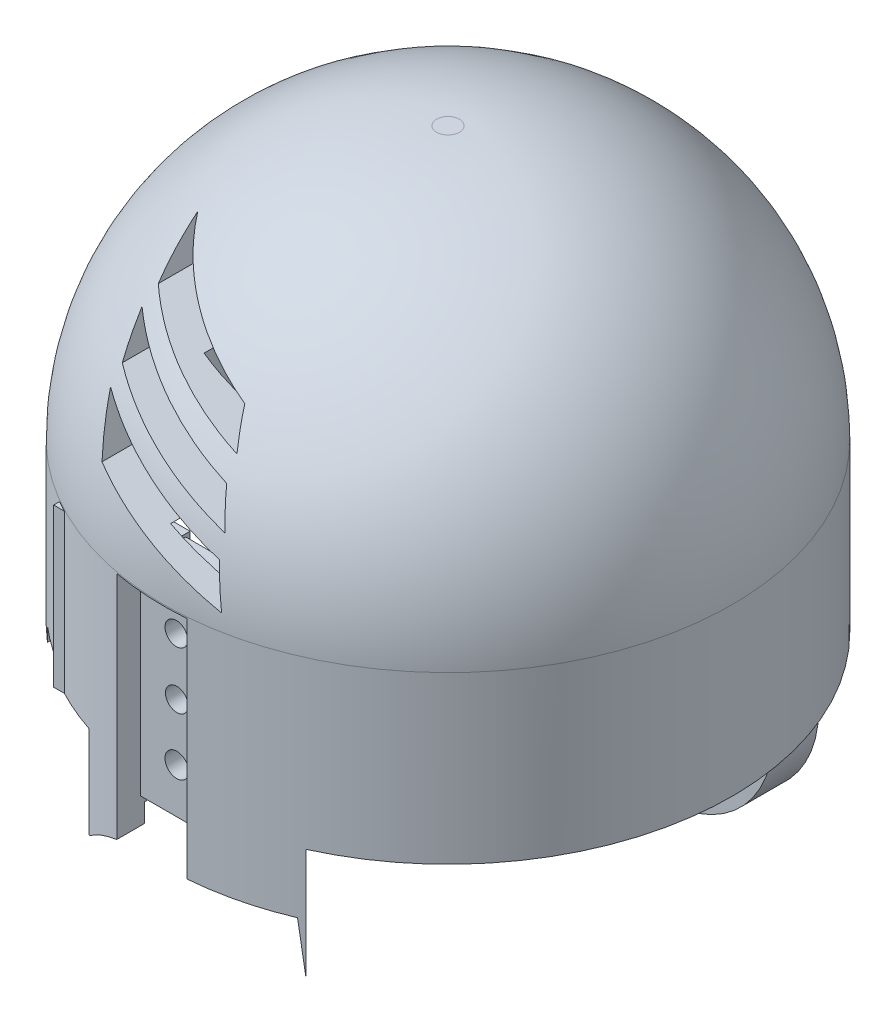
ISO-10303-21;
HEADER;
FILE_DESCRIPTION(('STEP AP214'),'2;1');
FILE_NAME('part.step','',(''),(''),'','','');
FILE_SCHEMA(('AUTOMOTIVE_DESIGN { 1 0 10303 214 1 1 1 1 }'));
ENDSEC;
DATA;
#1=APPLICATION_CONTEXT('core data for automotive mechanical design processes');
#2=APPLICATION_PROTOCOL_DEFINITION('international standard','automotive_design',2000,#1);
#3=PRODUCT_CONTEXT('',#1,'mechanical');
#4=PRODUCT('Part','Part','',(#3));
#5=PRODUCT_RELATED_PRODUCT_CATEGORY('part','',(#4));
#6=PRODUCT_DEFINITION_FORMATION('','',#4);
#7=PRODUCT_DEFINITION_CONTEXT('part definition',#1,'design');
#8=PRODUCT_DEFINITION('design','',#6,#7);
#9=PRODUCT_DEFINITION_SHAPE('','',#8);
#10=(LENGTH_UNIT() NAMED_UNIT(*) SI_UNIT(.MILLI.,.METRE.));
#11=(NAMED_UNIT(*) PLANE_ANGLE_UNIT() SI_UNIT($,.RADIAN.));
#12=(NAMED_UNIT(*) SI_UNIT($,.STERADIAN.) SOLID_ANGLE_UNIT());
#13=UNCERTAINTY_MEASURE_WITH_UNIT(LENGTH_MEASURE(1.E-05),#10,'distance_accuracy_value','');
#14=(GEOMETRIC_REPRESENTATION_CONTEXT(3) GLOBAL_UNCERTAINTY_ASSIGNED_CONTEXT((#13)) GLOBAL_UNIT_ASSIGNED_CONTEXT((#10,
#11,#12)) REPRESENTATION_CONTEXT('',''));
#15=CARTESIAN_POINT('',(0.,0.,0.));
#16=DIRECTION('',(0.,0.,1.));
#17=DIRECTION('',(1.,0.,0.));
#18=AXIS2_PLACEMENT_3D('',#15,#16,#17);
#19=CARTESIAN_POINT('',(0.,80.,0.));
#20=DIRECTION('',(0.,1.,0.));
#21=DIRECTION('',(0.,0.,1.));
#22=AXIS2_PLACEMENT_3D('',#19,#20,#21);
#23=PLANE('',#22);
#24=CARTESIAN_POINT('',(0.,80.,0.));
#25=DIRECTION('',(0.,1.,0.));
#26=DIRECTION('',(0.,0.,1.));
#27=AXIS2_PLACEMENT_3D('',#24,#25,#26);
#28=CIRCLE('',#27,11.3);
#29=CARTESIAN_POINT('',(2.10238121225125,80.,11.102702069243));
#30=VERTEX_POINT('',#29);
#31=CARTESIAN_POINT('',(2.10238121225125,80.,-11.102702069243));
#32=VERTEX_POINT('',#31);
#33=EDGE_CURVE('E1288',#30,#32,#28,.T.);
#34=ORIENTED_EDGE('',*,*,#33,.F.);
#35=DIRECTION('',(0.,0.,-1.));
#36=VECTOR('',#35,1.);
#37=CARTESIAN_POINT('',(2.10238121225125,80.,0.));
#38=LINE('',#37,#36);
#39=CARTESIAN_POINT('',(2.10238121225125,80.,10.20180391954));
#40=VERTEX_POINT('',#39);
#41=EDGE_CURVE('E1767',#30,#40,#38,.T.);
#42=ORIENTED_EDGE('',*,*,#41,.T.);
#43=CARTESIAN_POINT('',(0.,80.,0.));
#44=DIRECTION('',(0.,-1.,0.));
#45=DIRECTION('',(0.,0.,-1.));
#46=AXIS2_PLACEMENT_3D('',#43,#44,#45);
#47=CIRCLE('',#46,10.4161802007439);
#48=CARTESIAN_POINT('',(2.10238121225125,80.,-10.20180391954));
#49=VERTEX_POINT('',#48);
#50=EDGE_CURVE('E993',#49,#40,#47,.T.);
#51=ORIENTED_EDGE('',*,*,#50,.F.);
#52=EDGE_CURVE('E1768',#49,#32,#38,.T.);
#53=ORIENTED_EDGE('',*,*,#52,.T.);
#54=EDGE_LOOP('',(#34,#42,#51,#53));
#55=FACE_BOUND('',#54,.T.);
#56=ADVANCED_FACE('F57',(#55),#23,.F.);
#57=CARTESIAN_POINT('',(0.,78.8188016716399,0.));
#58=DIRECTION('',(0.,-1.,0.));
#59=DIRECTION('',(0.,0.,-1.));
#60=AXIS2_PLACEMENT_3D('',#57,#58,#59);
#61=PLANE('',#60);
#62=DIRECTION('',(-1.,0.,0.));
#63=VECTOR('',#62,1.);
#64=CARTESIAN_POINT('',(2.42638973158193,78.8188016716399,10.8772545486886));
#65=LINE('',#64,#63);
#66=CARTESIAN_POINT('',(2.42638973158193,78.8188016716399,10.8772545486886));
#67=VERTEX_POINT('',#66);
#68=CARTESIAN_POINT('',(2.2860069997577,78.8188016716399,10.8772545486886));
#69=VERTEX_POINT('',#68);
#70=EDGE_CURVE('E1001',#67,#69,#65,.T.);
#71=ORIENTED_EDGE('',*,*,#70,.T.);
#72=DIRECTION('',(0.,0.,1.));
#73=VECTOR('',#72,1.);
#74=CARTESIAN_POINT('',(2.2860069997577,78.8188016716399,0.));
#75=LINE('',#74,#73);
#76=CARTESIAN_POINT('',(2.2860069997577,78.8188016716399,11.0663531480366));
#77=VERTEX_POINT('',#76);
#78=EDGE_CURVE('E1762',#69,#77,#75,.T.);
#79=ORIENTED_EDGE('',*,*,#78,.T.);
#80=CARTESIAN_POINT('',(0.,78.8188016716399,0.));
#81=DIRECTION('',(0.,-1.,0.));
#82=DIRECTION('',(0.,0.,-1.));
#83=AXIS2_PLACEMENT_3D('',#80,#81,#82);
#84=CIRCLE('',#83,11.3);
#85=CARTESIAN_POINT('',(2.42638973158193,78.8188016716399,11.0364230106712));
#86=VERTEX_POINT('',#85);
#87=EDGE_CURVE('E1364',#86,#77,#84,.T.);
#88=ORIENTED_EDGE('',*,*,#87,.F.);
#89=DIRECTION('',(0.,0.,-1.));
#90=VECTOR('',#89,1.);
#91=CARTESIAN_POINT('',(2.42638973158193,78.8188016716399,10.8772545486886));
#92=LINE('',#91,#90);
#93=EDGE_CURVE('E997',#86,#67,#92,.T.);
#94=ORIENTED_EDGE('',*,*,#93,.T.);
#95=EDGE_LOOP('',(#71,#79,#88,#94));
#96=FACE_BOUND('',#95,.T.);
#97=ADVANCED_FACE('F1262',(#96),#61,.F.);
#98=CARTESIAN_POINT('',(0.,82.,0.));
#99=DIRECTION('',(0.,-1.,0.));
#100=DIRECTION('',(0.,0.,-1.));
#101=AXIS2_PLACEMENT_3D('',#98,#99,#100);
#102=CYLINDRICAL_SURFACE('',#101,10.4161802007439);
#103=CARTESIAN_POINT('',(0.,82.,0.));
#104=DIRECTION('',(0.,-1.,0.));
#105=DIRECTION('',(0.,0.,-1.));
#106=AXIS2_PLACEMENT_3D('',#103,#104,#105);
#107=CIRCLE('',#106,10.4161802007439);
#108=CARTESIAN_POINT('',(1.86004760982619,82.,-10.2487576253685));
#109=VERTEX_POINT('',#108);
#110=CARTESIAN_POINT('',(1.86004760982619,82.,10.2487576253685));
#111=VERTEX_POINT('',#110);
#112=EDGE_CURVE('E994',#109,#111,#107,.T.);
#113=ORIENTED_EDGE('',*,*,#112,.F.);
#114=CARTESIAN_POINT('',(0.,88.6910941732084,0.));
#115=DIRECTION('',(0.963465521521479,0.267832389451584,0.));
#116=DIRECTION('',(0.267832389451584,-0.963465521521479,0.));
#117=AXIS2_PLACEMENT_3D('',#114,#115,#116);
#118=ELLIPSE('',#117,38.89066674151,10.4161802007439);
#119=CARTESIAN_POINT('',(2.02488689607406,81.4070285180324,-10.2174675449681));
#120=VERTEX_POINT('',#119);
#121=EDGE_CURVE('E1460',#109,#120,#118,.F.);
#122=ORIENTED_EDGE('',*,*,#121,.T.);
#123=CARTESIAN_POINT('',(0.,82.2146203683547,0.));
#124=DIRECTION('',(-0.370456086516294,-0.928849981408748,0.));
#125=DIRECTION('',(0.928849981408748,-0.370456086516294,0.));
#126=AXIS2_PLACEMENT_3D('',#123,#124,#125);
#127=ELLIPSE('',#126,11.2140608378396,10.4161802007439);
#128=CARTESIAN_POINT('',(0.538120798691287,82.,-10.4022707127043));
#129=VERTEX_POINT('',#128);
#130=EDGE_CURVE('E878',#120,#129,#127,.F.);
#131=ORIENTED_EDGE('',*,*,#130,.T.);
#132=CARTESIAN_POINT('',(-1.64369599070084,82.,-10.2856732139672));
#133=VERTEX_POINT('',#132);
#134=EDGE_CURVE('E989',#133,#129,#107,.T.);
#135=ORIENTED_EDGE('',*,*,#134,.F.);
#136=CARTESIAN_POINT('',(0.,81.3272549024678,0.));
#137=DIRECTION('',(0.378789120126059,0.925483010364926,0.));
#138=DIRECTION('',(0.925483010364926,-0.378789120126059,0.));
#139=AXIS2_PLACEMENT_3D('',#136,#137,#138);
#140=ELLIPSE('',#139,11.2548583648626,10.4161802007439);
#141=CARTESIAN_POINT('',(2.02488689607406,80.4984929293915,-10.2174675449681));
#142=VERTEX_POINT('',#141);
#143=EDGE_CURVE('E1556',#133,#142,#140,.F.);
#144=ORIENTED_EDGE('',*,*,#143,.T.);
#145=CARTESIAN_POINT('',(0.,93.523858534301,0.));
#146=DIRECTION('',(0.9881312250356,0.153612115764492,0.));
#147=DIRECTION('',(0.153612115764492,-0.9881312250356,0.));
#148=AXIS2_PLACEMENT_3D('',#145,#146,#147);
#149=ELLIPSE('',#148,67.8083245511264,10.4161802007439);
#150=EDGE_CURVE('E62',#142,#49,#149,.F.);
#151=ORIENTED_EDGE('',*,*,#150,.T.);
#152=ORIENTED_EDGE('',*,*,#50,.T.);
#153=CARTESIAN_POINT('',(2.02488689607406,80.4984929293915,10.2174675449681));
#154=VERTEX_POINT('',#153);
#155=EDGE_CURVE('E14',#40,#154,#149,.F.);
#156=ORIENTED_EDGE('',*,*,#155,.T.);
#157=CARTESIAN_POINT('',(-1.64369599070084,82.,10.2856732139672));
#158=VERTEX_POINT('',#157);
#159=EDGE_CURVE('E1559',#154,#158,#140,.F.);
#160=ORIENTED_EDGE('',*,*,#159,.T.);
#161=CARTESIAN_POINT('',(0.538120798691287,82.,10.4022707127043));
#162=VERTEX_POINT('',#161);
#163=EDGE_CURVE('E1517',#162,#158,#107,.T.);
#164=ORIENTED_EDGE('',*,*,#163,.F.);
#165=CARTESIAN_POINT('',(2.02488689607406,81.4070285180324,10.2174675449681));
#166=VERTEX_POINT('',#165);
#167=EDGE_CURVE('E874',#162,#166,#127,.F.);
#168=ORIENTED_EDGE('',*,*,#167,.T.);
#169=EDGE_CURVE('E1532',#166,#111,#118,.F.);
#170=ORIENTED_EDGE('',*,*,#169,.T.);
#171=EDGE_LOOP('',(#113,#122,#131,#135,#144,#151,#152,#156,#160,#164,#168,#170));
#172=FACE_BOUND('',#171,.T.);
#173=ADVANCED_FACE('F1267',(#172),#102,.F.);
#174=CARTESIAN_POINT('',(0.,82.,0.));
#175=DIRECTION('',(0.,-1.,0.));
#176=DIRECTION('',(0.,0.,-1.));
#177=AXIS2_PLACEMENT_3D('',#174,#175,#176);
#178=PLANE('',#177);
#179=DIRECTION('',(0.,0.,1.));
#180=VECTOR('',#179,1.);
#181=CARTESIAN_POINT('',(1.86004760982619,82.,0.));
#182=LINE('',#181,#180);
#183=CARTESIAN_POINT('',(1.86004760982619,82.,-8.99977381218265));
#184=VERTEX_POINT('',#183);
#185=EDGE_CURVE('E1530',#109,#184,#182,.T.);
#186=ORIENTED_EDGE('',*,*,#185,.F.);
#187=ORIENTED_EDGE('',*,*,#112,.T.);
#188=CARTESIAN_POINT('',(1.86004760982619,82.,8.99977381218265));
#189=VERTEX_POINT('',#188);
#190=EDGE_CURVE('E1528',#189,#111,#182,.T.);
#191=ORIENTED_EDGE('',*,*,#190,.F.);
#192=CARTESIAN_POINT('',(0.,82.,0.));
#193=DIRECTION('',(0.,-1.,0.));
#194=DIRECTION('',(0.,0.,-1.));
#195=AXIS2_PLACEMENT_3D('',#192,#193,#194);
#196=CIRCLE('',#195,9.18997855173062);
#197=EDGE_CURVE('E973',#184,#189,#196,.T.);
#198=ORIENTED_EDGE('',*,*,#197,.F.);
#199=EDGE_LOOP('',(#186,#187,#191,#198));
#200=FACE_BOUND('',#199,.T.);
#201=ADVANCED_FACE('F1526',(#200),#178,.T.);
#202=DIRECTION('',(0.,0.,-1.));
#203=VECTOR('',#202,1.);
#204=CARTESIAN_POINT('',(0.538120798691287,82.,0.));
#205=LINE('',#204,#203);
#206=CARTESIAN_POINT('',(0.538120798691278,82.,9.17421014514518));
#207=VERTEX_POINT('',#206);
#208=EDGE_CURVE('E872',#162,#207,#205,.T.);
#209=ORIENTED_EDGE('',*,*,#208,.F.);
#210=ORIENTED_EDGE('',*,*,#163,.T.);
#211=DIRECTION('',(0.,0.,1.));
#212=VECTOR('',#211,1.);
#213=CARTESIAN_POINT('',(-1.64369599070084,82.,0.));
#214=LINE('',#213,#212);
#215=CARTESIAN_POINT('',(-1.64369599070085,82.,9.04179015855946));
#216=VERTEX_POINT('',#215);
#217=EDGE_CURVE('E1557',#216,#158,#214,.T.);
#218=ORIENTED_EDGE('',*,*,#217,.F.);
#219=EDGE_CURVE('E1577',#207,#216,#196,.T.);
#220=ORIENTED_EDGE('',*,*,#219,.F.);
#221=EDGE_LOOP('',(#209,#210,#218,#220));
#222=FACE_BOUND('',#221,.T.);
#223=ADVANCED_FACE('F2523',(#222),#178,.T.);
#224=DIRECTION('',(0.,0.,-1.));
#225=VECTOR('',#224,1.);
#226=CARTESIAN_POINT('',(-4.00398142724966,82.,0.));
#227=LINE('',#226,#225);
#228=CARTESIAN_POINT('',(-4.00398142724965,82.,9.61586931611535));
#229=VERTEX_POINT('',#228);
#230=CARTESIAN_POINT('',(-4.00398142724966,82.,8.27187031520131));
#231=VERTEX_POINT('',#230);
#232=EDGE_CURVE('E1516',#229,#231,#227,.T.);
#233=ORIENTED_EDGE('',*,*,#232,.F.);
#234=CARTESIAN_POINT('',(-4.00398142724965,82.,-9.61586931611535));
#235=VERTEX_POINT('',#234);
#236=EDGE_CURVE('E992',#229,#235,#107,.T.);
#237=ORIENTED_EDGE('',*,*,#236,.T.);
#238=CARTESIAN_POINT('',(-4.00398142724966,82.,-8.27187031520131));
#239=VERTEX_POINT('',#238);
#240=EDGE_CURVE('E1508',#239,#235,#227,.T.);
#241=ORIENTED_EDGE('',*,*,#240,.F.);
#242=EDGE_CURVE('E971',#231,#239,#196,.T.);
#243=ORIENTED_EDGE('',*,*,#242,.F.);
#244=EDGE_LOOP('',(#233,#237,#241,#243));
#245=FACE_BOUND('',#244,.T.);
#246=ADVANCED_FACE('F1513',(#245),#178,.T.);
#247=CARTESIAN_POINT('',(0.,85.,0.));
#248=DIRECTION('',(0.,-1.,0.));
#249=DIRECTION('',(0.,0.,-1.));
#250=AXIS2_PLACEMENT_3D('',#247,#248,#249);
#251=CYLINDRICAL_SURFACE('',#250,9.18997855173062);
#252=CARTESIAN_POINT('',(-1.64369599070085,82.,-9.04179015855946));
#253=VERTEX_POINT('',#252);
#254=CARTESIAN_POINT('',(0.538120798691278,82.,-9.17421014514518));
#255=VERTEX_POINT('',#254);
#256=EDGE_CURVE('E967',#253,#255,#196,.T.);
#257=ORIENTED_EDGE('',*,*,#256,.T.);
#258=CARTESIAN_POINT('',(0.,82.2146203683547,0.));
#259=DIRECTION('',(-0.370456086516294,-0.928849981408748,0.));
#260=DIRECTION('',(0.928849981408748,-0.370456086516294,0.));
#261=AXIS2_PLACEMENT_3D('',#258,#259,#260);
#262=ELLIPSE('',#261,9.89393199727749,9.18997855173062);
#263=CARTESIAN_POINT('',(-4.230653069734,83.9019447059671,-8.15826454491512));
#264=VERTEX_POINT('',#263);
#265=EDGE_CURVE('E1432',#255,#264,#262,.F.);
#266=ORIENTED_EDGE('',*,*,#265,.T.);
#267=CARTESIAN_POINT('',(0.,64.0997269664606,0.));
#268=DIRECTION('',(-0.977930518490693,-0.208930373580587,0.));
#269=DIRECTION('',(0.208930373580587,-0.977930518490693,0.));
#270=AXIS2_PLACEMENT_3D('',#267,#268,#269);
#271=ELLIPSE('',#270,43.9858427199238,9.18997855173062);
#272=CARTESIAN_POINT('',(-4.46524755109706,85.,-8.03226431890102));
#273=VERTEX_POINT('',#272);
#274=EDGE_CURVE('E1444',#264,#273,#271,.F.);
#275=ORIENTED_EDGE('',*,*,#274,.T.);
#276=CARTESIAN_POINT('',(0.,85.,0.));
#277=DIRECTION('',(0.,-1.,0.));
#278=DIRECTION('',(0.,0.,-1.));
#279=AXIS2_PLACEMENT_3D('',#276,#277,#278);
#280=CIRCLE('',#279,9.18997855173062);
#281=CARTESIAN_POINT('',(-4.46524755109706,85.,8.03226431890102));
#282=VERTEX_POINT('',#281);
#283=EDGE_CURVE('E1582',#282,#273,#280,.T.);
#284=ORIENTED_EDGE('',*,*,#283,.F.);
#285=CARTESIAN_POINT('',(-4.230653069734,83.9019447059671,8.15826454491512));
#286=VERTEX_POINT('',#285);
#287=EDGE_CURVE('E1545',#282,#286,#271,.F.);
#288=ORIENTED_EDGE('',*,*,#287,.T.);
#289=EDGE_CURVE('E1430',#286,#207,#262,.F.);
#290=ORIENTED_EDGE('',*,*,#289,.T.);
#291=ORIENTED_EDGE('',*,*,#219,.T.);
#292=CARTESIAN_POINT('',(0.,81.3272549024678,0.));
#293=DIRECTION('',(0.378789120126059,0.925483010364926,0.));
#294=DIRECTION('',(0.925483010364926,-0.378789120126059,0.));
#295=AXIS2_PLACEMENT_3D('',#292,#293,#294);
#296=ELLIPSE('',#295,9.92992680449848,9.18997855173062);
#297=CARTESIAN_POINT('',(-4.36343875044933,83.1131581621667,8.08802250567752));
#298=VERTEX_POINT('',#297);
#299=EDGE_CURVE('E1422',#216,#298,#296,.F.);
#300=ORIENTED_EDGE('',*,*,#299,.T.);
#301=CARTESIAN_POINT('',(0.,69.6005736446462,0.));
#302=DIRECTION('',(-0.951615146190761,-0.307292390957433,0.));
#303=DIRECTION('',(0.307292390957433,-0.951615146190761,0.));
#304=AXIS2_PLACEMENT_3D('',#301,#302,#303);
#305=ELLIPSE('',#304,29.9063003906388,9.18997855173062);
#306=EDGE_CURVE('E1425',#298,#231,#305,.F.);
#307=ORIENTED_EDGE('',*,*,#306,.T.);
#308=ORIENTED_EDGE('',*,*,#242,.T.);
#309=CARTESIAN_POINT('',(-4.36343875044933,83.1131581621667,-8.08802250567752));
#310=VERTEX_POINT('',#309);
#311=EDGE_CURVE('E1421',#239,#310,#305,.F.);
#312=ORIENTED_EDGE('',*,*,#311,.T.);
#313=EDGE_CURVE('E1418',#310,#253,#296,.F.);
#314=ORIENTED_EDGE('',*,*,#313,.T.);
#315=EDGE_LOOP('',(#257,#266,#275,#284,#288,#290,#291,#300,#307,#308,#312,#314));
#316=FACE_BOUND('',#315,.T.);
#317=ADVANCED_FACE('F1442',(#316),#251,.F.);
#318=CARTESIAN_POINT('',(0.,85.,0.));
#319=DIRECTION('',(0.,-1.,0.));
#320=DIRECTION('',(0.,0.,-1.));
#321=AXIS2_PLACEMENT_3D('',#318,#319,#320);
#322=PLANE('',#321);
#323=DIRECTION('',(0.,0.,-1.));
#324=VECTOR('',#323,1.);
#325=CARTESIAN_POINT('',(-4.46524755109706,85.,0.));
#326=LINE('',#325,#324);
#327=CARTESIAN_POINT('',(-4.46524755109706,85.,4.61164154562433));
#328=VERTEX_POINT('',#327);
#329=EDGE_CURVE('E1605',#282,#328,#326,.T.);
#330=ORIENTED_EDGE('',*,*,#329,.F.);
#331=ORIENTED_EDGE('',*,*,#283,.T.);
#332=CARTESIAN_POINT('',(-4.46524755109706,85.,-4.61164154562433));
#333=VERTEX_POINT('',#332);
#334=EDGE_CURVE('E1543',#333,#273,#326,.T.);
#335=ORIENTED_EDGE('',*,*,#334,.F.);
#336=CARTESIAN_POINT('',(0.,85.,0.));
#337=DIRECTION('',(0.,-1.,0.));
#338=DIRECTION('',(0.,0.,-1.));
#339=AXIS2_PLACEMENT_3D('',#336,#337,#338);
#340=CIRCLE('',#339,6.41916454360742);
#341=EDGE_CURVE('E1602',#328,#333,#340,.T.);
#342=ORIENTED_EDGE('',*,*,#341,.F.);
#343=EDGE_LOOP('',(#330,#331,#335,#342));
#344=FACE_BOUND('',#343,.T.);
#345=ADVANCED_FACE('F1604',(#344),#322,.T.);
#346=DIRECTION('',(0.,0.,1.));
#347=VECTOR('',#346,1.);
#348=CARTESIAN_POINT('',(-3.74811919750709,85.,0.));
#349=LINE('',#348,#347);
#350=CARTESIAN_POINT('',(-3.74811919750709,85.,-8.39090628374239));
#351=VERTEX_POINT('',#350);
#352=CARTESIAN_POINT('',(-3.7481191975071,85.,-5.21126433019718));
#353=VERTEX_POINT('',#352);
#354=EDGE_CURVE('E757',#351,#353,#349,.T.);
#355=ORIENTED_EDGE('',*,*,#354,.F.);
#356=CARTESIAN_POINT('',(-1.70115253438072,85.,-9.03115639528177));
#357=VERTEX_POINT('',#356);
#358=EDGE_CURVE('E987',#351,#357,#280,.T.);
#359=ORIENTED_EDGE('',*,*,#358,.T.);
#360=DIRECTION('',(0.,0.,-1.));
#361=VECTOR('',#360,1.);
#362=CARTESIAN_POINT('',(-1.70115253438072,85.,0.));
#363=LINE('',#362,#361);
#364=CARTESIAN_POINT('',(-1.70115253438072,85.,-6.18964889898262));
#365=VERTEX_POINT('',#364);
#366=EDGE_CURVE('E907',#365,#357,#363,.T.);
#367=ORIENTED_EDGE('',*,*,#366,.F.);
#368=EDGE_CURVE('E983',#353,#365,#340,.T.);
#369=ORIENTED_EDGE('',*,*,#368,.F.);
#370=EDGE_LOOP('',(#355,#359,#367,#369));
#371=FACE_BOUND('',#370,.T.);
#372=ADVANCED_FACE('F2502',(#371),#322,.T.);
#373=DIRECTION('',(0.,0.,1.));
#374=VECTOR('',#373,1.);
#375=CARTESIAN_POINT('',(1.21018336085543,85.,0.));
#376=LINE('',#375,#374);
#377=CARTESIAN_POINT('',(1.21018336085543,85.,-9.10994851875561));
#378=VERTEX_POINT('',#377);
#379=CARTESIAN_POINT('',(1.21018336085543,85.,-6.30405660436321));
#380=VERTEX_POINT('',#379);
#381=EDGE_CURVE('E923',#378,#380,#376,.T.);
#382=ORIENTED_EDGE('',*,*,#381,.F.);
#383=CARTESIAN_POINT('',(1.21018336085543,85.,9.10994851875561));
#384=VERTEX_POINT('',#383);
#385=EDGE_CURVE('E984',#378,#384,#280,.T.);
#386=ORIENTED_EDGE('',*,*,#385,.T.);
#387=CARTESIAN_POINT('',(1.21018336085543,85.,6.30405660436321));
#388=VERTEX_POINT('',#387);
#389=EDGE_CURVE('E925',#388,#384,#376,.T.);
#390=ORIENTED_EDGE('',*,*,#389,.F.);
#391=EDGE_CURVE('E975',#380,#388,#340,.T.);
#392=ORIENTED_EDGE('',*,*,#391,.F.);
#393=EDGE_LOOP('',(#382,#386,#390,#392));
#394=FACE_BOUND('',#393,.T.);
#395=ADVANCED_FACE('F2488',(#394),#322,.T.);
#396=CARTESIAN_POINT('',(0.,87.,0.));
#397=DIRECTION('',(0.,-1.,0.));
#398=DIRECTION('',(0.,0.,-1.));
#399=AXIS2_PLACEMENT_3D('',#396,#397,#398);
#400=CYLINDRICAL_SURFACE('',#399,6.41916454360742);
#401=CARTESIAN_POINT('',(0.,88.649567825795,0.));
#402=DIRECTION('',(0.949176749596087,0.31474354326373,0.));
#403=DIRECTION('',(0.31474354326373,-0.949176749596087,0.));
#404=AXIS2_PLACEMENT_3D('',#401,#402,#403);
#405=ELLIPSE('',#404,20.3949046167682,6.41916454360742);
#406=CARTESIAN_POINT('',(1.18729088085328,85.0690371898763,6.30840818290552));
#407=VERTEX_POINT('',#406);
#408=EDGE_CURVE('E1409',#388,#407,#405,.F.);
#409=ORIENTED_EDGE('',*,*,#408,.T.);
#410=CARTESIAN_POINT('',(0.,85.5505957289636,0.));
#411=DIRECTION('',(0.375855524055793,0.926678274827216,0.));
#412=DIRECTION('',(0.926678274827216,-0.375855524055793,0.));
#413=AXIS2_PLACEMENT_3D('',#410,#411,#412);
#414=ELLIPSE('',#413,6.92706920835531,6.41916454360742);
#415=CARTESIAN_POINT('',(-3.57353121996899,87.,5.33249923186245));
#416=VERTEX_POINT('',#415);
#417=EDGE_CURVE('E716',#407,#416,#414,.F.);
#418=ORIENTED_EDGE('',*,*,#417,.T.);
#419=CARTESIAN_POINT('',(0.,87.,0.));
#420=DIRECTION('',(0.,-1.,0.));
#421=DIRECTION('',(0.,0.,-1.));
#422=AXIS2_PLACEMENT_3D('',#419,#420,#421);
#423=CIRCLE('',#422,6.41916454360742);
#424=CARTESIAN_POINT('',(-3.57353121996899,87.,-5.33249923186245));
#425=VERTEX_POINT('',#424);
#426=EDGE_CURVE('E968',#425,#416,#423,.T.);
#427=ORIENTED_EDGE('',*,*,#426,.F.);
#428=CARTESIAN_POINT('',(1.18729088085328,85.0690371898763,-6.30840818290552));
#429=VERTEX_POINT('',#428);
#430=EDGE_CURVE('E720',#425,#429,#414,.F.);
#431=ORIENTED_EDGE('',*,*,#430,.T.);
#432=EDGE_CURVE('E1406',#429,#380,#405,.F.);
#433=ORIENTED_EDGE('',*,*,#432,.T.);
#434=ORIENTED_EDGE('',*,*,#391,.T.);
#435=EDGE_LOOP('',(#409,#418,#427,#431,#433,#434));
#436=FACE_BOUND('',#435,.T.);
#437=ADVANCED_FACE('F2490',(#436),#400,.F.);
#438=CARTESIAN_POINT('',(0.,87.,0.));
#439=DIRECTION('',(0.,-1.,0.));
#440=DIRECTION('',(0.,0.,-1.));
#441=AXIS2_PLACEMENT_3D('',#438,#439,#440);
#442=PLANE('',#441);
#443=DIRECTION('',(0.,0.,-1.));
#444=VECTOR('',#443,1.);
#445=CARTESIAN_POINT('',(-4.6322547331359,87.,0.));
#446=LINE('',#445,#444);
#447=CARTESIAN_POINT('',(-4.6322547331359,87.,4.44385975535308));
#448=VERTEX_POINT('',#447);
#449=CARTESIAN_POINT('',(-4.6322547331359,87.,-4.44385975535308));
#450=VERTEX_POINT('',#449);
#451=EDGE_CURVE('E966',#448,#450,#446,.T.);
#452=ORIENTED_EDGE('',*,*,#451,.F.);
#453=EDGE_CURVE('E960',#448,#450,#423,.T.);
#454=ORIENTED_EDGE('',*,*,#453,.T.);
#455=EDGE_LOOP('',(#452,#454));
#456=FACE_BOUND('',#455,.T.);
#457=ADVANCED_FACE('F965',(#456),#442,.T.);
#458=CARTESIAN_POINT('',(-2.28009117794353,67.6445963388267,13.));
#459=DIRECTION('',(1.,0.,0.));
#460=DIRECTION('',(0.,0.,-1.));
#461=AXIS2_PLACEMENT_3D('',#458,#459,#460);
#462=PLANE('',#461);
#463=DIRECTION('',(0.,-1.,0.));
#464=VECTOR('',#463,1.);
#465=CARTESIAN_POINT('',(-2.28009117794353,67.6445963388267,10.6613553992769));
#466=LINE('',#465,#464);
#467=CARTESIAN_POINT('',(-2.28009117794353,68.9580858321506,10.6613553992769));
#468=VERTEX_POINT('',#467);
#469=CARTESIAN_POINT('',(-2.28009117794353,68.6377560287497,10.6613553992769));
#470=VERTEX_POINT('',#469);
#471=EDGE_CURVE('E1715',#468,#470,#466,.T.);
#472=ORIENTED_EDGE('',*,*,#471,.F.);
#473=DIRECTION('',(0.,0.,-1.));
#474=VECTOR('',#473,1.);
#475=CARTESIAN_POINT('',(-2.28009117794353,68.9580858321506,13.));
#476=LINE('',#475,#474);
#477=CARTESIAN_POINT('',(-2.28009117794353,68.9580858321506,11.2575511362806));
#478=VERTEX_POINT('',#477);
#479=EDGE_CURVE('E1325',#478,#468,#476,.T.);
#480=ORIENTED_EDGE('',*,*,#479,.F.);
#481=DIRECTION('',(0.,1.,0.));
#482=VECTOR('',#481,1.);
#483=CARTESIAN_POINT('',(-2.28009117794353,67.6445963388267,11.2575511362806));
#484=LINE('',#483,#482);
#485=CARTESIAN_POINT('',(-2.28009117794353,77.8188016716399,11.2575511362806));
#486=VERTEX_POINT('',#485);
#487=EDGE_CURVE('E1331',#478,#486,#484,.T.);
#488=ORIENTED_EDGE('',*,*,#487,.T.);
#489=DIRECTION('',(0.,0.,-1.));
#490=VECTOR('',#489,1.);
#491=CARTESIAN_POINT('',(-2.28009117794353,77.8188016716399,13.));
#492=LINE('',#491,#490);
#493=CARTESIAN_POINT('',(-2.28009117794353,77.8188016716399,11.5604811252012));
#494=VERTEX_POINT('',#493);
#495=EDGE_CURVE('E1361',#494,#486,#492,.T.);
#496=ORIENTED_EDGE('',*,*,#495,.F.);
#497=DIRECTION('',(0.,1.,0.));
#498=VECTOR('',#497,1.);
#499=CARTESIAN_POINT('',(-2.28009117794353,67.6445963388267,11.5604811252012));
#500=LINE('',#499,#498);
#501=CARTESIAN_POINT('',(-2.28009117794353,77.9434315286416,11.5604811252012));
#502=VERTEX_POINT('',#501);
#503=EDGE_CURVE('E1028',#494,#502,#500,.T.);
#504=ORIENTED_EDGE('',*,*,#503,.T.);
#505=DIRECTION('',(0.,0.,-1.));
#506=VECTOR('',#505,1.);
#507=CARTESIAN_POINT('',(-2.28009117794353,77.9434315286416,13.));
#508=LINE('',#507,#506);
#509=CARTESIAN_POINT('',(-2.28009117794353,77.9434315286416,12.2902882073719));
#510=VERTEX_POINT('',#509);
#511=EDGE_CURVE('E1823',#510,#502,#508,.T.);
#512=ORIENTED_EDGE('',*,*,#511,.F.);
#513=DIRECTION('',(0.,-1.,0.));
#514=VECTOR('',#513,1.);
#515=CARTESIAN_POINT('',(-2.28009117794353,90.,12.2902882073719));
#516=LINE('',#515,#514);
#517=CARTESIAN_POINT('',(-2.28009117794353,67.8097569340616,12.2902882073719));
#518=VERTEX_POINT('',#517);
#519=EDGE_CURVE('E1829',#510,#518,#516,.T.);
#520=ORIENTED_EDGE('',*,*,#519,.T.);
#521=DIRECTION('',(0.,0.,-1.));
#522=VECTOR('',#521,1.);
#523=CARTESIAN_POINT('',(-2.28009117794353,67.8097569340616,23.));
#524=LINE('',#523,#522);
#525=CARTESIAN_POINT('',(-2.28009117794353,67.8097569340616,11.0675735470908));
#526=VERTEX_POINT('',#525);
#527=EDGE_CURVE('E1305',#526,#518,#524,.F.);
#528=ORIENTED_EDGE('',*,*,#527,.F.);
#529=DIRECTION('',(0.,-1.,0.));
#530=VECTOR('',#529,1.);
#531=CARTESIAN_POINT('',(-2.28009117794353,90.,11.0675735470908));
#532=LINE('',#531,#530);
#533=CARTESIAN_POINT('',(-2.28009117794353,68.6377560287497,11.0675735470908));
#534=VERTEX_POINT('',#533);
#535=EDGE_CURVE('E1831',#534,#526,#532,.T.);
#536=ORIENTED_EDGE('',*,*,#535,.F.);
#537=DIRECTION('',(0.,0.,-1.));
#538=VECTOR('',#537,1.);
#539=CARTESIAN_POINT('',(-2.28009117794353,68.6377560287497,11.0675735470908));
#540=LINE('',#539,#538);
#541=EDGE_CURVE('E1801',#534,#470,#540,.T.);
#542=ORIENTED_EDGE('',*,*,#541,.T.);
#543=EDGE_LOOP('',(#472,#480,#488,#496,#504,#512,#520,#528,#536,#542));
#544=FACE_BOUND('',#543,.T.);
#545=ADVANCED_FACE('F1190',(#544),#462,.T.);
#546=CARTESIAN_POINT('',(0.,71.,0.));
#547=DIRECTION('',(0.,1.,0.));
#548=DIRECTION('',(0.,0.,1.));
#549=AXIS2_PLACEMENT_3D('',#546,#547,#548);
#550=PLANE('',#549);
#551=CARTESIAN_POINT('',(0.,71.,0.));
#552=DIRECTION('',(0.,1.,0.));
#553=DIRECTION('',(0.,0.,1.));
#554=AXIS2_PLACEMENT_3D('',#551,#552,#553);
#555=CIRCLE('',#554,11.3);
#556=CARTESIAN_POINT('',(-5.11998592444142,71.,-10.0735169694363));
#557=VERTEX_POINT('',#556);
#558=CARTESIAN_POINT('',(-8.03916516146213,71.,7.94114749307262));
#559=VERTEX_POINT('',#558);
#560=EDGE_CURVE('E1655',#557,#559,#555,.T.);
#561=ORIENTED_EDGE('',*,*,#560,.T.);
#562=DIRECTION('',(-1.,0.,0.));
#563=VECTOR('',#562,1.);
#564=CARTESIAN_POINT('',(0.,71.,7.94114749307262));
#565=LINE('',#564,#563);
#566=CARTESIAN_POINT('',(-8.12276292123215,71.,7.94114749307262));
#567=VERTEX_POINT('',#566);
#568=EDGE_CURVE('E1394',#559,#567,#565,.T.);
#569=ORIENTED_EDGE('',*,*,#568,.T.);
#570=DIRECTION('',(0.,0.,1.));
#571=VECTOR('',#570,1.);
#572=CARTESIAN_POINT('',(-8.12276292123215,71.,0.));
#573=LINE('',#572,#571);
#574=CARTESIAN_POINT('',(-8.12276292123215,71.,9.50109059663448));
#575=VERTEX_POINT('',#574);
#576=EDGE_CURVE('E1391',#567,#575,#573,.T.);
#577=ORIENTED_EDGE('',*,*,#576,.T.);
#578=CARTESIAN_POINT('',(0.,71.,0.));
#579=DIRECTION('',(0.,1.,0.));
#580=DIRECTION('',(0.,0.,1.));
#581=AXIS2_PLACEMENT_3D('',#578,#579,#580);
#582=CIRCLE('',#581,12.5);
#583=CARTESIAN_POINT('',(-5.76087206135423,71.,-11.0933472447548));
#584=VERTEX_POINT('',#583);
#585=EDGE_CURVE('E1667',#584,#575,#582,.T.);
#586=ORIENTED_EDGE('',*,*,#585,.F.);
#587=DIRECTION('',(-0.532082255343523,0.,-0.846692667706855));
#588=VECTOR('',#587,1.);
#589=CARTESIAN_POINT('',(-4.83722916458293,71.,-9.62357135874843));
#590=LINE('',#589,#588);
#591=EDGE_CURVE('E1694',#557,#584,#590,.T.);
#592=ORIENTED_EDGE('',*,*,#591,.F.);
#593=EDGE_LOOP('',(#561,#569,#577,#586,#592));
#594=FACE_BOUND('',#593,.T.);
#595=ADVANCED_FACE('F2000',(#594),#550,.F.);
#596=CARTESIAN_POINT('',(0.,90.,0.));
#597=DIRECTION('',(0.,-1.,0.));
#598=DIRECTION('',(0.,0.,-1.));
#599=AXIS2_PLACEMENT_3D('',#596,#597,#598);
#600=CYLINDRICAL_SURFACE('',#599,11.3);
#601=CARTESIAN_POINT('',(-0.894103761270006,68.0187616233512,11.2645718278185));
#602=CARTESIAN_POINT('',(-1.02316762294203,68.0187796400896,11.2543482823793));
#603=CARTESIAN_POINT('',(-1.15203205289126,68.0134460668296,11.2418677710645));
#604=CARTESIAN_POINT('',(-1.40835396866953,67.9923075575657,11.2126289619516));
#605=CARTESIAN_POINT('',(-1.53581205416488,67.9765072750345,11.195872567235));
#606=CARTESIAN_POINT('',(-1.78787192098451,67.9347591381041,11.1583915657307));
#607=CARTESIAN_POINT('',(-1.91248382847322,67.9088563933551,11.1376848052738));
#608=CARTESIAN_POINT('',(-2.15856067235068,67.8472553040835,11.0926232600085));
#609=CARTESIAN_POINT('',(-2.28002535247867,67.8115561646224,11.0682681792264));
#610=CARTESIAN_POINT('',(-2.63816077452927,67.6904419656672,10.9904277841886));
#611=CARTESIAN_POINT('',(-2.86917186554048,67.5909087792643,10.9320756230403));
#612=CARTESIAN_POINT('',(-3.31077191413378,67.3576103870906,10.8065603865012));
#613=CARTESIAN_POINT('',(-3.52133005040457,67.2237945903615,10.7393843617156));
#614=CARTESIAN_POINT('',(-3.92999086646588,66.9163529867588,10.596922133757));
#615=CARTESIAN_POINT('',(-4.12656333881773,66.7408047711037,10.521391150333));
#616=CARTESIAN_POINT('',(-4.48788486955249,66.3591048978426,10.3724185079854));
#617=CARTESIAN_POINT('',(-4.6526723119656,66.1529906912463,10.2989744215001));
#618=CARTESIAN_POINT('',(-4.89658644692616,65.788691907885,10.1845464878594));
#619=CARTESIAN_POINT('',(-4.98580326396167,65.6379858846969,10.1410064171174));
#620=CARTESIAN_POINT('',(-5.14738752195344,65.3263438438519,10.0599451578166));
#621=CARTESIAN_POINT('',(-5.21975910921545,65.1654103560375,10.0224224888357));
#622=CARTESIAN_POINT('',(-5.28311703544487,65.,9.98892758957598));
#623=B_SPLINE_CURVE_WITH_KNOTS('',3,(#601,#602,#603,#604,#605,#606,#607,#608,#609,#610,#611,
#612,#613,#614,#615,#616,#617,#618,#619,#620,#621,#622),.UNSPECIFIED.,.F.,.F.,(4,2,2,2,2,2,2,2,
2,2,4),(0.,0.388242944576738,0.776313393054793,1.16267050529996,1.54905897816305,
2.32001577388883,3.09211689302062,3.9110512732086,4.72899041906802,5.2692935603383,
5.80946356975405),.UNSPECIFIED.);
#624=CARTESIAN_POINT('',(-3.20239216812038,67.4128799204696,10.8367284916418));
#625=VERTEX_POINT('',#624);
#626=EDGE_CURVE('E1240',#526,#625,#623,.T.);
#627=ORIENTED_EDGE('',*,*,#626,.T.);
#628=DIRECTION('',(0.,-1.,0.));
#629=VECTOR('',#628,1.);
#630=CARTESIAN_POINT('',(-3.20239216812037,90.,10.8367284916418));
#631=LINE('',#630,#629);
#632=CARTESIAN_POINT('',(-3.20239216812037,68.6377560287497,10.8367284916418));
#633=VERTEX_POINT('',#632);
#634=EDGE_CURVE('E1678',#625,#633,#631,.F.);
#635=ORIENTED_EDGE('',*,*,#634,.T.);
#636=CARTESIAN_POINT('',(0.,68.6377560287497,0.));
#637=DIRECTION('',(0.,-1.,0.));
#638=DIRECTION('',(0.,0.,-1.));
#639=AXIS2_PLACEMENT_3D('',#636,#637,#638);
#640=CIRCLE('',#639,11.3);
#641=EDGE_CURVE('E1817',#534,#633,#640,.T.);
#642=ORIENTED_EDGE('',*,*,#641,.F.);
#643=ORIENTED_EDGE('',*,*,#535,.T.);
#644=EDGE_LOOP('',(#627,#635,#642,#643));
#645=FACE_BOUND('',#644,.T.);
#646=ADVANCED_FACE('F1111',(#645),#600,.F.);
#647=CARTESIAN_POINT('',(0.,93.523858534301,0.));
#648=DIRECTION('',(0.9881312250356,0.153612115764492,0.));
#649=DIRECTION('',(0.153612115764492,-0.9881312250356,0.));
#650=AXIS2_PLACEMENT_3D('',#647,#648,#649);
#651=ELLIPSE('',#650,73.5619058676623,11.3);
#652=EDGE_CURVE('E1765',#30,#77,#651,.T.);
#653=ORIENTED_EDGE('',*,*,#652,.F.);
#654=ORIENTED_EDGE('',*,*,#33,.T.);
#655=CARTESIAN_POINT('',(2.30168433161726,78.7179550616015,-11.0631030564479));
#656=VERTEX_POINT('',#655);
#657=EDGE_CURVE('E1766',#656,#32,#651,.T.);
#658=ORIENTED_EDGE('',*,*,#657,.F.);
#659=CARTESIAN_POINT('',(0.,79.627377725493,0.));
#660=DIRECTION('',(-0.36746823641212,-0.930036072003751,0.));
#661=DIRECTION('',(0.930036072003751,-0.36746823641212,0.));
#662=AXIS2_PLACEMENT_3D('',#659,#660,#661);
#663=ELLIPSE('',#662,12.1500663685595,11.3);
#664=CARTESIAN_POINT('',(-0.943080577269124,80.,-11.2605772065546));
#665=VERTEX_POINT('',#664);
#666=EDGE_CURVE('E820',#665,#656,#663,.T.);
#667=ORIENTED_EDGE('',*,*,#666,.F.);
#668=CARTESIAN_POINT('',(-0.943080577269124,80.,11.2605772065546));
#669=VERTEX_POINT('',#668);
#670=EDGE_CURVE('E1283',#665,#669,#28,.T.);
#671=ORIENTED_EDGE('',*,*,#670,.T.);
#672=CARTESIAN_POINT('',(2.04644870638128,78.8188016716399,11.11314751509));
#673=VERTEX_POINT('',#672);
#674=EDGE_CURVE('E816',#673,#669,#663,.T.);
#675=ORIENTED_EDGE('',*,*,#674,.F.);
#676=CARTESIAN_POINT('',(-2.45638071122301,78.8188016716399,11.0297866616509));
#677=VERTEX_POINT('',#676);
#678=EDGE_CURVE('E1363',#673,#677,#84,.T.);
#679=ORIENTED_EDGE('',*,*,#678,.T.);
#680=DIRECTION('',(0.,-1.,0.));
#681=VECTOR('',#680,1.);
#682=CARTESIAN_POINT('',(-2.45638071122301,90.,11.0297866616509));
#683=LINE('',#682,#681);
#684=CARTESIAN_POINT('',(-2.45638071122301,77.9434315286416,11.0297866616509));
#685=VERTEX_POINT('',#684);
#686=EDGE_CURVE('E1025',#677,#685,#683,.T.);
#687=ORIENTED_EDGE('',*,*,#686,.T.);
#688=CARTESIAN_POINT('',(0.,77.9434315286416,0.));
#689=DIRECTION('',(0.,1.,0.));
#690=DIRECTION('',(0.,0.,1.));
#691=AXIS2_PLACEMENT_3D('',#688,#689,#690);
#692=CIRCLE('',#691,11.3);
#693=CARTESIAN_POINT('',(-6.28009117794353,77.9434315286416,9.3941713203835));
#694=VERTEX_POINT('',#693);
#695=EDGE_CURVE('E1820',#694,#685,#692,.T.);
#696=ORIENTED_EDGE('',*,*,#695,.F.);
#697=DIRECTION('',(0.,-1.,0.));
#698=VECTOR('',#697,1.);
#699=CARTESIAN_POINT('',(-6.28009117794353,90.,9.3941713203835));
#700=LINE('',#699,#698);
#701=CARTESIAN_POINT('',(-6.28009117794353,71.6377560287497,9.3941713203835));
#702=VERTEX_POINT('',#701);
#703=EDGE_CURVE('E1814',#694,#702,#700,.T.);
#704=ORIENTED_EDGE('',*,*,#703,.T.);
#705=CARTESIAN_POINT('',(0.,71.6377560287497,0.));
#706=DIRECTION('',(0.,1.,0.));
#707=DIRECTION('',(0.,0.,1.));
#708=AXIS2_PLACEMENT_3D('',#705,#706,#707);
#709=CIRCLE('',#708,11.3);
#710=CARTESIAN_POINT('',(-8.03916516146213,71.6377560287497,7.94114749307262));
#711=VERTEX_POINT('',#710);
#712=EDGE_CURVE('E1704',#711,#702,#709,.T.);
#713=ORIENTED_EDGE('',*,*,#712,.F.);
#714=DIRECTION('',(0.,-1.,0.));
#715=VECTOR('',#714,1.);
#716=CARTESIAN_POINT('',(-8.03916516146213,90.,7.94114749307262));
#717=LINE('',#716,#715);
#718=EDGE_CURVE('E1710',#559,#711,#717,.F.);
#719=ORIENTED_EDGE('',*,*,#718,.F.);
#720=ORIENTED_EDGE('',*,*,#560,.F.);
#721=DIRECTION('',(0.,-1.,0.));
#722=VECTOR('',#721,1.);
#723=CARTESIAN_POINT('',(-5.11998592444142,90.,-10.0735169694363));
#724=LINE('',#723,#722);
#725=CARTESIAN_POINT('',(-5.11998592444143,68.76588244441,-10.0735169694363));
#726=VERTEX_POINT('',#725);
#727=EDGE_CURVE('E1686',#557,#726,#724,.T.);
#728=ORIENTED_EDGE('',*,*,#727,.T.);
#729=CARTESIAN_POINT('',(0.,68.76588244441,0.));
#730=DIRECTION('',(0.,1.,0.));
#731=DIRECTION('',(0.,0.,1.));
#732=AXIS2_PLACEMENT_3D('',#729,#730,#731);
#733=CIRCLE('',#732,11.3);
#734=CARTESIAN_POINT('',(-4.5,68.76588244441,-10.3653268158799));
#735=VERTEX_POINT('',#734);
#736=EDGE_CURVE('E1044',#735,#726,#733,.T.);
#737=ORIENTED_EDGE('',*,*,#736,.F.);
#738=DIRECTION('',(0.,-1.,0.));
#739=VECTOR('',#738,1.);
#740=CARTESIAN_POINT('',(-4.5,90.,-10.3653268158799));
#741=LINE('',#740,#739);
#742=CARTESIAN_POINT('',(-4.5,66.8866092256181,-10.3653268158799));
#743=VERTEX_POINT('',#742);
#744=EDGE_CURVE('E1041',#735,#743,#741,.T.);
#745=ORIENTED_EDGE('',*,*,#744,.T.);
#746=CARTESIAN_POINT('',(-5.26212884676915,62.4606940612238,-10.));
#747=CARTESIAN_POINT('',(-5.22002130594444,62.3271970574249,-10.0221462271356));
#748=CARTESIAN_POINT('',(-5.1723512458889,62.1960029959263,-10.0469027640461));
#749=CARTESIAN_POINT('',(-5.06642265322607,61.9389832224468,-10.1007400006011));
#750=CARTESIAN_POINT('',(-5.00817132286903,61.8131539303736,-10.1298177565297));
#751=CARTESIAN_POINT('',(-4.81865938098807,61.4453789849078,-10.2220428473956));
#752=CARTESIAN_POINT('',(-4.67236319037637,61.2122787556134,-10.2903358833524));
#753=CARTESIAN_POINT('',(-4.34467605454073,60.775529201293,-10.4329120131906));
#754=CARTESIAN_POINT('',(-4.16336157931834,60.5718173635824,-10.5071818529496));
#755=CARTESIAN_POINT('',(-3.7690351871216,60.1967608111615,-10.6549796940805));
#756=CARTESIAN_POINT('',(-3.55599624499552,60.0254439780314,-10.7285070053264));
#757=CARTESIAN_POINT('',(-3.21103014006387,59.7926891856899,-10.834886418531));
#758=CARTESIAN_POINT('',(-3.0888049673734,59.7177834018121,-10.870430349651));
#759=CARTESIAN_POINT('',(-2.83766543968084,59.5786919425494,-10.9386720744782));
#760=CARTESIAN_POINT('',(-2.70875399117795,59.5145016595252,-10.9713710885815));
#761=CARTESIAN_POINT('',(-2.44505720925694,59.3974628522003,-11.03313368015));
#762=CARTESIAN_POINT('',(-2.3102722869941,59.344613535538,-11.062197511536));
#763=CARTESIAN_POINT('',(-2.03583220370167,59.2508710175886,-11.1159758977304));
#764=CARTESIAN_POINT('',(-1.89617963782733,59.2099715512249,-11.1406927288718));
#765=CARTESIAN_POINT('',(-1.62130235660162,59.1426582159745,-11.1838988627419));
#766=CARTESIAN_POINT('',(-1.48629411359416,59.1155388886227,-11.202667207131));
#767=CARTESIAN_POINT('',(-1.2139652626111,59.0727276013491,-11.2354387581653));
#768=CARTESIAN_POINT('',(-1.07664577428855,59.0570302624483,-11.2494442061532));
#769=CARTESIAN_POINT('',(-0.80077909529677,59.0372998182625,-11.2724401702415));
#770=CARTESIAN_POINT('',(-0.662232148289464,59.0332644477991,-11.281431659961));
#771=CARTESIAN_POINT('',(-0.385060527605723,59.0369704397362,-11.2942893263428));
#772=CARTESIAN_POINT('',(-0.246435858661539,59.0447111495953,-11.2981557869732));
#773=CARTESIAN_POINT('',(0.0190335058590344,59.0708839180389,-11.3007026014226));
#774=CARTESIAN_POINT('',(0.145961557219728,59.0884446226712,-11.299760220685));
#775=CARTESIAN_POINT('',(0.397997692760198,59.1334374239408,-11.2936925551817));
#776=CARTESIAN_POINT('',(0.523105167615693,59.160872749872,-11.2885659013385));
#777=CARTESIAN_POINT('',(0.770531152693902,59.2253704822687,-11.274379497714));
#778=CARTESIAN_POINT('',(0.892850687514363,59.26242928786,-11.265321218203));
#779=CARTESIAN_POINT('',(1.13398079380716,59.3458805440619,-11.2436093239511));
#780=CARTESIAN_POINT('',(1.25279000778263,59.3922765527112,-11.2309543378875));
#781=CARTESIAN_POINT('',(1.48661748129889,59.494243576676,-11.2024057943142));
#782=CARTESIAN_POINT('',(1.60161730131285,59.5498530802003,-11.1864985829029));
#783=CARTESIAN_POINT('',(1.82663015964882,59.6696819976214,-11.1519686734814));
#784=CARTESIAN_POINT('',(1.9366414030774,59.7339044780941,-11.1333450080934));
#785=CARTESIAN_POINT('',(2.25823558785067,59.9388326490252,-11.0741930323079));
#786=CARTESIAN_POINT('',(2.46153422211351,60.0918671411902,-11.0303636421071));
#787=CARTESIAN_POINT('',(2.8542274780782,60.4380902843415,-10.9355842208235));
#788=CARTESIAN_POINT('',(3.04177317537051,60.6332845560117,-10.884353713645));
#789=CARTESIAN_POINT('',(3.38254570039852,61.0522909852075,-10.7833209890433));
#790=CARTESIAN_POINT('',(3.53576042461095,61.2761131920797,-10.7335192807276));
#791=CARTESIAN_POINT('',(3.73908927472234,61.6334327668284,-10.663704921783));
#792=CARTESIAN_POINT('',(3.80333078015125,61.7585472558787,-10.6408924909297));
#793=CARTESIAN_POINT('',(3.92096947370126,62.0142229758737,-10.5981090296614));
#794=CARTESIAN_POINT('',(3.97437116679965,62.1447819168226,-10.5781368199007));
#795=CARTESIAN_POINT('',(4.06983822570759,62.4104559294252,-10.5417754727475));
#796=CARTESIAN_POINT('',(4.11190404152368,62.5455708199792,-10.5253861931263));
#797=CARTESIAN_POINT('',(4.18425282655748,62.8192957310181,-10.4968349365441));
#798=CARTESIAN_POINT('',(4.21454162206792,62.9579039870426,-10.4846708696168));
#799=CARTESIAN_POINT('',(4.26174387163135,63.2302114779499,-10.4655698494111));
#800=CARTESIAN_POINT('',(4.27927554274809,63.3637868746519,-10.4583921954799));
#801=CARTESIAN_POINT('',(4.30327587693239,63.6320397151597,-10.4485399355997));
#802=CARTESIAN_POINT('',(4.30974928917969,63.7667166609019,-10.4458633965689));
#803=CARTESIAN_POINT('',(4.3115726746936,64.0361543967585,-10.4451109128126));
#804=CARTESIAN_POINT('',(4.30692297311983,64.1709151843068,-10.4470348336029));
#805=CARTESIAN_POINT('',(4.28655526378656,64.4394508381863,-10.4554083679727));
#806=CARTESIAN_POINT('',(4.27083749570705,64.573225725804,-10.46185788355));
#807=CARTESIAN_POINT('',(4.22959729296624,64.8319116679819,-10.4785960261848));
#808=CARTESIAN_POINT('',(4.204622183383,64.9569241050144,-10.4886695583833));
#809=CARTESIAN_POINT('',(4.14511311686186,65.2043251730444,-10.5123285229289));
#810=CARTESIAN_POINT('',(4.11057598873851,65.3267129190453,-10.5259151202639));
#811=CARTESIAN_POINT('',(3.99304432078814,65.6887283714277,-10.5713164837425));
#812=CARTESIAN_POINT('',(3.89609757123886,65.9234060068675,-10.6077866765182));
#813=CARTESIAN_POINT('',(3.66331753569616,66.3830619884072,-10.6904588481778));
#814=CARTESIAN_POINT('',(3.52604568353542,66.6072414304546,-10.7370000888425));
#815=CARTESIAN_POINT('',(3.2177763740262,67.0305660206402,-10.8333699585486));
#816=CARTESIAN_POINT('',(3.04676557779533,67.2297012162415,-10.8831998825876));
#817=CARTESIAN_POINT('',(2.76206740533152,67.5120284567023,-10.9577127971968));
#818=CARTESIAN_POINT('',(2.65896514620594,67.6058959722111,-10.9832595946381));
#819=CARTESIAN_POINT('',(2.44493851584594,67.7846533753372,-11.0328746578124));
#820=CARTESIAN_POINT('',(2.33401703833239,67.8695465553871,-11.0569434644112));
#821=CARTESIAN_POINT('',(2.10497489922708,68.0297707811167,-11.1028252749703));
#822=CARTESIAN_POINT('',(1.9868517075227,68.105098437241,-11.1246374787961));
#823=CARTESIAN_POINT('',(1.74424412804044,68.2455259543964,-11.1652464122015));
#824=CARTESIAN_POINT('',(1.61976267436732,68.3106304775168,-11.1840445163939));
#825=CARTESIAN_POINT('',(1.36740876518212,68.4290573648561,-11.2176699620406));
#826=CARTESIAN_POINT('',(1.2396296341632,68.4825608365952,-11.2325592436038));
#827=CARTESIAN_POINT('',(0.979682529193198,68.5786415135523,-11.2582089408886));
#828=CARTESIAN_POINT('',(0.847516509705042,68.6212235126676,-11.2689711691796));
#829=CARTESIAN_POINT('',(0.579802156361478,68.6950607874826,-11.2859121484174));
#830=CARTESIAN_POINT('',(0.444254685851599,68.7263189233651,-11.2920920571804));
#831=CARTESIAN_POINT('',(0.170863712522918,68.7772090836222,-11.2995353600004));
#832=CARTESIAN_POINT('',(0.0330203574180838,68.7968418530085,-11.3007990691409));
#833=CARTESIAN_POINT('',(-0.234162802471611,68.8233508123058,-11.29830784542));
#834=CARTESIAN_POINT('',(-0.363427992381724,68.8310185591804,-11.2948955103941));
#835=CARTESIAN_POINT('',(-0.622010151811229,68.8361090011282,-11.2836100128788));
#836=CARTESIAN_POINT('',(-0.751327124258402,68.8335282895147,-11.2757353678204));
#837=CARTESIAN_POINT('',(-1.00895500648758,68.8181998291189,-11.2556073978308));
#838=CARTESIAN_POINT('',(-1.13726632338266,68.8054564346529,-11.2433559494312));
#839=CARTESIAN_POINT('',(-1.39207204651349,68.7699908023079,-11.2146592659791));
#840=CARTESIAN_POINT('',(-1.51856574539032,68.7472647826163,-11.1982124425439));
#841=CARTESIAN_POINT('',(-1.76692350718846,68.6925297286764,-11.1616973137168));
#842=CARTESIAN_POINT('',(-1.88882880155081,68.6606681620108,-11.1416883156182));
#843=CARTESIAN_POINT('',(-2.12928795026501,68.5878679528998,-11.0982473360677));
#844=CARTESIAN_POINT('',(-2.24784060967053,68.5469261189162,-11.0748141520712));
#845=CARTESIAN_POINT('',(-2.59737334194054,68.4110440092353,-11.0000108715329));
#846=CARTESIAN_POINT('',(-2.82243686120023,68.3030004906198,-10.9441053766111));
#847=CARTESIAN_POINT('',(-3.26629227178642,68.0470269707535,-10.8202603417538));
#848=CARTESIAN_POINT('',(-3.4836593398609,67.8969135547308,-10.7517661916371));
#849=CARTESIAN_POINT('',(-3.8910972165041,67.5644118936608,-10.611121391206));
#850=CARTESIAN_POINT('',(-4.08113560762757,67.3819858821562,-10.5389665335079));
#851=CARTESIAN_POINT('',(-4.44367453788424,66.9730150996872,-10.3915811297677));
#852=CARTESIAN_POINT('',(-4.61366568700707,66.7441438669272,-10.316547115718));
#853=CARTESIAN_POINT('',(-4.83756252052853,66.380087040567,-10.2124816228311));
#854=CARTESIAN_POINT('',(-4.90697255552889,66.2553781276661,-10.1792292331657));
#855=CARTESIAN_POINT('',(-5.03495055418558,65.9996322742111,-10.1165379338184));
#856=CARTESIAN_POINT('',(-5.09352665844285,65.8686001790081,-10.0870961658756));
#857=CARTESIAN_POINT('',(-5.16752592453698,65.6812842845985,-10.0492407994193));
#858=CARTESIAN_POINT('',(-5.18777199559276,65.6272666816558,-10.0387995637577));
#859=CARTESIAN_POINT('',(-5.22637127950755,65.5184598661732,-10.0187581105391));
#860=CARTESIAN_POINT('',(-5.2447261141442,65.4636713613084,-10.0091571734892));
#861=CARTESIAN_POINT('',(-5.26212884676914,65.4084982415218,-10.));
#862=B_SPLINE_CURVE_WITH_KNOTS('',3,(#746,#747,#748,#749,#750,#751,#752,#753,#754,#755,#756,
#757,#758,#759,#760,#761,#762,#763,#764,#765,#766,#767,#768,#769,#770,#771,#772,#773,#774,#775,
#776,#777,#778,#779,#780,#781,#782,#783,#784,#785,#786,#787,#788,#789,#790,#791,#792,#793,#794,
#795,#796,#797,#798,#799,#800,#801,#802,#803,#804,#805,#806,#807,#808,#809,#810,#811,#812,#813,
#814,#815,#816,#817,#818,#819,#820,#821,#822,#823,#824,#825,#826,#827,#828,#829,#830,#831,#832,
#833,#834,#835,#836,#837,#838,#839,#840,#841,#842,#843,#844,#845,#846,#847,#848,#849,#850,#851,
#852,#853,#854,#855,#856,#857,#858,#859,#860,#861),.UNSPECIFIED.,.F.,.F.,(4,2,2,2,2,2,2,2,2,2,2,
2,2,2,2,2,2,2,2,2,2,2,2,2,2,2,2,2,2,2,2,2,2,2,2,2,2,2,2,2,2,2,2,2,2,2,2,2,2,2,2,2,2,2,2,2,2,4),
(0.,0.424820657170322,0.849353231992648,1.69568492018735,2.54018894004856,3.38541652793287,
3.82802644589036,4.27044554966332,4.7128337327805,5.15498956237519,5.57136948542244,
5.98755319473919,6.40365606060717,6.81973587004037,7.20369962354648,7.58778905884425,
7.9717349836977,8.35582749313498,8.74156694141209,9.12744409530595,9.89869206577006,
10.7217025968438,11.5450028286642,11.9719968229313,12.3988129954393,12.825612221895,
13.2522000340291,13.6564131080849,14.0604525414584,14.4644801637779,14.8684990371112,
15.2516862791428,15.6350007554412,16.4010345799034,17.1986538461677,17.9965890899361,
18.4214247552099,18.8461040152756,19.270933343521,19.6955683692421,20.1130011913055,
20.5302504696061,20.9473942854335,21.3645113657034,21.752646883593,22.1409114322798,
22.5290097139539,22.9172551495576,23.299555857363,23.6819911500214,24.4462205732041,
25.2615339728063,26.0778066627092,26.9574930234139,27.3966753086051,27.8355262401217,
28.0113668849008,28.1870554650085),.UNSPECIFIED.);
#863=CARTESIAN_POINT('',(-2.15568107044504,68.5773475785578,-11.0924766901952));
#864=VERTEX_POINT('',#863);
#865=EDGE_CURVE('E1096',#864,#743,#862,.T.);
#866=ORIENTED_EDGE('',*,*,#865,.F.);
#867=CARTESIAN_POINT('',(0.,68.1658581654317,0.));
#868=DIRECTION('',(-0.187500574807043,-0.982264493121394,0.));
#869=DIRECTION('',(0.982264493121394,-0.187500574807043,0.));
#870=AXIS2_PLACEMENT_3D('',#867,#868,#869);
#871=ELLIPSE('',#870,11.5040297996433,11.3);
#872=CARTESIAN_POINT('',(-4.72035895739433,69.066908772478,-10.2668501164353));
#873=VERTEX_POINT('',#872);
#874=EDGE_CURVE('E1607',#873,#864,#871,.T.);
#875=ORIENTED_EDGE('',*,*,#874,.F.);
#876=CARTESIAN_POINT('',(0.,93.7955849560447,0.));
#877=DIRECTION('',(-0.982264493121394,0.187500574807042,0.));
#878=DIRECTION('',(-0.187500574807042,-0.982264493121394,0.));
#879=AXIS2_PLACEMENT_3D('',#876,#877,#878);
#880=ELLIPSE('',#879,60.2664819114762,11.3);
#881=CARTESIAN_POINT('',(-2.70754401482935,79.6114985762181,-10.9708343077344));
#882=VERTEX_POINT('',#881);
#883=EDGE_CURVE('E978',#882,#873,#880,.T.);
#884=ORIENTED_EDGE('',*,*,#883,.F.);
#885=CARTESIAN_POINT('',(0.,79.0946662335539,0.));
#886=DIRECTION('',(0.187500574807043,0.982264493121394,0.));
#887=DIRECTION('',(0.982264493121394,-0.187500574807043,0.));
#888=AXIS2_PLACEMENT_3D('',#885,#886,#887);
#889=ELLIPSE('',#888,11.5040297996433,11.3);
#890=CARTESIAN_POINT('',(3.18604294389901,78.4864951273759,-10.8415464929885));
#891=VERTEX_POINT('',#890);
#892=EDGE_CURVE('E1381',#891,#882,#889,.T.);
#893=ORIENTED_EDGE('',*,*,#892,.F.);
#894=CARTESIAN_POINT('',(0.,61.7956830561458,0.));
#895=DIRECTION('',(-0.982264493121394,0.187500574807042,0.));
#896=DIRECTION('',(-0.187500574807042,-0.982264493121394,0.));
#897=AXIS2_PLACEMENT_3D('',#894,#895,#896);
#898=ELLIPSE('',#897,60.2664819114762,11.3);
#899=CARTESIAN_POINT('',(1.66521387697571,70.519285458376,-11.1766302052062));
#900=VERTEX_POINT('',#899);
#901=EDGE_CURVE('E1625',#891,#900,#898,.T.);
#902=ORIENTED_EDGE('',*,*,#901,.T.);
#903=CARTESIAN_POINT('',(0.,70.2895557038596,0.));
#904=DIRECTION('',(-0.136663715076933,0.99061749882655,0.));
#905=DIRECTION('',(-0.990617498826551,-0.136663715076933,0.));
#906=AXIS2_PLACEMENT_3D('',#903,#904,#905);
#907=ELLIPSE('',#906,11.407026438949,11.3);
#908=CARTESIAN_POINT('',(2.95471911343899,70.6971831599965,-10.9068618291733));
#909=VERTEX_POINT('',#908);
#910=EDGE_CURVE('E1845',#909,#900,#907,.T.);
#911=ORIENTED_EDGE('',*,*,#910,.F.);
#912=CARTESIAN_POINT('',(0.,70.6971831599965,0.));
#913=DIRECTION('',(0.,1.,0.));
#914=DIRECTION('',(0.,0.,1.));
#915=AXIS2_PLACEMENT_3D('',#912,#913,#914);
#916=CIRCLE('',#915,11.3);
#917=CARTESIAN_POINT('',(4.97854096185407,70.6971831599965,10.1441672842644));
#918=VERTEX_POINT('',#917);
#919=EDGE_CURVE('E1843',#918,#909,#916,.T.);
#920=ORIENTED_EDGE('',*,*,#919,.F.);
#921=DIRECTION('',(0.,-1.,0.));
#922=VECTOR('',#921,1.);
#923=CARTESIAN_POINT('',(4.97854096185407,90.,10.1441672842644));
#924=LINE('',#923,#922);
#925=CARTESIAN_POINT('',(4.97854096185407,77.8188016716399,10.1441672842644));
#926=VERTEX_POINT('',#925);
#927=EDGE_CURVE('E1318',#918,#926,#924,.F.);
#928=ORIENTED_EDGE('',*,*,#927,.T.);
#929=CARTESIAN_POINT('',(0.,77.8188016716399,0.));
#930=DIRECTION('',(0.,1.,0.));
#931=DIRECTION('',(0.,0.,1.));
#932=AXIS2_PLACEMENT_3D('',#929,#930,#931);
#933=CIRCLE('',#932,11.3);
#934=CARTESIAN_POINT('',(2.42638973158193,77.8188016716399,11.0364230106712));
#935=VERTEX_POINT('',#934);
#936=EDGE_CURVE('E1321',#935,#926,#933,.T.);
#937=ORIENTED_EDGE('',*,*,#936,.F.);
#938=DIRECTION('',(0.,-1.,0.));
#939=VECTOR('',#938,1.);
#940=CARTESIAN_POINT('',(2.42638973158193,90.,11.0364230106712));
#941=LINE('',#940,#939);
#942=EDGE_CURVE('E1022',#935,#86,#941,.F.);
#943=ORIENTED_EDGE('',*,*,#942,.T.);
#944=ORIENTED_EDGE('',*,*,#87,.T.);
#945=EDGE_LOOP('',(#653,#654,#658,#667,#671,#675,#679,#687,#696,#704,#713,#719,#720,#728,#737,
#745,#866,#875,#884,#893,#902,#911,#920,#928,#937,#943,#944));
#946=FACE_BOUND('',#945,.T.);
#947=ADVANCED_FACE('F1249',(#946),#600,.F.);
#948=CARTESIAN_POINT('',(0.,90.,0.));
#949=DIRECTION('',(0.,-1.,0.));
#950=DIRECTION('',(0.,0.,-1.));
#951=AXIS2_PLACEMENT_3D('',#948,#949,#950);
#952=CYLINDRICAL_SURFACE('',#951,12.5);
#953=ORIENTED_EDGE('',*,*,#585,.T.);
#954=DIRECTION('',(0.,-1.,0.));
#955=VECTOR('',#954,1.);
#956=CARTESIAN_POINT('',(-8.12276292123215,90.,9.50109059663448));
#957=LINE('',#956,#955);
#958=CARTESIAN_POINT('',(-8.12276292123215,71.6377560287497,9.50109059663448));
#959=VERTEX_POINT('',#958);
#960=EDGE_CURVE('E1712',#575,#959,#957,.F.);
#961=ORIENTED_EDGE('',*,*,#960,.T.);
#962=CARTESIAN_POINT('',(0.,71.6377560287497,0.));
#963=DIRECTION('',(0.,1.,0.));
#964=DIRECTION('',(0.,0.,1.));
#965=AXIS2_PLACEMENT_3D('',#962,#963,#964);
#966=CIRCLE('',#965,12.5);
#967=CARTESIAN_POINT('',(-6.52575674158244,71.6377560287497,10.6613553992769));
#968=VERTEX_POINT('',#967);
#969=EDGE_CURVE('E1697',#959,#968,#966,.T.);
#970=ORIENTED_EDGE('',*,*,#969,.T.);
#971=DIRECTION('',(0.,-1.,0.));
#972=VECTOR('',#971,1.);
#973=CARTESIAN_POINT('',(-6.52575674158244,90.,10.6613553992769));
#974=LINE('',#973,#972);
#975=CARTESIAN_POINT('',(-6.52575674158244,71.,10.6613553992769));
#976=VERTEX_POINT('',#975);
#977=EDGE_CURVE('E1719',#968,#976,#974,.T.);
#978=ORIENTED_EDGE('',*,*,#977,.T.);
#979=CARTESIAN_POINT('',(-6.28009117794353,71.,10.8078885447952));
#980=VERTEX_POINT('',#979);
#981=EDGE_CURVE('E1671',#976,#980,#582,.T.);
#982=ORIENTED_EDGE('',*,*,#981,.T.);
#983=DIRECTION('',(0.,-1.,0.));
#984=VECTOR('',#983,1.);
#985=CARTESIAN_POINT('',(-6.28009117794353,90.,10.8078885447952));
#986=LINE('',#985,#984);
#987=CARTESIAN_POINT('',(-6.28009117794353,77.9434315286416,10.8078885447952));
#988=VERTEX_POINT('',#987);
#989=EDGE_CURVE('E1313',#988,#980,#986,.T.);
#990=ORIENTED_EDGE('',*,*,#989,.F.);
#991=CARTESIAN_POINT('',(0.,77.9434315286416,0.));
#992=DIRECTION('',(0.,1.,0.));
#993=DIRECTION('',(0.,0.,1.));
#994=AXIS2_PLACEMENT_3D('',#991,#992,#993);
#995=CIRCLE('',#994,12.5);
#996=CARTESIAN_POINT('',(-5.81023371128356,77.9434315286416,11.0675735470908));
#997=VERTEX_POINT('',#996);
#998=EDGE_CURVE('E1316',#988,#997,#995,.T.);
#999=ORIENTED_EDGE('',*,*,#998,.T.);
#1000=DIRECTION('',(0.,-1.,0.));
#1001=VECTOR('',#1000,1.);
#1002=CARTESIAN_POINT('',(-5.81023371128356,90.,11.0675735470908));
#1003=LINE('',#1002,#1001);
#1004=CARTESIAN_POINT('',(-5.81023371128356,71.,11.0675735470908));
#1005=VERTEX_POINT('',#1004);
#1006=EDGE_CURVE('E1808',#997,#1005,#1003,.T.);
#1007=ORIENTED_EDGE('',*,*,#1006,.T.);
#1008=CARTESIAN_POINT('',(-3.93180295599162,71.,11.865535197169));
#1009=VERTEX_POINT('',#1008);
#1010=EDGE_CURVE('E1668',#1005,#1009,#582,.T.);
#1011=ORIENTED_EDGE('',*,*,#1010,.T.);
#1012=DIRECTION('',(0.,-1.,0.));
#1013=VECTOR('',#1012,1.);
#1014=CARTESIAN_POINT('',(-3.93180295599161,90.,11.865535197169));
#1015=LINE('',#1014,#1013);
#1016=CARTESIAN_POINT('',(-3.93180295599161,66.9581903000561,11.865535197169));
#1017=VERTEX_POINT('',#1016);
#1018=EDGE_CURVE('E1681',#1017,#1009,#1015,.F.);
#1019=ORIENTED_EDGE('',*,*,#1018,.F.);
#1020=CARTESIAN_POINT('',(0.,66.9581903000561,0.));
#1021=DIRECTION('',(0.,1.,0.));
#1022=DIRECTION('',(0.,0.,1.));
#1023=AXIS2_PLACEMENT_3D('',#1020,#1021,#1022);
#1024=CIRCLE('',#1023,12.5);
#1025=CARTESIAN_POINT('',(-3.8680840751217,66.9581903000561,11.8864597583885));
#1026=VERTEX_POINT('',#1025);
#1027=EDGE_CURVE('E1049',#1017,#1026,#1024,.T.);
#1028=ORIENTED_EDGE('',*,*,#1027,.T.);
#1029=CARTESIAN_POINT('',(-0.894103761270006,68.0187616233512,12.4679821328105));
#1030=CARTESIAN_POINT('',(-1.02376721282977,68.0187787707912,12.4587026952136));
#1031=CARTESIAN_POINT('',(-1.15326510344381,68.0133964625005,12.4473645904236));
#1032=CARTESIAN_POINT('',(-1.41093321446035,67.9920421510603,12.42078546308));
#1033=CARTESIAN_POINT('',(-1.53910391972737,67.9760741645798,12.4055459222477));
#1034=CARTESIAN_POINT('',(-1.79273722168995,67.933837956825,12.371436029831));
#1035=CARTESIAN_POINT('',(-1.91820826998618,67.9076091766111,12.3525797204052));
#1036=CARTESIAN_POINT('',(-2.1660594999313,67.8451818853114,12.3115390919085));
#1037=CARTESIAN_POINT('',(-2.28843947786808,67.8089827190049,12.2893545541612));
#1038=CARTESIAN_POINT('',(-2.64944849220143,67.6860502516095,12.2184401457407));
#1039=CARTESIAN_POINT('',(-2.88247392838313,67.5848925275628,12.1652764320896));
#1040=CARTESIAN_POINT('',(-3.3279078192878,67.3474710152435,12.0510643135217));
#1041=CARTESIAN_POINT('',(-3.54029021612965,67.2111636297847,11.9900061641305));
#1042=CARTESIAN_POINT('',(-3.95011709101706,66.8993159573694,11.8614908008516));
#1043=CARTESIAN_POINT('',(-4.14626928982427,66.7221446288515,11.7938661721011));
#1044=CARTESIAN_POINT('',(-4.50639303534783,66.3371587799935,11.6610146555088));
#1045=CARTESIAN_POINT('',(-4.67040112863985,66.1293795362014,11.5957851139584));
#1046=CARTESIAN_POINT('',(-4.90972628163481,65.7669432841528,11.4958650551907));
#1047=CARTESIAN_POINT('',(-4.99575440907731,65.6199660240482,11.4586131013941));
#1048=CARTESIAN_POINT('',(-5.15173569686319,65.3166727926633,11.3893287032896));
#1049=CARTESIAN_POINT('',(-5.22169738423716,65.1603618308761,11.3572934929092));
#1050=CARTESIAN_POINT('',(-5.28311703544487,65.,11.328666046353));
#1051=B_SPLINE_CURVE_WITH_KNOTS('',3,(#1029,#1030,#1031,#1032,#1033,#1034,#1035,#1036,#1037,
#1038,#1039,#1040,#1041,#1042,#1043,#1044,#1045,#1046,#1047,#1048,#1049,#1050),.UNSPECIFIED.,
.F.,.F.,(4,2,2,2,2,2,2,2,2,2,4),(0.,0.389829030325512,0.779510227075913,1.16770803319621,
1.55593135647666,2.33077873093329,3.10659183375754,3.92150427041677,4.73548473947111,
5.25748503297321,5.7792076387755),.UNSPECIFIED.);
#1052=EDGE_CURVE('E1234',#518,#1026,#1051,.T.);
#1053=ORIENTED_EDGE('',*,*,#1052,.F.);
#1054=ORIENTED_EDGE('',*,*,#519,.F.);
#1055=CARTESIAN_POINT('',(0.,77.9434315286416,0.));
#1056=DIRECTION('',(0.,-1.,0.));
#1057=DIRECTION('',(0.,0.,-1.));
#1058=AXIS2_PLACEMENT_3D('',#1055,#1056,#1057);
#1059=CIRCLE('',#1058,12.5);
#1060=CARTESIAN_POINT('',(0.97854096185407,77.9434315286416,12.461639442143));
#1061=VERTEX_POINT('',#1060);
#1062=EDGE_CURVE('E1311',#1061,#510,#1059,.T.);
#1063=ORIENTED_EDGE('',*,*,#1062,.F.);
#1064=DIRECTION('',(0.,-1.,0.));
#1065=VECTOR('',#1064,1.);
#1066=CARTESIAN_POINT('',(0.97854096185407,90.,12.461639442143));
#1067=LINE('',#1066,#1065);
#1068=CARTESIAN_POINT('',(0.97854096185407,68.0187616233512,12.461639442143));
#1069=VERTEX_POINT('',#1068);
#1070=EDGE_CURVE('E1833',#1069,#1061,#1067,.F.);
#1071=ORIENTED_EDGE('',*,*,#1070,.F.);
#1072=CARTESIAN_POINT('',(0.,68.0187616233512,0.));
#1073=DIRECTION('',(0.,-1.,0.));
#1074=DIRECTION('',(1.,0.,0.));
#1075=AXIS2_PLACEMENT_3D('',#1072,#1073,#1074);
#1076=CIRCLE('',#1075,12.5);
#1077=CARTESIAN_POINT('',(4.88524973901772,68.0187616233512,11.505839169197));
#1078=VERTEX_POINT('',#1077);
#1079=EDGE_CURVE('E1295',#1078,#1069,#1076,.T.);
#1080=ORIENTED_EDGE('',*,*,#1079,.F.);
#1081=CARTESIAN_POINT('',(0.,109.549103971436,0.));
#1082=DIRECTION('',(-0.993152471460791,-0.11682537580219,0.));
#1083=DIRECTION('',(0.11682537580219,-0.993152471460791,0.));
#1084=AXIS2_PLACEMENT_3D('',#1081,#1082,#1083);
#1085=ELLIPSE('',#1084,106.997301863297,12.5);
#1086=CARTESIAN_POINT('',(5.14668260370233,65.7962761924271,11.3912974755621));
#1087=VERTEX_POINT('',#1086);
#1088=EDGE_CURVE('E1296',#1087,#1078,#1085,.T.);
#1089=ORIENTED_EDGE('',*,*,#1088,.F.);
#1090=DIRECTION('',(0.,-1.,0.));
#1091=VECTOR('',#1090,1.);
#1092=CARTESIAN_POINT('',(5.14668260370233,90.,11.3912974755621));
#1093=LINE('',#1092,#1091);
#1094=CARTESIAN_POINT('',(5.14668260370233,70.6971831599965,11.3912974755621));
#1095=VERTEX_POINT('',#1094);
#1096=EDGE_CURVE('E1076',#1095,#1087,#1093,.T.);
#1097=ORIENTED_EDGE('',*,*,#1096,.F.);
#1098=CARTESIAN_POINT('',(0.,70.6971831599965,0.));
#1099=DIRECTION('',(0.,1.,0.));
#1100=DIRECTION('',(0.,0.,1.));
#1101=AXIS2_PLACEMENT_3D('',#1098,#1099,#1100);
#1102=CIRCLE('',#1101,12.5);
#1103=CARTESIAN_POINT('',(2.95471911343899,70.6971831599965,-12.1457661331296));
#1104=VERTEX_POINT('',#1103);
#1105=EDGE_CURVE('E1300',#1095,#1104,#1102,.T.);
#1106=ORIENTED_EDGE('',*,*,#1105,.T.);
#1107=CARTESIAN_POINT('',(0.,70.2895557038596,0.));
#1108=DIRECTION('',(-0.136663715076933,0.99061749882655,0.));
#1109=DIRECTION('',(-0.990617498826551,-0.136663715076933,0.));
#1110=AXIS2_PLACEMENT_3D('',#1107,#1108,#1109);
#1111=ELLIPSE('',#1110,12.6183920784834,12.5);
#1112=CARTESIAN_POINT('',(1.66521387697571,70.519285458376,-12.3885859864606));
#1113=VERTEX_POINT('',#1112);
#1114=EDGE_CURVE('E1302',#1104,#1113,#1111,.T.);
#1115=ORIENTED_EDGE('',*,*,#1114,.T.);
#1116=CARTESIAN_POINT('',(0.,61.7956830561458,0.));
#1117=DIRECTION('',(-0.982264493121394,0.187500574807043,0.));
#1118=DIRECTION('',(-0.187500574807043,-0.982264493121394,0.));
#1119=AXIS2_PLACEMENT_3D('',#1116,#1117,#1118);
#1120=ELLIPSE('',#1119,66.6664622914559,12.5);
#1121=CARTESIAN_POINT('',(1.1878987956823,68.0187616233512,-12.4434278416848));
#1122=VERTEX_POINT('',#1121);
#1123=EDGE_CURVE('E1838',#1113,#1122,#1120,.T.);
#1124=ORIENTED_EDGE('',*,*,#1123,.T.);
#1125=CARTESIAN_POINT('',(-0.894103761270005,68.0187616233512,-12.4679821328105));
#1126=VERTEX_POINT('',#1125);
#1127=EDGE_CURVE('E1290',#1126,#1122,#1076,.T.);
#1128=ORIENTED_EDGE('',*,*,#1127,.F.);
#1129=CARTESIAN_POINT('',(-5.28311703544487,65.,-11.328666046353));
#1130=CARTESIAN_POINT('',(-5.23484029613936,65.1260218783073,-11.3511719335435));
#1131=CARTESIAN_POINT('',(-5.18129947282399,65.2495484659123,-11.3757728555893));
#1132=CARTESIAN_POINT('',(-5.06420059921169,65.4909252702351,-11.4283874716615));
#1133=CARTESIAN_POINT('',(-5.00064762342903,65.6087783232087,-11.4563994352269));
#1134=CARTESIAN_POINT('',(-4.79598435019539,65.9524335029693,-11.5442833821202));
#1135=CARTESIAN_POINT('',(-4.64063210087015,66.1689453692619,-11.6081193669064));
#1136=CARTESIAN_POINT('',(-4.29691254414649,66.5716081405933,-11.7396920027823));
#1137=CARTESIAN_POINT('',(-4.10859662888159,66.7578054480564,-11.8074224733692));
#1138=CARTESIAN_POINT('',(-3.70268667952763,67.0965424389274,-11.9409217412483));
#1139=CARTESIAN_POINT('',(-3.4850722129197,67.2490584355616,-12.006689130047));
#1140=CARTESIAN_POINT('',(-3.13739386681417,67.4511204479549,-12.1004892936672));
#1141=CARTESIAN_POINT('',(-3.01605456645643,67.51473196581,-12.1313535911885));
#1142=CARTESIAN_POINT('',(-2.76776358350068,67.6313220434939,-12.1903948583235));
#1143=CARTESIAN_POINT('',(-2.6408143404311,67.6843051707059,-12.2185729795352));
#1144=CARTESIAN_POINT('',(-2.38231617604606,67.7790479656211,-12.27159157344));
#1145=CARTESIAN_POINT('',(-2.25077340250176,67.8208220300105,-12.2964363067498));
#1146=CARTESIAN_POINT('',(-1.98395203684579,67.8927438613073,-12.3422954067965));
#1147=CARTESIAN_POINT('',(-1.8486751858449,67.9228969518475,-12.3633115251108));
#1148=CARTESIAN_POINT('',(-1.57753745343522,67.9708104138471,-12.4007970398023));
#1149=CARTESIAN_POINT('',(-1.44171862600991,67.9887568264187,-12.417332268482));
#1150=CARTESIAN_POINT('',(-1.16869577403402,68.0127386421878,-12.4460089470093));
#1151=CARTESIAN_POINT('',(-1.03149303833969,68.0187842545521,-12.4581541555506));
#1152=CARTESIAN_POINT('',(-0.894103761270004,68.0187616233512,-12.4679821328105));
#1153=B_SPLINE_CURVE_WITH_KNOTS('',3,(#1129,#1130,#1131,#1132,#1133,#1134,#1135,#1136,#1137,
#1138,#1139,#1140,#1141,#1142,#1143,#1144,#1145,#1146,#1147,#1148,#1149,#1150,#1151,#1152),
.UNSPECIFIED.,.F.,.F.,(4,2,2,2,2,2,2,2,2,2,2,4),(0.,0.410135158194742,0.820063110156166,
1.63794099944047,2.45455494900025,3.27174137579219,3.69260395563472,4.11328528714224,
4.53342368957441,4.95336939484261,5.3667620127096,5.7797998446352),.UNSPECIFIED.);
#1154=CARTESIAN_POINT('',(-3.5,67.2301941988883,-12.));
#1155=VERTEX_POINT('',#1154);
#1156=EDGE_CURVE('E1226',#1155,#1126,#1153,.T.);
#1157=ORIENTED_EDGE('',*,*,#1156,.F.);
#1158=DIRECTION('',(0.,-1.,0.));
#1159=VECTOR('',#1158,1.);
#1160=CARTESIAN_POINT('',(-3.5,90.,-12.));
#1161=LINE('',#1160,#1159);
#1162=CARTESIAN_POINT('',(-3.5,67.8761814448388,-12.));
#1163=VERTEX_POINT('',#1162);
#1164=EDGE_CURVE('E1093',#1163,#1155,#1161,.T.);
#1165=ORIENTED_EDGE('',*,*,#1164,.F.);
#1166=CARTESIAN_POINT('',(-3.5,67.8761814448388,-12.));
#1167=CARTESIAN_POINT('',(-3.61224877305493,67.7932782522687,-11.9672647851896));
#1168=CARTESIAN_POINT('',(-3.720786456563,67.7057189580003,-11.933894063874));
#1169=CARTESIAN_POINT('',(-3.92993602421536,67.5217543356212,-11.8666615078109));
#1170=CARTESIAN_POINT('',(-4.03054741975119,67.4253484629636,-11.8327996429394));
#1171=CARTESIAN_POINT('',(-4.32017097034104,67.1231023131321,-11.7314946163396));
#1172=CARTESIAN_POINT('',(-4.49643835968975,66.9046287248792,-11.6644937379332));
#1173=CARTESIAN_POINT('',(-4.81022091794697,66.4387103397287,-11.5386546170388));
#1174=CARTESIAN_POINT('',(-4.94768339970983,66.1912267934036,-11.4798275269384));
#1175=CARTESIAN_POINT('',(-5.12088004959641,65.8034537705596,-11.4030936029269));
#1176=CARTESIAN_POINT('',(-5.17310646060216,65.6714628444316,-11.3794365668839));
#1177=CARTESIAN_POINT('',(-5.26607817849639,65.4028024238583,-11.3367124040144));
#1178=CARTESIAN_POINT('',(-5.30682922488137,65.2661353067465,-11.3176429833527));
#1179=CARTESIAN_POINT('',(-5.37454378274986,64.9964078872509,-11.2856371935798));
#1180=CARTESIAN_POINT('',(-5.40211600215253,64.8635317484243,-11.2724326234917));
#1181=CARTESIAN_POINT('',(-5.44616648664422,64.5955991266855,-11.2512164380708));
#1182=CARTESIAN_POINT('',(-5.46265003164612,64.460543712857,-11.2432023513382));
#1183=CARTESIAN_POINT('',(-5.4843258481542,64.1893117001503,-11.2326451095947));
#1184=CARTESIAN_POINT('',(-5.48951775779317,64.0531350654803,-11.2301021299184));
#1185=CARTESIAN_POINT('',(-5.48853846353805,63.7808364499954,-11.2305808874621));
#1186=CARTESIAN_POINT('',(-5.48236788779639,63.6447144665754,-11.2336023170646));
#1187=CARTESIAN_POINT('',(-5.45972442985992,63.3848660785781,-11.2446231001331));
#1188=CARTESIAN_POINT('',(-5.44414229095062,63.2610424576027,-11.2521917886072));
#1189=CARTESIAN_POINT('',(-5.40365112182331,63.0152395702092,-11.2716928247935));
#1190=CARTESIAN_POINT('',(-5.3787390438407,62.8932609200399,-11.2836265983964));
#1191=CARTESIAN_POINT('',(-5.31984845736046,62.6520131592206,-11.3115106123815));
#1192=CARTESIAN_POINT('',(-5.28587220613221,62.532743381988,-11.3274598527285));
#1193=CARTESIAN_POINT('',(-5.20917360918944,62.2975802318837,-11.3629348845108));
#1194=CARTESIAN_POINT('',(-5.16644796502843,62.1816881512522,-11.3824620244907));
#1195=CARTESIAN_POINT('',(-5.02326590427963,61.8342523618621,-11.4467450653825));
#1196=CARTESIAN_POINT('',(-4.90929415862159,61.6090333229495,-11.4964639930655));
#1197=CARTESIAN_POINT('',(-4.64935700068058,61.180177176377,-11.6040162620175));
#1198=CARTESIAN_POINT('',(-4.50338601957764,60.9765438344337,-11.6618510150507));
#1199=CARTESIAN_POINT('',(-4.21868167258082,60.6371547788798,-11.7673404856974));
#1200=CARTESIAN_POINT('',(-4.08562549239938,60.4964016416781,-11.8143805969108));
#1201=CARTESIAN_POINT('',(-3.80405617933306,60.2317892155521,-11.90803333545));
#1202=CARTESIAN_POINT('',(-3.65557435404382,60.1078968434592,-11.9546466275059));
#1203=CARTESIAN_POINT('',(-3.50000000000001,59.9930108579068,-12.));
#1204=B_SPLINE_CURVE_WITH_KNOTS('',3,(#1166,#1167,#1168,#1169,#1170,#1171,#1172,#1173,#1174,
#1175,#1176,#1177,#1178,#1179,#1180,#1181,#1182,#1183,#1184,#1185,#1186,#1187,#1188,#1189,#1190,
#1191,#1192,#1193,#1194,#1195,#1196,#1197,#1198,#1199,#1200,#1201,#1202,#1203),.UNSPECIFIED.,
.F.,.F.,(4,2,2,2,2,2,2,2,2,2,2,2,2,2,2,2,2,2,4),(0.,0.429741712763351,0.859509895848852,
1.72107238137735,2.58379908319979,3.01501059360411,3.44600604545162,3.8545017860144,
4.26280288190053,4.67111706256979,5.07940867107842,5.45405934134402,5.82883250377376,
6.20351242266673,6.57833385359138,7.34668215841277,8.11516428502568,8.71184808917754,
9.30734369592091),.UNSPECIFIED.);
#1205=CARTESIAN_POINT('',(-4.5,66.8866092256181,-11.6619037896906));
#1206=VERTEX_POINT('',#1205);
#1207=EDGE_CURVE('E1105',#1163,#1206,#1204,.T.);
#1208=ORIENTED_EDGE('',*,*,#1207,.T.);
#1209=DIRECTION('',(0.,-1.,0.));
#1210=VECTOR('',#1209,1.);
#1211=CARTESIAN_POINT('',(-4.5,90.,-11.6619037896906));
#1212=LINE('',#1211,#1210);
#1213=CARTESIAN_POINT('',(-4.5,68.76588244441,-11.6619037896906));
#1214=VERTEX_POINT('',#1213);
#1215=EDGE_CURVE('E1039',#1214,#1206,#1212,.T.);
#1216=ORIENTED_EDGE('',*,*,#1215,.F.);
#1217=CARTESIAN_POINT('',(0.,68.76588244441,0.));
#1218=DIRECTION('',(0.,1.,0.));
#1219=DIRECTION('',(0.,0.,1.));
#1220=AXIS2_PLACEMENT_3D('',#1217,#1218,#1219);
#1221=CIRCLE('',#1220,12.5);
#1222=CARTESIAN_POINT('',(-5.76087206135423,68.76588244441,-11.0933472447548));
#1223=VERTEX_POINT('',#1222);
#1224=EDGE_CURVE('E1349',#1214,#1223,#1221,.T.);
#1225=ORIENTED_EDGE('',*,*,#1224,.T.);
#1226=DIRECTION('',(0.,-1.,0.));
#1227=VECTOR('',#1226,1.);
#1228=CARTESIAN_POINT('',(-5.76087206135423,90.,-11.0933472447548));
#1229=LINE('',#1228,#1227);
#1230=EDGE_CURVE('E1689',#584,#1223,#1229,.T.);
#1231=ORIENTED_EDGE('',*,*,#1230,.F.);
#1232=EDGE_LOOP('',(#953,#961,#970,#978,#982,#990,#999,#1007,#1011,#1019,#1028,#1053,#1054,
#1063,#1071,#1080,#1089,#1097,#1106,#1115,#1124,#1128,#1157,#1165,#1208,#1216,#1225,#1231));
#1233=FACE_BOUND('',#1232,.T.);
#1234=CARTESIAN_POINT('',(0.,78.,0.));
#1235=DIRECTION('',(0.,1.,0.));
#1236=DIRECTION('',(0.,0.,1.));
#1237=AXIS2_PLACEMENT_3D('',#1234,#1235,#1236);
#1238=CIRCLE('',#1237,12.5);
#1239=CARTESIAN_POINT('',(0.,78.,12.5));
#1240=VERTEX_POINT('',#1239);
#1241=EDGE_CURVE('E1370',#1240,#1240,#1238,.F.);
#1242=ORIENTED_EDGE('',*,*,#1241,.T.);
#1243=EDGE_LOOP('',(#1242));
#1244=FACE_BOUND('',#1243,.T.);
#1245=CARTESIAN_POINT('',(0.,68.1658581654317,0.));
#1246=DIRECTION('',(-0.187500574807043,-0.982264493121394,0.));
#1247=DIRECTION('',(0.982264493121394,-0.187500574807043,0.));
#1248=AXIS2_PLACEMENT_3D('',#1245,#1246,#1247);
#1249=ELLIPSE('',#1248,12.7256966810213,12.5);
#1250=CARTESIAN_POINT('',(-4.72035895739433,69.066908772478,-11.5744637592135));
#1251=VERTEX_POINT('',#1250);
#1252=CARTESIAN_POINT('',(-2.43555545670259,68.6307716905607,-12.260426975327));
#1253=VERTEX_POINT('',#1252);
#1254=EDGE_CURVE('E1617',#1251,#1253,#1249,.T.);
#1255=ORIENTED_EDGE('',*,*,#1254,.T.);
#1256=CARTESIAN_POINT('',(0.,345.603552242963,0.));
#1257=DIRECTION('',(0.00842704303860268,0.044146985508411,-0.998989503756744));
#1258=DIRECTION('',(0.000372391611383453,-0.999025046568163,-0.0441454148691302));
#1259=AXIS2_PLACEMENT_3D('',#1256,#1257,#1258);
#1260=ELLIPSE('',#1259,283.145040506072,12.5);
#1261=CARTESIAN_POINT('',(-3.5606156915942,75.1424881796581,-11.982154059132));
#1262=VERTEX_POINT('',#1261);
#1263=EDGE_CURVE('E1628',#1253,#1262,#1260,.T.);
#1264=ORIENTED_EDGE('',*,*,#1263,.T.);
#1265=CARTESIAN_POINT('',(0.,93.7955849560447,0.));
#1266=DIRECTION('',(-0.982264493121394,0.187500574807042,0.));
#1267=DIRECTION('',(-0.187500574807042,-0.982264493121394,0.));
#1268=AXIS2_PLACEMENT_3D('',#1265,#1266,#1267);
#1269=ELLIPSE('',#1268,66.6664622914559,12.5);
#1270=EDGE_CURVE('E1375',#1262,#1251,#1269,.T.);
#1271=ORIENTED_EDGE('',*,*,#1270,.T.);
#1272=EDGE_LOOP('',(#1255,#1264,#1271));
#1273=FACE_BOUND('',#1272,.T.);
#1274=ADVANCED_FACE('F1246',(#1233,#1244,#1273),#952,.T.);
#1275=CARTESIAN_POINT('',(-0.894103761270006,63.3187616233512,23.));
#1276=DIRECTION('',(0.,0.,-1.));
#1277=DIRECTION('',(-1.,0.,0.));
#1278=AXIS2_PLACEMENT_3D('',#1275,#1276,#1277);
#1279=CYLINDRICAL_SURFACE('',#1278,4.69999999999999);
#1280=DIRECTION('',(0.,0.,-1.));
#1281=VECTOR('',#1280,1.);
#1282=CARTESIAN_POINT('',(-3.8680840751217,66.9581903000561,23.));
#1283=LINE('',#1282,#1281);
#1284=CARTESIAN_POINT('',(-3.8680840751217,66.9581903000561,11.7756620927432));
#1285=VERTEX_POINT('',#1284);
#1286=EDGE_CURVE('E1047',#1285,#1026,#1283,.F.);
#1287=ORIENTED_EDGE('',*,*,#1286,.F.);
#1288=CARTESIAN_POINT('',(-0.894103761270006,63.3187616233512,7.5809738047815));
#1289=DIRECTION('',(-0.815772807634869,0.,-0.578372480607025));
#1290=DIRECTION('',(0.578372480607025,0.,-0.815772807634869));
#1291=AXIS2_PLACEMENT_3D('',#1288,#1289,#1290);
#1292=ELLIPSE('',#1291,8.12625108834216,4.69999999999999);
#1293=EDGE_CURVE('E1683',#1285,#625,#1292,.T.);
#1294=ORIENTED_EDGE('',*,*,#1293,.T.);
#1295=ORIENTED_EDGE('',*,*,#626,.F.);
#1296=ORIENTED_EDGE('',*,*,#527,.T.);
#1297=ORIENTED_EDGE('',*,*,#1052,.T.);
#1298=EDGE_LOOP('',(#1287,#1294,#1295,#1296,#1297));
#1299=FACE_BOUND('',#1298,.T.);
#1300=ADVANCED_FACE('F1175',(#1299),#1279,.F.);
#1301=CARTESIAN_POINT('',(-6.28009117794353,77.9434315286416,9.0675735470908));
#1302=DIRECTION('',(0.,0.,-1.));
#1303=DIRECTION('',(0.,1.,0.));
#1304=AXIS2_PLACEMENT_3D('',#1301,#1302,#1303);
#1305=PLANE('',#1304);
#1306=DIRECTION('',(1.,0.,0.));
#1307=VECTOR('',#1306,1.);
#1308=CARTESIAN_POINT('',(-6.28009117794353,71.6377560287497,9.0675735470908));
#1309=LINE('',#1308,#1307);
#1310=CARTESIAN_POINT('',(-6.28009117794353,71.6377560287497,9.0675735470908));
#1311=VERTEX_POINT('',#1310);
#1312=CARTESIAN_POINT('',(-2.28009117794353,71.6377560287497,9.0675735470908));
#1313=VERTEX_POINT('',#1312);
#1314=EDGE_CURVE('E1706',#1311,#1313,#1309,.T.);
#1315=ORIENTED_EDGE('',*,*,#1314,.F.);
#1316=DIRECTION('',(0.,1.,0.));
#1317=VECTOR('',#1316,1.);
#1318=CARTESIAN_POINT('',(-6.28009117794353,77.9434315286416,9.0675735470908));
#1319=LINE('',#1318,#1317);
#1320=CARTESIAN_POINT('',(-6.28009117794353,77.9434315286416,9.0675735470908));
#1321=VERTEX_POINT('',#1320);
#1322=EDGE_CURVE('E1799',#1311,#1321,#1319,.T.);
#1323=ORIENTED_EDGE('',*,*,#1322,.T.);
#1324=DIRECTION('',(1.,0.,0.));
#1325=VECTOR('',#1324,1.);
#1326=CARTESIAN_POINT('',(-6.28009117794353,77.9434315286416,9.0675735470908));
#1327=LINE('',#1326,#1325);
#1328=CARTESIAN_POINT('',(-2.28009117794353,77.9434315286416,9.0675735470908));
#1329=VERTEX_POINT('',#1328);
#1330=EDGE_CURVE('E1809',#1321,#1329,#1327,.T.);
#1331=ORIENTED_EDGE('',*,*,#1330,.T.);
#1332=DIRECTION('',(0.,1.,0.));
#1333=VECTOR('',#1332,1.);
#1334=CARTESIAN_POINT('',(-2.28009117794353,77.9434315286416,9.0675735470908));
#1335=LINE('',#1334,#1333);
#1336=EDGE_CURVE('E1792',#1313,#1329,#1335,.T.);
#1337=ORIENTED_EDGE('',*,*,#1336,.F.);
#1338=EDGE_LOOP('',(#1315,#1323,#1331,#1337));
#1339=FACE_BOUND('',#1338,.T.);
#1340=ADVANCED_FACE('F1171',(#1339),#1305,.T.);
#1341=CARTESIAN_POINT('',(-6.28009117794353,68.6377560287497,11.0675735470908));
#1342=DIRECTION('',(0.,-1.,0.));
#1343=DIRECTION('',(0.,0.,-1.));
#1344=AXIS2_PLACEMENT_3D('',#1341,#1342,#1343);
#1345=PLANE('',#1344);
#1346=DIRECTION('',(-1.,0.,0.));
#1347=VECTOR('',#1346,1.);
#1348=CARTESIAN_POINT('',(-1.8378064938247,68.6377560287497,10.6613553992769));
#1349=LINE('',#1348,#1347);
#1350=CARTESIAN_POINT('',(-3.07805489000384,68.6377560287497,10.6613553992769));
#1351=VERTEX_POINT('',#1350);
#1352=EDGE_CURVE('E1732',#470,#1351,#1349,.T.);
#1353=ORIENTED_EDGE('',*,*,#1352,.F.);
#1354=ORIENTED_EDGE('',*,*,#541,.F.);
#1355=ORIENTED_EDGE('',*,*,#641,.T.);
#1356=DIRECTION('',(0.578372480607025,0.,-0.815772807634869));
#1357=VECTOR('',#1356,1.);
#1358=CARTESIAN_POINT('',(-4.34084524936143,68.6377560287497,12.4424740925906));
#1359=LINE('',#1358,#1357);
#1360=EDGE_CURVE('E1675',#633,#1351,#1359,.T.);
#1361=ORIENTED_EDGE('',*,*,#1360,.T.);
#1362=EDGE_LOOP('',(#1353,#1354,#1355,#1361));
#1363=FACE_BOUND('',#1362,.T.);
#1364=ADVANCED_FACE('F1174',(#1363),#1345,.T.);
#1365=CARTESIAN_POINT('',(-12.5,66.9581903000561,-10.));
#1366=DIRECTION('',(0.,1.,0.));
#1367=DIRECTION('',(0.,0.,1.));
#1368=AXIS2_PLACEMENT_3D('',#1365,#1366,#1367);
#1369=PLANE('',#1368);
#1370=DIRECTION('',(-0.578372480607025,0.,0.815772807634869));
#1371=VECTOR('',#1370,1.);
#1372=CARTESIAN_POINT('',(3.51861763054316,66.9581903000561,1.35699489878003));
#1373=LINE('',#1372,#1371);
#1374=EDGE_CURVE('E1385',#1285,#1017,#1373,.T.);
#1375=ORIENTED_EDGE('',*,*,#1374,.F.);
#1376=ORIENTED_EDGE('',*,*,#1286,.T.);
#1377=ORIENTED_EDGE('',*,*,#1027,.F.);
#1378=EDGE_LOOP('',(#1375,#1376,#1377));
#1379=FACE_BOUND('',#1378,.T.);
#1380=ADVANCED_FACE('F1179',(#1379),#1369,.F.);
#1381=CARTESIAN_POINT('',(-18.7,68.76588244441,-12.6433276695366));
#1382=DIRECTION('',(0.,1.,0.));
#1383=DIRECTION('',(0.,0.,1.));
#1384=AXIS2_PLACEMENT_3D('',#1381,#1382,#1383);
#1385=PLANE('',#1384);
#1386=DIRECTION('',(0.532082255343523,0.,0.846692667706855));
#1387=VECTOR('',#1386,1.);
#1388=CARTESIAN_POINT('',(-10.1223702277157,68.76588244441,-18.033718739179));
#1389=LINE('',#1388,#1387);
#1390=EDGE_CURVE('E1383',#1223,#726,#1389,.T.);
#1391=ORIENTED_EDGE('',*,*,#1390,.F.);
#1392=ORIENTED_EDGE('',*,*,#1224,.F.);
#1393=DIRECTION('',(0.,0.,1.));
#1394=VECTOR('',#1393,1.);
#1395=CARTESIAN_POINT('',(-4.5,68.76588244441,-12.6433276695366));
#1396=LINE('',#1395,#1394);
#1397=EDGE_CURVE('E1036',#1214,#735,#1396,.T.);
#1398=ORIENTED_EDGE('',*,*,#1397,.T.);
#1399=ORIENTED_EDGE('',*,*,#736,.T.);
#1400=EDGE_LOOP('',(#1391,#1392,#1398,#1399));
#1401=FACE_BOUND('',#1400,.T.);
#1402=ADVANCED_FACE('F1196',(#1401),#1385,.F.);
#1403=CARTESIAN_POINT('',(0.97854096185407,67.6445963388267,13.));
#1404=DIRECTION('',(-1.,0.,0.));
#1405=DIRECTION('',(0.,0.,1.));
#1406=AXIS2_PLACEMENT_3D('',#1403,#1404,#1405);
#1407=PLANE('',#1406);
#1408=DIRECTION('',(0.,0.,-1.));
#1409=VECTOR('',#1408,1.);
#1410=CARTESIAN_POINT('',(0.97854096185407,77.9434315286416,13.));
#1411=LINE('',#1410,#1409);
#1412=CARTESIAN_POINT('',(0.97854096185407,77.9434315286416,11.5604811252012));
#1413=VERTEX_POINT('',#1412);
#1414=EDGE_CURVE('E1826',#1061,#1413,#1411,.T.);
#1415=ORIENTED_EDGE('',*,*,#1414,.T.);
#1416=DIRECTION('',(0.,-1.,0.));
#1417=VECTOR('',#1416,1.);
#1418=CARTESIAN_POINT('',(0.97854096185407,67.6445963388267,11.5604811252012));
#1419=LINE('',#1418,#1417);
#1420=CARTESIAN_POINT('',(0.97854096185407,77.8188016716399,11.5604811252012));
#1421=VERTEX_POINT('',#1420);
#1422=EDGE_CURVE('E1031',#1413,#1421,#1419,.T.);
#1423=ORIENTED_EDGE('',*,*,#1422,.T.);
#1424=DIRECTION('',(0.,0.,1.));
#1425=VECTOR('',#1424,1.);
#1426=CARTESIAN_POINT('',(0.97854096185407,77.8188016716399,13.));
#1427=LINE('',#1426,#1425);
#1428=CARTESIAN_POINT('',(0.97854096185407,77.8188016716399,11.2575511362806));
#1429=VERTEX_POINT('',#1428);
#1430=EDGE_CURVE('E1034',#1429,#1421,#1427,.T.);
#1431=ORIENTED_EDGE('',*,*,#1430,.F.);
#1432=DIRECTION('',(0.,-1.,0.));
#1433=VECTOR('',#1432,1.);
#1434=CARTESIAN_POINT('',(0.97854096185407,77.8188016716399,11.2575511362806));
#1435=LINE('',#1434,#1433);
#1436=CARTESIAN_POINT('',(0.97854096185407,70.6971831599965,11.2575511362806));
#1437=VERTEX_POINT('',#1436);
#1438=EDGE_CURVE('E1952',#1429,#1437,#1435,.T.);
#1439=ORIENTED_EDGE('',*,*,#1438,.T.);
#1440=DIRECTION('',(0.,0.,1.));
#1441=VECTOR('',#1440,1.);
#1442=CARTESIAN_POINT('',(0.97854096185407,70.6971831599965,13.));
#1443=LINE('',#1442,#1441);
#1444=CARTESIAN_POINT('',(0.97854096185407,70.6971831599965,11.3912974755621));
#1445=VERTEX_POINT('',#1444);
#1446=EDGE_CURVE('E1061',#1437,#1445,#1443,.T.);
#1447=ORIENTED_EDGE('',*,*,#1446,.T.);
#1448=DIRECTION('',(0.,-1.,0.));
#1449=VECTOR('',#1448,1.);
#1450=CARTESIAN_POINT('',(0.97854096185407,67.6445963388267,11.3912974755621));
#1451=LINE('',#1450,#1449);
#1452=CARTESIAN_POINT('',(0.97854096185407,68.0187616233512,11.3912974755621));
#1453=VERTEX_POINT('',#1452);
#1454=EDGE_CURVE('E1346',#1445,#1453,#1451,.T.);
#1455=ORIENTED_EDGE('',*,*,#1454,.T.);
#1456=DIRECTION('',(0.,0.,-1.));
#1457=VECTOR('',#1456,1.);
#1458=CARTESIAN_POINT('',(0.97854096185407,68.0187616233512,23.));
#1459=LINE('',#1458,#1457);
#1460=EDGE_CURVE('E1308',#1069,#1453,#1459,.T.);
#1461=ORIENTED_EDGE('',*,*,#1460,.F.);
#1462=ORIENTED_EDGE('',*,*,#1070,.T.);
#1463=EDGE_LOOP('',(#1415,#1423,#1431,#1439,#1447,#1455,#1461,#1462));
#1464=FACE_BOUND('',#1463,.T.);
#1465=ADVANCED_FACE('F1188',(#1464),#1407,.T.);
#1466=DIRECTION('',(0.,0.,1.));
#1467=VECTOR('',#1466,1.);
#1468=CARTESIAN_POINT('',(-2.28009117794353,71.6377560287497,13.));
#1469=LINE('',#1468,#1467);
#1470=CARTESIAN_POINT('',(-2.28009117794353,71.6377560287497,9.25755113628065));
#1471=VERTEX_POINT('',#1470);
#1472=EDGE_CURVE('E1702',#1313,#1471,#1469,.T.);
#1473=ORIENTED_EDGE('',*,*,#1472,.F.);
#1474=ORIENTED_EDGE('',*,*,#1336,.T.);
#1475=DIRECTION('',(0.,0.,1.));
#1476=VECTOR('',#1475,1.);
#1477=CARTESIAN_POINT('',(-2.28009117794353,77.9434315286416,11.0675735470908));
#1478=LINE('',#1477,#1476);
#1479=CARTESIAN_POINT('',(-2.28009117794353,77.9434315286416,10.8772545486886));
#1480=VERTEX_POINT('',#1479);
#1481=EDGE_CURVE('E1790',#1329,#1480,#1478,.T.);
#1482=ORIENTED_EDGE('',*,*,#1481,.T.);
#1483=DIRECTION('',(0.,-1.,0.));
#1484=VECTOR('',#1483,1.);
#1485=CARTESIAN_POINT('',(-2.28009117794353,67.6445963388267,10.8772545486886));
#1486=LINE('',#1485,#1484);
#1487=CARTESIAN_POINT('',(-2.28009117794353,77.8188016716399,10.8772545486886));
#1488=VERTEX_POINT('',#1487);
#1489=EDGE_CURVE('E1019',#1480,#1488,#1486,.T.);
#1490=ORIENTED_EDGE('',*,*,#1489,.T.);
#1491=DIRECTION('',(0.,0.,1.));
#1492=VECTOR('',#1491,1.);
#1493=CARTESIAN_POINT('',(-2.28009117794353,77.8188016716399,13.));
#1494=LINE('',#1493,#1492);
#1495=CARTESIAN_POINT('',(-2.28009117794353,77.8188016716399,9.25755113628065));
#1496=VERTEX_POINT('',#1495);
#1497=EDGE_CURVE('E1328',#1496,#1488,#1494,.T.);
#1498=ORIENTED_EDGE('',*,*,#1497,.F.);
#1499=DIRECTION('',(0.,1.,0.));
#1500=VECTOR('',#1499,1.);
#1501=CARTESIAN_POINT('',(-2.28009117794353,67.6445963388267,9.25755113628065));
#1502=LINE('',#1501,#1500);
#1503=EDGE_CURVE('E1323',#1471,#1496,#1502,.T.);
#1504=ORIENTED_EDGE('',*,*,#1503,.F.);
#1505=EDGE_LOOP('',(#1473,#1474,#1482,#1490,#1498,#1504));
#1506=FACE_BOUND('',#1505,.T.);
#1507=ADVANCED_FACE('F1184',(#1506),#462,.T.);
#1508=CARTESIAN_POINT('',(0.97854096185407,77.9434315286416,13.));
#1509=DIRECTION('',(0.,-1.,0.));
#1510=DIRECTION('',(0.,0.,-1.));
#1511=AXIS2_PLACEMENT_3D('',#1508,#1509,#1510);
#1512=PLANE('',#1511);
#1513=ORIENTED_EDGE('',*,*,#511,.T.);
#1514=DIRECTION('',(1.,0.,0.));
#1515=VECTOR('',#1514,1.);
#1516=CARTESIAN_POINT('',(0.97854096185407,77.9434315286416,11.5604811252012));
#1517=LINE('',#1516,#1515);
#1518=EDGE_CURVE('E1358',#502,#1413,#1517,.T.);
#1519=ORIENTED_EDGE('',*,*,#1518,.T.);
#1520=ORIENTED_EDGE('',*,*,#1414,.F.);
#1521=ORIENTED_EDGE('',*,*,#1062,.T.);
#1522=EDGE_LOOP('',(#1513,#1519,#1520,#1521));
#1523=FACE_BOUND('',#1522,.T.);
#1524=ADVANCED_FACE('F1187',(#1523),#1512,.T.);
#1525=CARTESIAN_POINT('',(-6.28009117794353,77.9434315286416,11.0675735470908));
#1526=DIRECTION('',(0.,1.,0.));
#1527=DIRECTION('',(0.,0.,1.));
#1528=AXIS2_PLACEMENT_3D('',#1525,#1526,#1527);
#1529=PLANE('',#1528);
#1530=DIRECTION('',(0.,0.,-1.));
#1531=VECTOR('',#1530,1.);
#1532=CARTESIAN_POINT('',(-2.45638071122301,77.9434315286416,11.0675735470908));
#1533=LINE('',#1532,#1531);
#1534=CARTESIAN_POINT('',(-2.45638071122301,77.9434315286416,10.8772545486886));
#1535=VERTEX_POINT('',#1534);
#1536=EDGE_CURVE('E1355',#685,#1535,#1533,.T.);
#1537=ORIENTED_EDGE('',*,*,#1536,.T.);
#1538=DIRECTION('',(1.,0.,0.));
#1539=VECTOR('',#1538,1.);
#1540=CARTESIAN_POINT('',(-6.28009117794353,77.9434315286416,10.8772545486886));
#1541=LINE('',#1540,#1539);
#1542=EDGE_CURVE('E1016',#1535,#1480,#1541,.T.);
#1543=ORIENTED_EDGE('',*,*,#1542,.T.);
#1544=ORIENTED_EDGE('',*,*,#1481,.F.);
#1545=ORIENTED_EDGE('',*,*,#1330,.F.);
#1546=DIRECTION('',(0.,0.,1.));
#1547=VECTOR('',#1546,1.);
#1548=CARTESIAN_POINT('',(-6.28009117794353,77.9434315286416,11.0675735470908));
#1549=LINE('',#1548,#1547);
#1550=EDGE_CURVE('E1811',#1321,#694,#1549,.T.);
#1551=ORIENTED_EDGE('',*,*,#1550,.T.);
#1552=ORIENTED_EDGE('',*,*,#695,.T.);
#1553=EDGE_LOOP('',(#1537,#1543,#1544,#1545,#1551,#1552));
#1554=FACE_BOUND('',#1553,.T.);
#1555=ADVANCED_FACE('F1159',(#1554),#1529,.T.);
#1556=CARTESIAN_POINT('',(4.97854096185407,77.8188016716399,11.2575511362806));
#1557=DIRECTION('',(0.,1.,0.));
#1558=DIRECTION('',(0.,0.,1.));
#1559=AXIS2_PLACEMENT_3D('',#1556,#1557,#1558);
#1560=PLANE('',#1559);
#1561=DIRECTION('',(-1.,0.,0.));
#1562=VECTOR('',#1561,1.);
#1563=CARTESIAN_POINT('',(2.42638973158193,77.8188016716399,10.8772545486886));
#1564=LINE('',#1563,#1562);
#1565=CARTESIAN_POINT('',(2.42638973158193,77.8188016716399,10.8772545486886));
#1566=VERTEX_POINT('',#1565);
#1567=EDGE_CURVE('E1008',#1566,#1488,#1564,.T.);
#1568=ORIENTED_EDGE('',*,*,#1567,.F.);
#1569=DIRECTION('',(0.,0.,1.));
#1570=VECTOR('',#1569,1.);
#1571=CARTESIAN_POINT('',(2.42638973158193,77.8188016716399,11.2575511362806));
#1572=LINE('',#1571,#1570);
#1573=EDGE_CURVE('E1352',#1566,#935,#1572,.T.);
#1574=ORIENTED_EDGE('',*,*,#1573,.T.);
#1575=ORIENTED_EDGE('',*,*,#936,.T.);
#1576=DIRECTION('',(0.,0.,-1.));
#1577=VECTOR('',#1576,1.);
#1578=CARTESIAN_POINT('',(4.97854096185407,77.8188016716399,11.2575511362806));
#1579=LINE('',#1578,#1577);
#1580=CARTESIAN_POINT('',(4.97854096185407,77.8188016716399,9.25755113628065));
#1581=VERTEX_POINT('',#1580);
#1582=EDGE_CURVE('E1959',#926,#1581,#1579,.T.);
#1583=ORIENTED_EDGE('',*,*,#1582,.T.);
#1584=DIRECTION('',(-1.,0.,0.));
#1585=VECTOR('',#1584,1.);
#1586=CARTESIAN_POINT('',(4.97854096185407,77.8188016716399,9.25755113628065));
#1587=LINE('',#1586,#1585);
#1588=EDGE_CURVE('E1966',#1581,#1496,#1587,.T.);
#1589=ORIENTED_EDGE('',*,*,#1588,.T.);
#1590=ORIENTED_EDGE('',*,*,#1497,.T.);
#1591=EDGE_LOOP('',(#1568,#1574,#1575,#1583,#1589,#1590));
#1592=FACE_BOUND('',#1591,.T.);
#1593=ADVANCED_FACE('F1156',(#1592),#1560,.T.);
#1594=CARTESIAN_POINT('',(-0.589143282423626,63.9345961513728,-10.));
#1595=DIRECTION('',(0.,0.,1.));
#1596=DIRECTION('',(1.,0.,0.));
#1597=AXIS2_PLACEMENT_3D('',#1594,#1595,#1596);
#1598=PLANE('',#1597);
#1599=CARTESIAN_POINT('',(-0.589143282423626,63.9345961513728,-10.));
#1600=DIRECTION('',(0.,0.,1.));
#1601=DIRECTION('',(1.,0.,0.));
#1602=AXIS2_PLACEMENT_3D('',#1599,#1600,#1601);
#1603=CIRCLE('',#1602,3.15);
#1604=CARTESIAN_POINT('',(2.56085671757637,63.9345961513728,-10.));
#1605=VERTEX_POINT('',#1604);
#1606=EDGE_CURVE('E1078',#1605,#1605,#1603,.T.);
#1607=ORIENTED_EDGE('',*,*,#1606,.F.);
#1608=EDGE_LOOP('',(#1607));
#1609=FACE_BOUND('',#1608,.T.);
#1610=CARTESIAN_POINT('',(-0.589143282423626,63.9345961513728,-10.));
#1611=DIRECTION('',(0.,0.,1.));
#1612=DIRECTION('',(1.,0.,0.));
#1613=AXIS2_PLACEMENT_3D('',#1610,#1611,#1612);
#1614=CIRCLE('',#1613,4.89991647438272);
#1615=CARTESIAN_POINT('',(4.3107731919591,63.9345961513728,-10.));
#1616=VERTEX_POINT('',#1615);
#1617=EDGE_CURVE('E1082',#1616,#1616,#1614,.T.);
#1618=ORIENTED_EDGE('',*,*,#1617,.T.);
#1619=EDGE_LOOP('',(#1618));
#1620=FACE_BOUND('',#1619,.T.);
#1621=ADVANCED_FACE('F1120',(#1609,#1620),#1598,.T.);
#1622=CARTESIAN_POINT('',(-0.589143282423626,63.9345961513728,-12.));
#1623=DIRECTION('',(0.,0.,1.));
#1624=DIRECTION('',(1.,0.,0.));
#1625=AXIS2_PLACEMENT_3D('',#1622,#1623,#1624);
#1626=CYLINDRICAL_SURFACE('',#1625,4.89991647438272);
#1627=ORIENTED_EDGE('',*,*,#1617,.F.);
#1628=EDGE_LOOP('',(#1627));
#1629=FACE_BOUND('',#1628,.T.);
#1630=CARTESIAN_POINT('',(-0.589143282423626,63.9345961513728,-12.));
#1631=DIRECTION('',(0.,0.,1.));
#1632=DIRECTION('',(1.,0.,0.));
#1633=AXIS2_PLACEMENT_3D('',#1630,#1631,#1632);
#1634=CIRCLE('',#1633,4.89991647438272);
#1635=CARTESIAN_POINT('',(1.27340659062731,68.4667136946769,-12.));
#1636=VERTEX_POINT('',#1635);
#1637=EDGE_CURVE('E1085',#1163,#1636,#1634,.T.);
#1638=ORIENTED_EDGE('',*,*,#1637,.T.);
#1639=DIRECTION('',(0.,0.,1.));
#1640=VECTOR('',#1639,1.);
#1641=CARTESIAN_POINT('',(1.27340659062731,68.4667136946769,-12.));
#1642=LINE('',#1641,#1640);
#1643=CARTESIAN_POINT('',(1.2734065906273,68.4667136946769,-10.1622250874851));
#1644=VERTEX_POINT('',#1643);
#1645=EDGE_CURVE('E1337',#1644,#1636,#1642,.F.);
#1646=ORIENTED_EDGE('',*,*,#1645,.F.);
#1647=CARTESIAN_POINT('',(-0.589143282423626,63.9345961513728,-10.0081210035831));
#1648=DIRECTION('',(0.00601539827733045,0.0315130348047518,0.999485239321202));
#1649=DIRECTION('',(-0.18740405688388,-0.981758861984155,0.0320820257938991));
#1650=AXIS2_PLACEMENT_3D('',#1647,#1648,#1649);
#1651=ELLIPSE('',#1650,4.90244005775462,4.89991647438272);
#1652=CARTESIAN_POINT('',(-2.15568107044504,68.5773475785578,-10.145075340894));
#1653=VERTEX_POINT('',#1652);
#1654=EDGE_CURVE('E1378',#1653,#1644,#1651,.F.);
#1655=ORIENTED_EDGE('',*,*,#1654,.F.);
#1656=DIRECTION('',(0.,0.,1.));
#1657=VECTOR('',#1656,1.);
#1658=CARTESIAN_POINT('',(-2.15568107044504,68.5773475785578,-12.));
#1659=LINE('',#1658,#1657);
#1660=EDGE_CURVE('E1613',#864,#1653,#1659,.T.);
#1661=ORIENTED_EDGE('',*,*,#1660,.F.);
#1662=ORIENTED_EDGE('',*,*,#865,.T.);
#1663=DIRECTION('',(0.,0.,-1.));
#1664=VECTOR('',#1663,1.);
#1665=CARTESIAN_POINT('',(-4.5,66.8866092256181,-10.));
#1666=LINE('',#1665,#1664);
#1667=EDGE_CURVE('E1735',#743,#1206,#1666,.T.);
#1668=ORIENTED_EDGE('',*,*,#1667,.T.);
#1669=ORIENTED_EDGE('',*,*,#1207,.F.);
#1670=EDGE_LOOP('',(#1638,#1646,#1655,#1661,#1662,#1668,#1669));
#1671=FACE_BOUND('',#1670,.T.);
#1672=ADVANCED_FACE('F1114',(#1629,#1671),#1626,.T.);
#1673=CARTESIAN_POINT('',(-0.589143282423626,63.9345961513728,-12.));
#1674=DIRECTION('',(0.,0.,1.));
#1675=DIRECTION('',(1.,0.,0.));
#1676=AXIS2_PLACEMENT_3D('',#1673,#1674,#1675);
#1677=PLANE('',#1676);
#1678=CARTESIAN_POINT('',(-0.589143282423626,63.9345961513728,-12.));
#1679=DIRECTION('',(0.,0.,1.));
#1680=DIRECTION('',(1.,0.,0.));
#1681=AXIS2_PLACEMENT_3D('',#1678,#1679,#1680);
#1682=CIRCLE('',#1681,3.15);
#1683=CARTESIAN_POINT('',(2.56085671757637,63.9345961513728,-12.));
#1684=VERTEX_POINT('',#1683);
#1685=EDGE_CURVE('E1079',#1684,#1684,#1682,.T.);
#1686=ORIENTED_EDGE('',*,*,#1685,.T.);
#1687=EDGE_LOOP('',(#1686));
#1688=FACE_BOUND('',#1687,.T.);
#1689=DIRECTION('',(-1.,0.,0.));
#1690=VECTOR('',#1689,1.);
#1691=CARTESIAN_POINT('',(-0.894103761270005,68.0187616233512,-12.));
#1692=LINE('',#1691,#1690);
#1693=CARTESIAN_POINT('',(0.770598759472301,68.0187616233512,-12.));
#1694=VERTEX_POINT('',#1693);
#1695=CARTESIAN_POINT('',(-0.894103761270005,68.0187616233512,-12.));
#1696=VERTEX_POINT('',#1695);
#1697=EDGE_CURVE('E1087',#1694,#1696,#1692,.T.);
#1698=ORIENTED_EDGE('',*,*,#1697,.F.);
#1699=DIRECTION('',(0.982264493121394,-0.187500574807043,0.));
#1700=VECTOR('',#1699,1.);
#1701=CARTESIAN_POINT('',(0.210862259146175,68.1256075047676,-12.));
#1702=LINE('',#1701,#1700);
#1703=CARTESIAN_POINT('',(1.17322800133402,67.9419053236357,-12.));
#1704=VERTEX_POINT('',#1703);
#1705=EDGE_CURVE('E1622',#1694,#1704,#1702,.T.);
#1706=ORIENTED_EDGE('',*,*,#1705,.T.);
#1707=DIRECTION('',(0.187500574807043,0.982264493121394,0.));
#1708=VECTOR('',#1707,1.);
#1709=CARTESIAN_POINT('',(1.66521387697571,70.519285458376,-12.));
#1710=LINE('',#1709,#1708);
#1711=EDGE_CURVE('E1334',#1704,#1636,#1710,.T.);
#1712=ORIENTED_EDGE('',*,*,#1711,.T.);
#1713=ORIENTED_EDGE('',*,*,#1637,.F.);
#1714=ORIENTED_EDGE('',*,*,#1164,.T.);
#1715=CARTESIAN_POINT('',(-0.894103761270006,63.3187616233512,-12.));
#1716=DIRECTION('',(0.,0.,1.));
#1717=DIRECTION('',(1.,0.,0.));
#1718=AXIS2_PLACEMENT_3D('',#1715,#1716,#1717);
#1719=CIRCLE('',#1718,4.69999999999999);
#1720=EDGE_CURVE('E1091',#1696,#1155,#1719,.T.);
#1721=ORIENTED_EDGE('',*,*,#1720,.F.);
#1722=EDGE_LOOP('',(#1698,#1706,#1712,#1713,#1714,#1721));
#1723=FACE_BOUND('',#1722,.T.);
#1724=ADVANCED_FACE('F1119',(#1688,#1723),#1677,.F.);
#1725=CARTESIAN_POINT('',(-0.894103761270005,68.0187616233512,23.));
#1726=DIRECTION('',(0.,-1.,0.));
#1727=DIRECTION('',(1.,0.,0.));
#1728=AXIS2_PLACEMENT_3D('',#1725,#1726,#1727);
#1729=PLANE('',#1728);
#1730=ORIENTED_EDGE('',*,*,#1460,.T.);
#1731=DIRECTION('',(1.,0.,0.));
#1732=VECTOR('',#1731,1.);
#1733=CARTESIAN_POINT('',(-0.894103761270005,68.0187616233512,11.3912974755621));
#1734=LINE('',#1733,#1732);
#1735=CARTESIAN_POINT('',(4.88524973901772,68.0187616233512,11.3912974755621));
#1736=VERTEX_POINT('',#1735);
#1737=EDGE_CURVE('E1070',#1453,#1736,#1734,.T.);
#1738=ORIENTED_EDGE('',*,*,#1737,.T.);
#1739=DIRECTION('',(0.,0.,-1.));
#1740=VECTOR('',#1739,1.);
#1741=CARTESIAN_POINT('',(4.88524973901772,68.0187616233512,23.));
#1742=LINE('',#1741,#1740);
#1743=EDGE_CURVE('E1850',#1078,#1736,#1742,.T.);
#1744=ORIENTED_EDGE('',*,*,#1743,.F.);
#1745=ORIENTED_EDGE('',*,*,#1079,.T.);
#1746=EDGE_LOOP('',(#1730,#1738,#1744,#1745));
#1747=FACE_BOUND('',#1746,.T.);
#1748=ADVANCED_FACE('F1211',(#1747),#1729,.T.);
#1749=CARTESIAN_POINT('',(4.88524973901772,68.0187616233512,23.));
#1750=DIRECTION('',(-0.993152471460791,-0.11682537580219,0.));
#1751=DIRECTION('',(0.11682537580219,-0.993152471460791,0.));
#1752=AXIS2_PLACEMENT_3D('',#1749,#1750,#1751);
#1753=PLANE('',#1752);
#1754=ORIENTED_EDGE('',*,*,#1743,.T.);
#1755=DIRECTION('',(0.11682537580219,-0.993152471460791,0.));
#1756=VECTOR('',#1755,1.);
#1757=CARTESIAN_POINT('',(4.88524973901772,68.0187616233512,11.3912974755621));
#1758=LINE('',#1757,#1756);
#1759=EDGE_CURVE('E1073',#1736,#1087,#1758,.T.);
#1760=ORIENTED_EDGE('',*,*,#1759,.T.);
#1761=ORIENTED_EDGE('',*,*,#1088,.T.);
#1762=EDGE_LOOP('',(#1754,#1760,#1761));
#1763=FACE_BOUND('',#1762,.T.);
#1764=ADVANCED_FACE('F1154',(#1763),#1753,.T.);
#1765=CARTESIAN_POINT('',(4.97854096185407,68.0187616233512,9.25755113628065));
#1766=DIRECTION('',(0.,0.,-1.));
#1767=DIRECTION('',(-1.,0.,0.));
#1768=AXIS2_PLACEMENT_3D('',#1765,#1766,#1767);
#1769=PLANE('',#1768);
#1770=DIRECTION('',(0.,-1.,0.));
#1771=VECTOR('',#1770,1.);
#1772=CARTESIAN_POINT('',(-1.8378064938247,68.0187616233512,9.25755113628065));
#1773=LINE('',#1772,#1771);
#1774=CARTESIAN_POINT('',(-1.8378064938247,71.6377560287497,9.25755113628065));
#1775=VERTEX_POINT('',#1774);
#1776=CARTESIAN_POINT('',(-1.8378064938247,68.9580858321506,9.25755113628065));
#1777=VERTEX_POINT('',#1776);
#1778=EDGE_CURVE('E1708',#1775,#1777,#1773,.T.);
#1779=ORIENTED_EDGE('',*,*,#1778,.F.);
#1780=DIRECTION('',(1.,0.,0.));
#1781=VECTOR('',#1780,1.);
#1782=CARTESIAN_POINT('',(4.97854096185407,71.6377560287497,9.25755113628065));
#1783=LINE('',#1782,#1781);
#1784=EDGE_CURVE('E1700',#1471,#1775,#1783,.T.);
#1785=ORIENTED_EDGE('',*,*,#1784,.F.);
#1786=ORIENTED_EDGE('',*,*,#1503,.T.);
#1787=ORIENTED_EDGE('',*,*,#1588,.F.);
#1788=DIRECTION('',(0.,-1.,0.));
#1789=VECTOR('',#1788,1.);
#1790=CARTESIAN_POINT('',(4.97854096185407,68.0187616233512,9.25755113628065));
#1791=LINE('',#1790,#1789);
#1792=CARTESIAN_POINT('',(4.97854096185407,70.6971831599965,9.25755113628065));
#1793=VERTEX_POINT('',#1792);
#1794=EDGE_CURVE('E1963',#1581,#1793,#1791,.T.);
#1795=ORIENTED_EDGE('',*,*,#1794,.T.);
#1796=DIRECTION('',(-1.,0.,0.));
#1797=VECTOR('',#1796,1.);
#1798=CARTESIAN_POINT('',(4.97854096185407,70.6971831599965,9.25755113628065));
#1799=LINE('',#1798,#1797);
#1800=CARTESIAN_POINT('',(0.,70.6971831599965,9.25755113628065));
#1801=VERTEX_POINT('',#1800);
#1802=EDGE_CURVE('E1067',#1793,#1801,#1799,.T.);
#1803=ORIENTED_EDGE('',*,*,#1802,.T.);
#1804=DIRECTION('',(0.,1.,0.));
#1805=VECTOR('',#1804,1.);
#1806=CARTESIAN_POINT('',(0.,68.0187616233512,9.25755113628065));
#1807=LINE('',#1806,#1805);
#1808=CARTESIAN_POINT('',(0.,68.9580858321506,9.25755113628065));
#1809=VERTEX_POINT('',#1808);
#1810=EDGE_CURVE('E1059',#1809,#1801,#1807,.T.);
#1811=ORIENTED_EDGE('',*,*,#1810,.F.);
#1812=DIRECTION('',(-1.,0.,0.));
#1813=VECTOR('',#1812,1.);
#1814=CARTESIAN_POINT('',(0.97854096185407,68.9580858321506,9.25755113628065));
#1815=LINE('',#1814,#1813);
#1816=EDGE_CURVE('E1949',#1809,#1777,#1815,.T.);
#1817=ORIENTED_EDGE('',*,*,#1816,.T.);
#1818=EDGE_LOOP('',(#1779,#1785,#1786,#1787,#1795,#1803,#1811,#1817));
#1819=FACE_BOUND('',#1818,.T.);
#1820=CARTESIAN_POINT('',(-0.672045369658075,70.9371733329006,9.25755113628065));
#1821=DIRECTION('',(0.,0.,-1.));
#1822=DIRECTION('',(-1.,0.,0.));
#1823=AXIS2_PLACEMENT_3D('',#1820,#1821,#1822);
#1824=CIRCLE('',#1823,0.522000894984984);
#1825=CARTESIAN_POINT('',(-1.19404626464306,70.9371733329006,9.25755113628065));
#1826=VERTEX_POINT('',#1825);
#1827=EDGE_CURVE('E1931',#1826,#1826,#1824,.T.);
#1828=ORIENTED_EDGE('',*,*,#1827,.F.);
#1829=EDGE_LOOP('',(#1828));
#1830=FACE_BOUND('',#1829,.T.);
#1831=CARTESIAN_POINT('',(-0.672045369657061,73.4342344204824,9.25755113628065));
#1832=DIRECTION('',(0.,0.,-1.));
#1833=DIRECTION('',(-1.,0.,0.));
#1834=AXIS2_PLACEMENT_3D('',#1831,#1832,#1833);
#1835=CIRCLE('',#1834,0.500000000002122);
#1836=CARTESIAN_POINT('',(-1.17204536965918,73.4342344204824,9.25755113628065));
#1837=VERTEX_POINT('',#1836);
#1838=EDGE_CURVE('E1938',#1837,#1837,#1835,.T.);
#1839=ORIENTED_EDGE('',*,*,#1838,.F.);
#1840=EDGE_LOOP('',(#1839));
#1841=FACE_BOUND('',#1840,.T.);
#1842=CARTESIAN_POINT('',(-0.693861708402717,75.9341392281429,9.25755113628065));
#1843=DIRECTION('',(0.,0.,-1.));
#1844=DIRECTION('',(-1.,0.,0.));
#1845=AXIS2_PLACEMENT_3D('',#1842,#1843,#1844);
#1846=CIRCLE('',#1845,0.500000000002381);
#1847=CARTESIAN_POINT('',(-1.1938617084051,75.9341392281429,9.25755113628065));
#1848=VERTEX_POINT('',#1847);
#1849=EDGE_CURVE('E1943',#1848,#1848,#1846,.T.);
#1850=ORIENTED_EDGE('',*,*,#1849,.F.);
#1851=EDGE_LOOP('',(#1850));
#1852=FACE_BOUND('',#1851,.T.);
#1853=ADVANCED_FACE('F1150',(#1819,#1830,#1841,#1852),#1769,.T.);
#1854=CARTESIAN_POINT('',(4.97854096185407,0.,0.));
#1855=DIRECTION('',(-1.,0.,0.));
#1856=DIRECTION('',(0.,0.,1.));
#1857=AXIS2_PLACEMENT_3D('',#1854,#1855,#1856);
#1858=PLANE('',#1857);
#1859=DIRECTION('',(0.,0.,1.));
#1860=VECTOR('',#1859,1.);
#1861=CARTESIAN_POINT('',(4.97854096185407,70.6971831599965,0.));
#1862=LINE('',#1861,#1860);
#1863=EDGE_CURVE('E1064',#1793,#918,#1862,.T.);
#1864=ORIENTED_EDGE('',*,*,#1863,.F.);
#1865=ORIENTED_EDGE('',*,*,#1794,.F.);
#1866=ORIENTED_EDGE('',*,*,#1582,.F.);
#1867=ORIENTED_EDGE('',*,*,#927,.F.);
#1868=EDGE_LOOP('',(#1864,#1865,#1866,#1867));
#1869=FACE_BOUND('',#1868,.T.);
#1870=ADVANCED_FACE('F1142',(#1869),#1858,.F.);
#1871=CARTESIAN_POINT('',(0.,0.,11.2575511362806));
#1872=DIRECTION('',(0.,0.,-1.));
#1873=DIRECTION('',(-1.,0.,0.));
#1874=AXIS2_PLACEMENT_3D('',#1871,#1872,#1873);
#1875=PLANE('',#1874);
#1876=CARTESIAN_POINT('',(-0.693861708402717,75.9341392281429,11.2575511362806));
#1877=DIRECTION('',(0.,0.,-1.));
#1878=DIRECTION('',(-1.,0.,0.));
#1879=AXIS2_PLACEMENT_3D('',#1876,#1877,#1878);
#1880=CIRCLE('',#1879,0.500000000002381);
#1881=CARTESIAN_POINT('',(-1.1938617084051,75.9341392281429,11.2575511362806));
#1882=VERTEX_POINT('',#1881);
#1883=EDGE_CURVE('E1946',#1882,#1882,#1880,.T.);
#1884=ORIENTED_EDGE('',*,*,#1883,.T.);
#1885=EDGE_LOOP('',(#1884));
#1886=FACE_BOUND('',#1885,.T.);
#1887=CARTESIAN_POINT('',(-0.672045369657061,73.4342344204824,11.2575511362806));
#1888=DIRECTION('',(0.,0.,-1.));
#1889=DIRECTION('',(-1.,0.,0.));
#1890=AXIS2_PLACEMENT_3D('',#1887,#1888,#1889);
#1891=CIRCLE('',#1890,0.500000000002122);
#1892=CARTESIAN_POINT('',(-1.17204536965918,73.4342344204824,11.2575511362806));
#1893=VERTEX_POINT('',#1892);
#1894=EDGE_CURVE('E1940',#1893,#1893,#1891,.T.);
#1895=ORIENTED_EDGE('',*,*,#1894,.T.);
#1896=EDGE_LOOP('',(#1895));
#1897=FACE_BOUND('',#1896,.T.);
#1898=CARTESIAN_POINT('',(-0.672045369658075,70.9371733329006,11.2575511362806));
#1899=DIRECTION('',(0.,0.,-1.));
#1900=DIRECTION('',(-1.,0.,0.));
#1901=AXIS2_PLACEMENT_3D('',#1898,#1899,#1900);
#1902=CIRCLE('',#1901,0.522000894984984);
#1903=CARTESIAN_POINT('',(-1.19404626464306,70.9371733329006,11.2575511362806));
#1904=VERTEX_POINT('',#1903);
#1905=EDGE_CURVE('E1933',#1904,#1904,#1902,.T.);
#1906=ORIENTED_EDGE('',*,*,#1905,.T.);
#1907=EDGE_LOOP('',(#1906));
#1908=FACE_BOUND('',#1907,.T.);
#1909=DIRECTION('',(-1.,0.,0.));
#1910=VECTOR('',#1909,1.);
#1911=CARTESIAN_POINT('',(0.,70.6971831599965,11.2575511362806));
#1912=LINE('',#1911,#1910);
#1913=CARTESIAN_POINT('',(0.,70.6971831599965,11.2575511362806));
#1914=VERTEX_POINT('',#1913);
#1915=EDGE_CURVE('E1343',#1437,#1914,#1912,.T.);
#1916=ORIENTED_EDGE('',*,*,#1915,.F.);
#1917=ORIENTED_EDGE('',*,*,#1438,.F.);
#1918=DIRECTION('',(1.,0.,0.));
#1919=VECTOR('',#1918,1.);
#1920=CARTESIAN_POINT('',(0.97854096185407,77.8188016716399,11.2575511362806));
#1921=LINE('',#1920,#1919);
#1922=EDGE_CURVE('E1957',#486,#1429,#1921,.T.);
#1923=ORIENTED_EDGE('',*,*,#1922,.F.);
#1924=ORIENTED_EDGE('',*,*,#487,.F.);
#1925=DIRECTION('',(-1.,0.,0.));
#1926=VECTOR('',#1925,1.);
#1927=CARTESIAN_POINT('',(0.97854096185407,68.9580858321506,11.2575511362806));
#1928=LINE('',#1927,#1926);
#1929=CARTESIAN_POINT('',(0.,68.9580858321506,11.2575511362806));
#1930=VERTEX_POINT('',#1929);
#1931=EDGE_CURVE('E1955',#1930,#478,#1928,.T.);
#1932=ORIENTED_EDGE('',*,*,#1931,.F.);
#1933=DIRECTION('',(0.,1.,0.));
#1934=VECTOR('',#1933,1.);
#1935=CARTESIAN_POINT('',(0.,0.,11.2575511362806));
#1936=LINE('',#1935,#1934);
#1937=EDGE_CURVE('E1340',#1930,#1914,#1936,.T.);
#1938=ORIENTED_EDGE('',*,*,#1937,.T.);
#1939=EDGE_LOOP('',(#1916,#1917,#1923,#1924,#1932,#1938));
#1940=FACE_BOUND('',#1939,.T.);
#1941=ADVANCED_FACE('F1138',(#1886,#1897,#1908,#1940),#1875,.F.);
#1942=DIRECTION('',(0.,0.,-1.));
#1943=VECTOR('',#1942,1.);
#1944=CARTESIAN_POINT('',(-0.894103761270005,68.0187616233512,23.));
#1945=LINE('',#1944,#1943);
#1946=EDGE_CURVE('E1848',#1696,#1126,#1945,.T.);
#1947=ORIENTED_EDGE('',*,*,#1946,.F.);
#1948=ORIENTED_EDGE('',*,*,#1720,.T.);
#1949=ORIENTED_EDGE('',*,*,#1156,.T.);
#1950=EDGE_LOOP('',(#1947,#1948,#1949));
#1951=FACE_BOUND('',#1950,.T.);
#1952=ADVANCED_FACE('F1141',(#1951),#1279,.F.);
#1953=DIRECTION('',(0.999964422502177,0.,0.00843526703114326));
#1954=VECTOR('',#1953,1.);
#1955=CARTESIAN_POINT('',(-0.596564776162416,68.0187616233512,-12.2719597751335));
#1956=LINE('',#1955,#1954);
#1957=CARTESIAN_POINT('',(0.770598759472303,68.0187616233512,-12.260426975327));
#1958=VERTEX_POINT('',#1957);
#1959=CARTESIAN_POINT('',(1.1878987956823,68.0187616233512,-12.2569068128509));
#1960=VERTEX_POINT('',#1959);
#1961=EDGE_CURVE('E1631',#1958,#1960,#1956,.T.);
#1962=ORIENTED_EDGE('',*,*,#1961,.F.);
#1963=DIRECTION('',(0.,0.,-1.));
#1964=VECTOR('',#1963,1.);
#1965=CARTESIAN_POINT('',(0.770598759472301,68.0187616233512,23.));
#1966=LINE('',#1965,#1964);
#1967=EDGE_CURVE('E1373',#1694,#1958,#1966,.T.);
#1968=ORIENTED_EDGE('',*,*,#1967,.F.);
#1969=ORIENTED_EDGE('',*,*,#1697,.T.);
#1970=ORIENTED_EDGE('',*,*,#1946,.T.);
#1971=ORIENTED_EDGE('',*,*,#1127,.T.);
#1972=DIRECTION('',(0.,0.,-1.));
#1973=VECTOR('',#1972,1.);
#1974=CARTESIAN_POINT('',(1.1878987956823,68.0187616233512,23.));
#1975=LINE('',#1974,#1973);
#1976=EDGE_CURVE('E1298',#1960,#1122,#1975,.T.);
#1977=ORIENTED_EDGE('',*,*,#1976,.F.);
#1978=EDGE_LOOP('',(#1962,#1968,#1969,#1970,#1971,#1977));
#1979=FACE_BOUND('',#1978,.T.);
#1980=ADVANCED_FACE('F1215',(#1979),#1729,.T.);
#1981=ORIENTED_EDGE('',*,*,#670,.F.);
#1982=DIRECTION('',(0.,0.,1.));
#1983=VECTOR('',#1982,1.);
#1984=CARTESIAN_POINT('',(-0.943080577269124,80.,0.));
#1985=LINE('',#1984,#1983);
#1986=CARTESIAN_POINT('',(-0.943080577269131,80.,-10.373399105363));
#1987=VERTEX_POINT('',#1986);
#1988=EDGE_CURVE('E817',#665,#1987,#1985,.T.);
#1989=ORIENTED_EDGE('',*,*,#1988,.T.);
#1990=CARTESIAN_POINT('',(-0.943080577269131,80.,10.373399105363));
#1991=VERTEX_POINT('',#1990);
#1992=EDGE_CURVE('E985',#1991,#1987,#47,.T.);
#1993=ORIENTED_EDGE('',*,*,#1992,.F.);
#1994=EDGE_CURVE('E813',#1991,#669,#1985,.T.);
#1995=ORIENTED_EDGE('',*,*,#1994,.T.);
#1996=EDGE_LOOP('',(#1981,#1989,#1993,#1995));
#1997=FACE_BOUND('',#1996,.T.);
#1998=ADVANCED_FACE('F1207',(#1997),#23,.F.);
#1999=CARTESIAN_POINT('',(0.,90.,0.));
#2000=DIRECTION('',(0.,1.,0.));
#2001=DIRECTION('',(0.,0.,1.));
#2002=AXIS2_PLACEMENT_3D('',#1999,#2000,#2001);
#2003=PLANE('',#2002);
#2004=CARTESIAN_POINT('',(0.,90.,0.));
#2005=DIRECTION('',(0.,1.,0.));
#2006=DIRECTION('',(0.,0.,1.));
#2007=AXIS2_PLACEMENT_3D('',#2004,#2005,#2006);
#2008=CIRCLE('',#2007,0.5);
#2009=CARTESIAN_POINT('',(0.,90.,0.5));
#2010=VERTEX_POINT('',#2009);
#2011=EDGE_CURVE('E1367',#2010,#2010,#2008,.T.);
#2012=ORIENTED_EDGE('',*,*,#2011,.T.);
#2013=EDGE_LOOP('',(#2012));
#2014=FACE_BOUND('',#2013,.T.);
#2015=ADVANCED_FACE('F1205',(#2014),#2003,.T.);
#2016=CARTESIAN_POINT('',(2.95471911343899,70.6971831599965,-12.5));
#2017=DIRECTION('',(-0.136663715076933,0.99061749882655,0.));
#2018=DIRECTION('',(-0.990617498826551,-0.136663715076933,0.));
#2019=AXIS2_PLACEMENT_3D('',#2016,#2017,#2018);
#2020=PLANE('',#2019);
#2021=ORIENTED_EDGE('',*,*,#910,.T.);
#2022=DIRECTION('',(0.,0.,1.));
#2023=VECTOR('',#2022,1.);
#2024=CARTESIAN_POINT('',(1.66521387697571,70.519285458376,-12.5));
#2025=LINE('',#2024,#2023);
#2026=EDGE_CURVE('E1836',#1113,#900,#2025,.T.);
#2027=ORIENTED_EDGE('',*,*,#2026,.F.);
#2028=ORIENTED_EDGE('',*,*,#1114,.F.);
#2029=DIRECTION('',(0.,0.,1.));
#2030=VECTOR('',#2029,1.);
#2031=CARTESIAN_POINT('',(2.95471911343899,70.6971831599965,-12.5));
#2032=LINE('',#2031,#2030);
#2033=EDGE_CURVE('E1835',#1104,#909,#2032,.T.);
#2034=ORIENTED_EDGE('',*,*,#2033,.T.);
#2035=EDGE_LOOP('',(#2021,#2027,#2028,#2034));
#2036=FACE_BOUND('',#2035,.T.);
#2037=ADVANCED_FACE('F1202',(#2036),#2020,.F.);
#2038=CARTESIAN_POINT('',(8.3462090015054,70.6971831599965,-12.5));
#2039=DIRECTION('',(0.,1.,0.));
#2040=DIRECTION('',(0.,0.,1.));
#2041=AXIS2_PLACEMENT_3D('',#2038,#2039,#2040);
#2042=PLANE('',#2041);
#2043=ORIENTED_EDGE('',*,*,#919,.T.);
#2044=ORIENTED_EDGE('',*,*,#2033,.F.);
#2045=ORIENTED_EDGE('',*,*,#1105,.F.);
#2046=DIRECTION('',(-1.,0.,0.));
#2047=VECTOR('',#2046,1.);
#2048=CARTESIAN_POINT('',(12.5,70.6971831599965,11.3912974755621));
#2049=LINE('',#2048,#2047);
#2050=EDGE_CURVE('E1054',#1095,#1445,#2049,.T.);
#2051=ORIENTED_EDGE('',*,*,#2050,.T.);
#2052=ORIENTED_EDGE('',*,*,#1446,.F.);
#2053=ORIENTED_EDGE('',*,*,#1915,.T.);
#2054=DIRECTION('',(0.,0.,1.));
#2055=VECTOR('',#2054,1.);
#2056=CARTESIAN_POINT('',(0.,70.6971831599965,-9.68406967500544));
#2057=LINE('',#2056,#2055);
#2058=EDGE_CURVE('E1052',#1801,#1914,#2057,.T.);
#2059=ORIENTED_EDGE('',*,*,#2058,.F.);
#2060=ORIENTED_EDGE('',*,*,#1802,.F.);
#2061=ORIENTED_EDGE('',*,*,#1863,.T.);
#2062=EDGE_LOOP('',(#2043,#2044,#2045,#2051,#2052,#2053,#2059,#2060,#2061));
#2063=FACE_BOUND('',#2062,.T.);
#2064=ADVANCED_FACE('F1200',(#2063),#2042,.F.);
#2065=CARTESIAN_POINT('',(1.66521387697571,70.519285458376,-12.5));
#2066=DIRECTION('',(-0.982264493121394,0.187500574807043,0.));
#2067=DIRECTION('',(-0.187500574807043,-0.982264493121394,0.));
#2068=AXIS2_PLACEMENT_3D('',#2065,#2066,#2067);
#2069=PLANE('',#2068);
#2070=ORIENTED_EDGE('',*,*,#2026,.T.);
#2071=ORIENTED_EDGE('',*,*,#901,.F.);
#2072=DIRECTION('',(0.,0.,1.));
#2073=VECTOR('',#2072,1.);
#2074=CARTESIAN_POINT('',(3.18604294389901,78.4864951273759,-10.4896526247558));
#2075=LINE('',#2074,#2073);
#2076=CARTESIAN_POINT('',(3.18604294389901,78.4864951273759,-10.4896526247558));
#2077=VERTEX_POINT('',#2076);
#2078=EDGE_CURVE('E1651',#891,#2077,#2075,.T.);
#2079=ORIENTED_EDGE('',*,*,#2078,.T.);
#2080=DIRECTION('',(-0.18740405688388,-0.981758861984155,0.0320820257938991));
#2081=VECTOR('',#2080,1.);
#2082=CARTESIAN_POINT('',(1.17322800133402,67.9419053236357,-10.145075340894));
#2083=LINE('',#2082,#2081);
#2084=EDGE_CURVE('E1648',#2077,#1644,#2083,.T.);
#2085=ORIENTED_EDGE('',*,*,#2084,.T.);
#2086=ORIENTED_EDGE('',*,*,#1645,.T.);
#2087=ORIENTED_EDGE('',*,*,#1711,.F.);
#2088=DIRECTION('',(0.,0.,-1.));
#2089=VECTOR('',#2088,1.);
#2090=CARTESIAN_POINT('',(1.17322800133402,67.9419053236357,-12.260426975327));
#2091=LINE('',#2090,#2089);
#2092=CARTESIAN_POINT('',(1.17322800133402,67.9419053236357,-12.260426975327));
#2093=VERTEX_POINT('',#2092);
#2094=EDGE_CURVE('E1645',#1704,#2093,#2091,.T.);
#2095=ORIENTED_EDGE('',*,*,#2094,.T.);
#2096=DIRECTION('',(0.187311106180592,0.981271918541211,0.0449440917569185));
#2097=VECTOR('',#2096,1.);
#2098=CARTESIAN_POINT('',(3.18604294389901,78.4864951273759,-11.7774650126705));
#2099=LINE('',#2098,#2097);
#2100=EDGE_CURVE('E1653',#2093,#1960,#2099,.T.);
#2101=ORIENTED_EDGE('',*,*,#2100,.T.);
#2102=ORIENTED_EDGE('',*,*,#1976,.T.);
#2103=ORIENTED_EDGE('',*,*,#1123,.F.);
#2104=EDGE_LOOP('',(#2070,#2071,#2079,#2085,#2086,#2087,#2095,#2101,#2102,#2103));
#2105=FACE_BOUND('',#2104,.T.);
#2106=ADVANCED_FACE('F1165',(#2105),#2069,.F.);
#2107=CARTESIAN_POINT('',(-6.28009117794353,0.,0.));
#2108=DIRECTION('',(1.,0.,0.));
#2109=DIRECTION('',(0.,0.,-1.));
#2110=AXIS2_PLACEMENT_3D('',#2107,#2108,#2109);
#2111=PLANE('',#2110);
#2112=ORIENTED_EDGE('',*,*,#1322,.F.);
#2113=DIRECTION('',(0.,0.,1.));
#2114=VECTOR('',#2113,1.);
#2115=CARTESIAN_POINT('',(-6.28009117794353,71.6377560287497,0.));
#2116=LINE('',#2115,#2114);
#2117=EDGE_CURVE('E1399',#1311,#702,#2116,.T.);
#2118=ORIENTED_EDGE('',*,*,#2117,.T.);
#2119=ORIENTED_EDGE('',*,*,#703,.F.);
#2120=ORIENTED_EDGE('',*,*,#1550,.F.);
#2121=EDGE_LOOP('',(#2112,#2118,#2119,#2120));
#2122=FACE_BOUND('',#2121,.T.);
#2123=ADVANCED_FACE('F1161',(#2122),#2111,.F.);
#2124=ORIENTED_EDGE('',*,*,#989,.T.);
#2125=DIRECTION('',(0.,0.,1.));
#2126=VECTOR('',#2125,1.);
#2127=CARTESIAN_POINT('',(-6.28009117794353,71.,0.));
#2128=LINE('',#2127,#2126);
#2129=CARTESIAN_POINT('',(-6.28009117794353,71.,11.0675735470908));
#2130=VERTEX_POINT('',#2129);
#2131=EDGE_CURVE('E1672',#980,#2130,#2128,.T.);
#2132=ORIENTED_EDGE('',*,*,#2131,.T.);
#2133=DIRECTION('',(0.,-1.,0.));
#2134=VECTOR('',#2133,1.);
#2135=CARTESIAN_POINT('',(-6.28009117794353,77.9434315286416,11.0675735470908));
#2136=LINE('',#2135,#2134);
#2137=CARTESIAN_POINT('',(-6.28009117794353,77.9434315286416,11.0675735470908));
#2138=VERTEX_POINT('',#2137);
#2139=EDGE_CURVE('E1796',#2138,#2130,#2136,.T.);
#2140=ORIENTED_EDGE('',*,*,#2139,.F.);
#2141=EDGE_CURVE('E1969',#988,#2138,#1549,.T.);
#2142=ORIENTED_EDGE('',*,*,#2141,.F.);
#2143=EDGE_LOOP('',(#2124,#2132,#2140,#2142));
#2144=FACE_BOUND('',#2143,.T.);
#2145=ADVANCED_FACE('F1164',(#2144),#2111,.F.);
#2146=CARTESIAN_POINT('',(-6.28009117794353,77.9434315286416,11.0675735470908));
#2147=DIRECTION('',(0.,0.,1.));
#2148=DIRECTION('',(1.,0.,0.));
#2149=AXIS2_PLACEMENT_3D('',#2146,#2147,#2148);
#2150=PLANE('',#2149);
#2151=DIRECTION('',(-1.,0.,0.));
#2152=VECTOR('',#2151,1.);
#2153=CARTESIAN_POINT('',(-6.28009117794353,71.,11.0675735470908));
#2154=LINE('',#2153,#2152);
#2155=EDGE_CURVE('E1387',#1005,#2130,#2154,.T.);
#2156=ORIENTED_EDGE('',*,*,#2155,.F.);
#2157=ORIENTED_EDGE('',*,*,#1006,.F.);
#2158=DIRECTION('',(1.,0.,0.));
#2159=VECTOR('',#2158,1.);
#2160=CARTESIAN_POINT('',(-6.28009117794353,77.9434315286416,11.0675735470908));
#2161=LINE('',#2160,#2159);
#2162=EDGE_CURVE('E1805',#2138,#997,#2161,.T.);
#2163=ORIENTED_EDGE('',*,*,#2162,.F.);
#2164=ORIENTED_EDGE('',*,*,#2139,.T.);
#2165=EDGE_LOOP('',(#2156,#2157,#2163,#2164));
#2166=FACE_BOUND('',#2165,.T.);
#2167=ADVANCED_FACE('F1169',(#2166),#2150,.T.);
#2168=ORIENTED_EDGE('',*,*,#998,.F.);
#2169=ORIENTED_EDGE('',*,*,#2141,.T.);
#2170=ORIENTED_EDGE('',*,*,#2162,.T.);
#2171=EDGE_LOOP('',(#2168,#2169,#2170));
#2172=FACE_BOUND('',#2171,.T.);
#2173=ADVANCED_FACE('F1146',(#2172),#1529,.T.);
#2174=CARTESIAN_POINT('',(0.97854096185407,68.9580858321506,11.2575511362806));
#2175=DIRECTION('',(0.,-1.,0.));
#2176=DIRECTION('',(0.,0.,-1.));
#2177=AXIS2_PLACEMENT_3D('',#2174,#2175,#2176);
#2178=PLANE('',#2177);
#2179=DIRECTION('',(0.,0.,1.));
#2180=VECTOR('',#2179,1.);
#2181=CARTESIAN_POINT('',(-1.8378064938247,68.9580858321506,11.2575511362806));
#2182=LINE('',#2181,#2180);
#2183=CARTESIAN_POINT('',(-1.8378064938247,68.9580858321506,10.6613553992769));
#2184=VERTEX_POINT('',#2183);
#2185=EDGE_CURVE('E1397',#1777,#2184,#2182,.T.);
#2186=ORIENTED_EDGE('',*,*,#2185,.F.);
#2187=ORIENTED_EDGE('',*,*,#1816,.F.);
#2188=DIRECTION('',(0.,0.,-1.));
#2189=VECTOR('',#2188,1.);
#2190=CARTESIAN_POINT('',(0.,68.9580858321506,11.2575511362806));
#2191=LINE('',#2190,#2189);
#2192=EDGE_CURVE('E1057',#1930,#1809,#2191,.T.);
#2193=ORIENTED_EDGE('',*,*,#2192,.F.);
#2194=ORIENTED_EDGE('',*,*,#1931,.T.);
#2195=ORIENTED_EDGE('',*,*,#479,.T.);
#2196=DIRECTION('',(-1.,0.,0.));
#2197=VECTOR('',#2196,1.);
#2198=CARTESIAN_POINT('',(0.97854096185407,68.9580858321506,10.6613553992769));
#2199=LINE('',#2198,#2197);
#2200=EDGE_CURVE('E1717',#2184,#468,#2199,.T.);
#2201=ORIENTED_EDGE('',*,*,#2200,.F.);
#2202=EDGE_LOOP('',(#2186,#2187,#2193,#2194,#2195,#2201));
#2203=FACE_BOUND('',#2202,.T.);
#2204=ADVANCED_FACE('F1136',(#2203),#2178,.T.);
#2205=CARTESIAN_POINT('',(-0.693861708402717,75.9341392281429,11.2575511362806));
#2206=DIRECTION('',(0.,0.,-1.));
#2207=DIRECTION('',(-1.,0.,0.));
#2208=AXIS2_PLACEMENT_3D('',#2205,#2206,#2207);
#2209=CYLINDRICAL_SURFACE('',#2208,0.500000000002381);
#2210=ORIENTED_EDGE('',*,*,#1883,.F.);
#2211=EDGE_LOOP('',(#2210));
#2212=FACE_BOUND('',#2211,.T.);
#2213=ORIENTED_EDGE('',*,*,#1849,.T.);
#2214=EDGE_LOOP('',(#2213));
#2215=FACE_BOUND('',#2214,.T.);
#2216=ADVANCED_FACE('F1132',(#2212,#2215),#2209,.F.);
#2217=CARTESIAN_POINT('',(-0.672045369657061,73.4342344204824,11.2575511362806));
#2218=DIRECTION('',(0.,0.,-1.));
#2219=DIRECTION('',(-1.,0.,0.));
#2220=AXIS2_PLACEMENT_3D('',#2217,#2218,#2219);
#2221=CYLINDRICAL_SURFACE('',#2220,0.500000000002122);
#2222=ORIENTED_EDGE('',*,*,#1894,.F.);
#2223=EDGE_LOOP('',(#2222));
#2224=FACE_BOUND('',#2223,.T.);
#2225=ORIENTED_EDGE('',*,*,#1838,.T.);
#2226=EDGE_LOOP('',(#2225));
#2227=FACE_BOUND('',#2226,.T.);
#2228=ADVANCED_FACE('F1128',(#2224,#2227),#2221,.F.);
#2229=CARTESIAN_POINT('',(-0.672045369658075,70.9371733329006,11.2575511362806));
#2230=DIRECTION('',(0.,0.,-1.));
#2231=DIRECTION('',(-1.,0.,0.));
#2232=AXIS2_PLACEMENT_3D('',#2229,#2230,#2231);
#2233=CYLINDRICAL_SURFACE('',#2232,0.522000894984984);
#2234=ORIENTED_EDGE('',*,*,#1905,.F.);
#2235=EDGE_LOOP('',(#2234));
#2236=FACE_BOUND('',#2235,.T.);
#2237=ORIENTED_EDGE('',*,*,#1827,.T.);
#2238=EDGE_LOOP('',(#2237));
#2239=FACE_BOUND('',#2238,.T.);
#2240=ADVANCED_FACE('F1123',(#2236,#2239),#2233,.F.);
#2241=CARTESIAN_POINT('',(-0.589143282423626,63.9345961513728,-12.));
#2242=DIRECTION('',(0.,0.,1.));
#2243=DIRECTION('',(1.,0.,0.));
#2244=AXIS2_PLACEMENT_3D('',#2241,#2242,#2243);
#2245=CYLINDRICAL_SURFACE('',#2244,3.15);
#2246=ORIENTED_EDGE('',*,*,#1685,.F.);
#2247=EDGE_LOOP('',(#2246));
#2248=FACE_BOUND('',#2247,.T.);
#2249=ORIENTED_EDGE('',*,*,#1606,.T.);
#2250=EDGE_LOOP('',(#2249));
#2251=FACE_BOUND('',#2250,.T.);
#2252=ADVANCED_FACE('F1127',(#2248,#2251),#2245,.F.);
#2253=CARTESIAN_POINT('',(12.5,70.6971831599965,11.3912974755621));
#2254=DIRECTION('',(0.,0.,-1.));
#2255=DIRECTION('',(-1.,0.,0.));
#2256=AXIS2_PLACEMENT_3D('',#2253,#2254,#2255);
#2257=PLANE('',#2256);
#2258=ORIENTED_EDGE('',*,*,#1096,.T.);
#2259=ORIENTED_EDGE('',*,*,#1759,.F.);
#2260=ORIENTED_EDGE('',*,*,#1737,.F.);
#2261=ORIENTED_EDGE('',*,*,#1454,.F.);
#2262=ORIENTED_EDGE('',*,*,#2050,.F.);
#2263=EDGE_LOOP('',(#2258,#2259,#2260,#2261,#2262));
#2264=FACE_BOUND('',#2263,.T.);
#2265=ADVANCED_FACE('F2020',(#2264),#2257,.T.);
#2266=CARTESIAN_POINT('',(0.,0.,0.));
#2267=DIRECTION('',(-1.,0.,0.));
#2268=DIRECTION('',(0.,0.,1.));
#2269=AXIS2_PLACEMENT_3D('',#2266,#2267,#2268);
#2270=PLANE('',#2269);
#2271=ORIENTED_EDGE('',*,*,#1810,.T.);
#2272=ORIENTED_EDGE('',*,*,#2058,.T.);
#2273=ORIENTED_EDGE('',*,*,#1937,.F.);
#2274=ORIENTED_EDGE('',*,*,#2192,.T.);
#2275=EDGE_LOOP('',(#2271,#2272,#2273,#2274));
#2276=FACE_BOUND('',#2275,.T.);
#2277=ADVANCED_FACE('F2017',(#2276),#2270,.F.);
#2278=CARTESIAN_POINT('',(-4.5,0.,0.));
#2279=DIRECTION('',(-1.,0.,0.));
#2280=DIRECTION('',(0.,0.,1.));
#2281=AXIS2_PLACEMENT_3D('',#2278,#2279,#2280);
#2282=PLANE('',#2281);
#2283=ORIENTED_EDGE('',*,*,#1667,.F.);
#2284=ORIENTED_EDGE('',*,*,#744,.F.);
#2285=ORIENTED_EDGE('',*,*,#1397,.F.);
#2286=ORIENTED_EDGE('',*,*,#1215,.T.);
#2287=EDGE_LOOP('',(#2283,#2284,#2285,#2286));
#2288=FACE_BOUND('',#2287,.T.);
#2289=ADVANCED_FACE('F1928',(#2288),#2282,.T.);
#2290=CARTESIAN_POINT('',(2.42638973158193,78.8188016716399,10.8772545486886));
#2291=DIRECTION('',(0.,0.,1.));
#2292=DIRECTION('',(1.,0.,0.));
#2293=AXIS2_PLACEMENT_3D('',#2290,#2291,#2292);
#2294=PLANE('',#2293);
#2295=DIRECTION('',(0.930036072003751,-0.36746823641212,0.));
#2296=VECTOR('',#2295,1.);
#2297=CARTESIAN_POINT('',(2.3750851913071,78.6889535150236,10.8772545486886));
#2298=LINE('',#2297,#2296);
#2299=CARTESIAN_POINT('',(2.0464487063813,78.8188016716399,10.8772545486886));
#2300=VERTEX_POINT('',#2299);
#2301=CARTESIAN_POINT('',(2.30168433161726,78.7179550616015,10.8772545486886));
#2302=VERTEX_POINT('',#2301);
#2303=EDGE_CURVE('E823',#2300,#2302,#2298,.T.);
#2304=ORIENTED_EDGE('',*,*,#2303,.T.);
#2305=DIRECTION('',(-0.153612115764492,0.9881312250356,0.));
#2306=VECTOR('',#2305,1.);
#2307=CARTESIAN_POINT('',(2.28931956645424,78.7974931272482,10.8772545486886));
#2308=LINE('',#2307,#2306);
#2309=EDGE_CURVE('E1759',#2302,#69,#2308,.T.);
#2310=ORIENTED_EDGE('',*,*,#2309,.T.);
#2311=ORIENTED_EDGE('',*,*,#70,.F.);
#2312=DIRECTION('',(0.,-1.,0.));
#2313=VECTOR('',#2312,1.);
#2314=CARTESIAN_POINT('',(2.42638973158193,78.8188016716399,10.8772545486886));
#2315=LINE('',#2314,#2313);
#2316=EDGE_CURVE('E1014',#67,#1566,#2315,.T.);
#2317=ORIENTED_EDGE('',*,*,#2316,.T.);
#2318=ORIENTED_EDGE('',*,*,#1567,.T.);
#2319=ORIENTED_EDGE('',*,*,#1489,.F.);
#2320=ORIENTED_EDGE('',*,*,#1542,.F.);
#2321=DIRECTION('',(0.,-1.,0.));
#2322=VECTOR('',#2321,1.);
#2323=CARTESIAN_POINT('',(-2.45638071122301,78.8188016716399,10.8772545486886));
#2324=LINE('',#2323,#2322);
#2325=CARTESIAN_POINT('',(-2.45638071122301,78.8188016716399,10.8772545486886));
#2326=VERTEX_POINT('',#2325);
#2327=EDGE_CURVE('E1007',#2326,#1535,#2324,.T.);
#2328=ORIENTED_EDGE('',*,*,#2327,.F.);
#2329=EDGE_CURVE('E999',#2300,#2326,#65,.T.);
#2330=ORIENTED_EDGE('',*,*,#2329,.F.);
#2331=EDGE_LOOP('',(#2304,#2310,#2311,#2317,#2318,#2319,#2320,#2328,#2330));
#2332=FACE_BOUND('',#2331,.T.);
#2333=ADVANCED_FACE('F1785',(#2332),#2294,.F.);
#2334=CARTESIAN_POINT('',(2.42638973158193,78.8188016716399,10.8772545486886));
#2335=DIRECTION('',(-1.,0.,0.));
#2336=DIRECTION('',(0.,0.,1.));
#2337=AXIS2_PLACEMENT_3D('',#2334,#2335,#2336);
#2338=PLANE('',#2337);
#2339=ORIENTED_EDGE('',*,*,#942,.F.);
#2340=ORIENTED_EDGE('',*,*,#1573,.F.);
#2341=ORIENTED_EDGE('',*,*,#2316,.F.);
#2342=ORIENTED_EDGE('',*,*,#93,.F.);
#2343=EDGE_LOOP('',(#2339,#2340,#2341,#2342));
#2344=FACE_BOUND('',#2343,.T.);
#2345=ADVANCED_FACE('F1779',(#2344),#2338,.F.);
#2346=CARTESIAN_POINT('',(-2.45638071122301,78.8188016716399,10.8772545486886));
#2347=DIRECTION('',(1.,0.,0.));
#2348=DIRECTION('',(0.,0.,-1.));
#2349=AXIS2_PLACEMENT_3D('',#2346,#2347,#2348);
#2350=PLANE('',#2349);
#2351=ORIENTED_EDGE('',*,*,#686,.F.);
#2352=DIRECTION('',(0.,0.,1.));
#2353=VECTOR('',#2352,1.);
#2354=CARTESIAN_POINT('',(-2.45638071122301,78.8188016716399,10.8772545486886));
#2355=LINE('',#2354,#2353);
#2356=EDGE_CURVE('E1004',#2326,#677,#2355,.T.);
#2357=ORIENTED_EDGE('',*,*,#2356,.F.);
#2358=ORIENTED_EDGE('',*,*,#2327,.T.);
#2359=ORIENTED_EDGE('',*,*,#1536,.F.);
#2360=EDGE_LOOP('',(#2351,#2357,#2358,#2359));
#2361=FACE_BOUND('',#2360,.T.);
#2362=ADVANCED_FACE('F2336',(#2361),#2350,.F.);
#2363=ORIENTED_EDGE('',*,*,#678,.F.);
#2364=DIRECTION('',(0.,0.,-1.));
#2365=VECTOR('',#2364,1.);
#2366=CARTESIAN_POINT('',(2.0464487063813,78.8188016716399,0.));
#2367=LINE('',#2366,#2365);
#2368=EDGE_CURVE('E819',#673,#2300,#2367,.T.);
#2369=ORIENTED_EDGE('',*,*,#2368,.T.);
#2370=ORIENTED_EDGE('',*,*,#2329,.T.);
#2371=ORIENTED_EDGE('',*,*,#2356,.T.);
#2372=EDGE_LOOP('',(#2363,#2369,#2370,#2371));
#2373=FACE_BOUND('',#2372,.T.);
#2374=ADVANCED_FACE('F1270',(#2373),#61,.F.);
#2375=CARTESIAN_POINT('',(2.42638973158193,78.8188016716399,11.5604811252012));
#2376=DIRECTION('',(0.,0.,-1.));
#2377=DIRECTION('',(-1.,0.,0.));
#2378=AXIS2_PLACEMENT_3D('',#2375,#2376,#2377);
#2379=PLANE('',#2378);
#2380=ORIENTED_EDGE('',*,*,#1422,.F.);
#2381=ORIENTED_EDGE('',*,*,#1518,.F.);
#2382=ORIENTED_EDGE('',*,*,#503,.F.);
#2383=DIRECTION('',(1.,0.,0.));
#2384=VECTOR('',#2383,1.);
#2385=CARTESIAN_POINT('',(2.42638973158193,77.8188016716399,11.5604811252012));
#2386=LINE('',#2385,#2384);
#2387=EDGE_CURVE('E1000',#494,#1421,#2386,.T.);
#2388=ORIENTED_EDGE('',*,*,#2387,.T.);
#2389=EDGE_LOOP('',(#2380,#2381,#2382,#2388));
#2390=FACE_BOUND('',#2389,.T.);
#2391=ADVANCED_FACE('F2319',(#2390),#2379,.F.);
#2392=CARTESIAN_POINT('',(0.,77.8188016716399,0.));
#2393=DIRECTION('',(0.,-1.,0.));
#2394=DIRECTION('',(0.,0.,-1.));
#2395=AXIS2_PLACEMENT_3D('',#2392,#2393,#2394);
#2396=PLANE('',#2395);
#2397=ORIENTED_EDGE('',*,*,#1922,.T.);
#2398=ORIENTED_EDGE('',*,*,#1430,.T.);
#2399=ORIENTED_EDGE('',*,*,#2387,.F.);
#2400=ORIENTED_EDGE('',*,*,#495,.T.);
#2401=EDGE_LOOP('',(#2397,#2398,#2399,#2400));
#2402=FACE_BOUND('',#2401,.T.);
#2403=ADVANCED_FACE('F2059',(#2402),#2396,.T.);
#2404=CARTESIAN_POINT('',(0.,78.,0.));
#2405=DIRECTION('',(0.,1.,0.));
#2406=DIRECTION('',(0.,0.,1.));
#2407=AXIS2_PLACEMENT_3D('',#2404,#2405,#2406);
#2408=DEGENERATE_TOROIDAL_SURFACE('',#2407,0.5,12.,.T.);
#2409=CARTESIAN_POINT('',(2.02494249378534,81.4068285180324,11.8342454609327));
#2410=CARTESIAN_POINT('',(1.95623657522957,81.6539822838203,11.7717402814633));
#2411=CARTESIAN_POINT('',(1.88825105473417,81.8985445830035,11.7007379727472));
#2412=CARTESIAN_POINT('',(1.75372081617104,82.3824862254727,11.5417391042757));
#2413=CARTESIAN_POINT('',(1.68717609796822,82.6218655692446,11.4537425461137));
#2414=CARTESIAN_POINT('',(1.62135177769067,82.8586534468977,11.3572488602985));
#2415=B_SPLINE_CURVE_WITH_KNOTS('',3,(#2409,#2410,#2411,#2412,#2413,#2414),.UNSPECIFIED.,.F.,
.F.,(4,2,4),(0.,0.79073806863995,1.58147606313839),.UNSPECIFIED.);
#2416=CARTESIAN_POINT('',(2.02488689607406,81.4070285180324,11.8341948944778));
#2417=VERTEX_POINT('',#2416);
#2418=CARTESIAN_POINT('',(1.6214073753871,82.8584534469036,11.3573303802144));
#2419=VERTEX_POINT('',#2418);
#2420=EDGE_CURVE('E800',#2417,#2419,#2415,.T.);
#2421=ORIENTED_EDGE('',*,*,#2420,.F.);
#2422=CARTESIAN_POINT('',(-4.230853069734,83.9020244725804,10.0977347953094));
#2423=CARTESIAN_POINT('',(-3.98206994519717,83.8028015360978,10.2627782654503));
#2424=CARTESIAN_POINT('',(-3.72712004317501,83.7011190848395,10.4170470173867));
#2425=CARTESIAN_POINT('',(-3.20657439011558,83.4935082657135,10.7031486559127));
#2426=CARTESIAN_POINT('',(-2.94097842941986,83.387579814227,10.8349811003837));
#2427=CARTESIAN_POINT('',(-2.40709335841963,83.1746487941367,11.0725339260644));
#2428=CARTESIAN_POINT('',(-2.13900909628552,83.0677279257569,11.1787883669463));
#2429=CARTESIAN_POINT('',(-1.59596184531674,82.8511427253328,11.3683811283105));
#2430=CARTESIAN_POINT('',(-1.32099961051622,82.7414786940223,11.4517219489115));
#2431=CARTESIAN_POINT('',(-0.795462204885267,82.5318769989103,11.5873458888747));
#2432=CARTESIAN_POINT('',(-0.545410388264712,82.4321480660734,11.6419921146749));
#2433=CARTESIAN_POINT('',(-0.0423764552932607,82.2315214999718,11.7323260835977));
#2434=CARTESIAN_POINT('',(0.210605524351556,82.1306239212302,11.7680147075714));
#2435=CARTESIAN_POINT('',(0.723645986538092,81.9260064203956,11.8208077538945));
#2436=CARTESIAN_POINT('',(0.983740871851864,81.8222719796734,11.8375025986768));
#2437=CARTESIAN_POINT('',(1.50440068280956,81.6146156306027,11.8508751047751));
#2438=CARTESIAN_POINT('',(1.76496565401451,81.510693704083,11.8475507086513));
#2439=CARTESIAN_POINT('',(2.02508689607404,81.4069487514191,11.83418463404));
#2440=B_SPLINE_CURVE_WITH_KNOTS('',3,(#2422,#2423,#2424,#2425,#2426,#2427,#2428,#2429,#2430,
#2431,#2432,#2433,#2434,#2435,#2436,#2437,#2438,#2439),.UNSPECIFIED.,.F.,.F.,(4,2,2,2,2,2,2,2,
4),(0.,0.943571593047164,1.88716177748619,2.8088975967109,3.73053280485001,4.5539630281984,
5.37735498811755,6.21818452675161,7.05910048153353),.UNSPECIFIED.);
#2441=CARTESIAN_POINT('',(-4.230653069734,83.9019447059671,10.0978674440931));
#2442=VERTEX_POINT('',#2441);
#2443=EDGE_CURVE('E879',#2442,#2417,#2440,.T.);
#2444=ORIENTED_EDGE('',*,*,#2443,.F.);
#2445=CARTESIAN_POINT('',(-4.5471573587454,85.383391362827,8.86107054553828));
#2446=CARTESIAN_POINT('',(-4.49589800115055,85.1434641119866,9.09789055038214));
#2447=CARTESIAN_POINT('',(-4.44250795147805,84.8935638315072,9.32397118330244));
#2448=CARTESIAN_POINT('',(-4.35953687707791,84.5052050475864,9.64575863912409));
#2449=CARTESIAN_POINT('',(-4.33140925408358,84.3735494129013,9.75009854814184));
#2450=CARTESIAN_POINT('',(-4.27418142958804,84.1056858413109,9.95303339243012));
#2451=CARTESIAN_POINT('',(-4.24507949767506,83.9694698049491,10.0516171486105));
#2452=CARTESIAN_POINT('',(-4.21554074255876,83.8312091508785,10.1471257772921));
#2453=B_SPLINE_CURVE_WITH_KNOTS('',3,(#2445,#2446,#2447,#2448,#2449,#2450,#2451,#2452),
.UNSPECIFIED.,.F.,.F.,(4,2,2,4),(0.,1.02237887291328,1.53320903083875,2.045000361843),.UNSPECIFIED.);
#2454=CARTESIAN_POINT('',(-4.53204503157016,85.3126558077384,8.93029109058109));
#2455=VERTEX_POINT('',#2454);
#2456=EDGE_CURVE('E1539',#2455,#2442,#2453,.T.);
#2457=ORIENTED_EDGE('',*,*,#2456,.F.);
#2458=CARTESIAN_POINT('',(1.62160737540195,82.8583736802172,11.3573375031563));
#2459=CARTESIAN_POINT('',(1.45764764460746,82.9237662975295,11.3514994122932));
#2460=CARTESIAN_POINT('',(1.29384076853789,82.9890979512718,11.3415161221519));
#2461=CARTESIAN_POINT('',(0.966841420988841,83.1195162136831,11.3132816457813));
#2462=CARTESIAN_POINT('',(0.803648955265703,83.1846028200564,11.2950303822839));
#2463=CARTESIAN_POINT('',(0.315504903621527,83.3792909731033,11.2279147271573));
#2464=CARTESIAN_POINT('',(-0.00805792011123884,83.5083386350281,11.1666868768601));
#2465=CARTESIAN_POINT('',(-0.639227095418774,83.7600699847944,11.0140347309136));
#2466=CARTESIAN_POINT('',(-0.947025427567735,83.8828302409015,10.9235202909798));
#2467=CARTESIAN_POINT('',(-1.55361950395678,84.1247602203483,10.7126761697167));
#2468=CARTESIAN_POINT('',(-1.85241812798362,84.2439310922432,10.5923561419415));
#2469=CARTESIAN_POINT('',(-2.35667665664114,84.4450462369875,10.3605716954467));
#2470=CARTESIAN_POINT('',(-2.56490476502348,84.5280945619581,10.2560139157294));
#2471=CARTESIAN_POINT('',(-2.97453265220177,84.6914678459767,10.0324042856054));
#2472=CARTESIAN_POINT('',(-3.17593291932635,84.7717929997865,9.91335347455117));
#2473=CARTESIAN_POINT('',(-3.57519898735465,84.931033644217,9.65861682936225));
#2474=CARTESIAN_POINT('',(-3.77290092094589,85.0098837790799,9.5226333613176));
#2475=CARTESIAN_POINT('',(-4.15944744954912,85.1640514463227,9.23669455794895));
#2476=CARTESIAN_POINT('',(-4.34829017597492,85.2393682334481,9.08673629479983));
#2477=CARTESIAN_POINT('',(-4.53224503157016,85.3127355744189,8.93012083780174));
#2478=B_SPLINE_CURVE_WITH_KNOTS('',3,(#2458,#2459,#2460,#2461,#2462,#2463,#2464,#2465,#2466,
#2467,#2468,#2469,#2470,#2471,#2472,#2473,#2474,#2475,#2476,#2477),.UNSPECIFIED.,.F.,.F.,(4,2,2,
2,2,2,2,2,2,4),(0.,0.529743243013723,1.05949143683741,2.11884432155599,3.14802059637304,
4.17686397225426,4.91845672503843,5.65999632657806,6.41715927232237,7.17448120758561),.UNSPECIFIED.);
#2479=EDGE_CURVE('E771',#2419,#2455,#2478,.T.);
#2480=ORIENTED_EDGE('',*,*,#2479,.F.);
#2481=EDGE_LOOP('',(#2421,#2444,#2457,#2480));
#2482=FACE_BOUND('',#2481,.T.);
#2483=CARTESIAN_POINT('',(1.62135177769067,82.8586534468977,-11.3572488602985));
#2484=CARTESIAN_POINT('',(1.68717609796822,82.6218655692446,-11.4537425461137));
#2485=CARTESIAN_POINT('',(1.75372081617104,82.3824862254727,-11.5417391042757));
#2486=CARTESIAN_POINT('',(1.88825105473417,81.8985445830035,-11.7007379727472));
#2487=CARTESIAN_POINT('',(1.95623657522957,81.6539822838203,-11.7717402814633));
#2488=CARTESIAN_POINT('',(2.02494249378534,81.4068285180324,-11.8342454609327));
#2489=B_SPLINE_CURVE_WITH_KNOTS('',3,(#2483,#2484,#2485,#2486,#2487,#2488),.UNSPECIFIED.,.F.,
.F.,(4,2,4),(0.,0.790737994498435,1.58147606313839),.UNSPECIFIED.);
#2490=CARTESIAN_POINT('',(1.62140737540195,82.8584534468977,-11.3573303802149));
#2491=VERTEX_POINT('',#2490);
#2492=CARTESIAN_POINT('',(2.02488689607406,81.4070285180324,-11.8341948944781));
#2493=VERTEX_POINT('',#2492);
#2494=EDGE_CURVE('E807',#2491,#2493,#2489,.T.);
#2495=ORIENTED_EDGE('',*,*,#2494,.F.);
#2496=CARTESIAN_POINT('',(-4.53224503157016,85.3127355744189,-8.93012083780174));
#2497=CARTESIAN_POINT('',(-4.33875615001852,85.235565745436,-9.0948566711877));
#2498=CARTESIAN_POINT('',(-4.13985702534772,85.1562381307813,-9.25222485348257));
#2499=CARTESIAN_POINT('',(-3.73229578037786,84.9936890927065,-9.55146730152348));
#2500=CARTESIAN_POINT('',(-3.5236353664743,84.910468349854,-9.6933442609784));
#2501=CARTESIAN_POINT('',(-3.10215870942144,84.7423693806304,-9.95800387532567));
#2502=CARTESIAN_POINT('',(-2.88953057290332,84.6575661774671,-10.0811337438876));
#2503=CARTESIAN_POINT('',(-2.45688979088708,84.485014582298,-10.3113073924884));
#2504=CARTESIAN_POINT('',(-2.23687678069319,84.3972660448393,-10.418350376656));
#2505=CARTESIAN_POINT('',(-1.72963744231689,84.1949620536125,-10.6427531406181));
#2506=CARTESIAN_POINT('',(-1.44043445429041,84.0796182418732,-10.7549741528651));
#2507=CARTESIAN_POINT('',(-0.853940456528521,83.8457048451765,-10.9516516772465));
#2508=CARTESIAN_POINT('',(-0.556647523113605,83.7271344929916,-11.0361015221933));
#2509=CARTESIAN_POINT('',(0.052177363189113,83.4843147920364,-11.1785266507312));
#2510=CARTESIAN_POINT('',(0.363874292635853,83.3599996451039,-11.2356864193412));
#2511=CARTESIAN_POINT('',(0.99075872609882,83.1099771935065,-11.3194948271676));
#2512=CARTESIAN_POINT('',(1.30594592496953,82.9842700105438,-11.3461461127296));
#2513=CARTESIAN_POINT('',(1.62160737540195,82.8583736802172,-11.3573375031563));
#2514=B_SPLINE_CURVE_WITH_KNOTS('',3,(#2496,#2497,#2498,#2499,#2500,#2501,#2502,#2503,#2504,
#2505,#2506,#2507,#2508,#2509,#2510,#2511,#2512,#2513),.UNSPECIFIED.,.F.,.F.,(4,2,2,2,2,2,2,2,
4),(0.,0.796563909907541,1.59298908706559,2.3721517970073,3.15135304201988,4.14291070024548,
5.13470623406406,6.15452673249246,7.17425876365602),.UNSPECIFIED.);
#2515=CARTESIAN_POINT('',(-4.53204503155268,85.3126558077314,-8.930291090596));
#2516=VERTEX_POINT('',#2515);
#2517=EDGE_CURVE('E764',#2516,#2491,#2514,.T.);
#2518=ORIENTED_EDGE('',*,*,#2517,.F.);
#2519=CARTESIAN_POINT('',(-4.21554074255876,83.8312091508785,-10.1471257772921));
#2520=CARTESIAN_POINT('',(-4.24507949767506,83.969469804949,-10.0516171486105));
#2521=CARTESIAN_POINT('',(-4.27418142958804,84.1056858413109,-9.95303339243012));
#2522=CARTESIAN_POINT('',(-4.33140925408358,84.3735494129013,-9.75009854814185));
#2523=CARTESIAN_POINT('',(-4.35953687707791,84.5052050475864,-9.64575863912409));
#2524=CARTESIAN_POINT('',(-4.44250795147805,84.8935638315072,-9.32397118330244));
#2525=CARTESIAN_POINT('',(-4.49589800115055,85.1434641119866,-9.09789055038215));
#2526=CARTESIAN_POINT('',(-4.5471573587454,85.383391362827,-8.86107054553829));
#2527=B_SPLINE_CURVE_WITH_KNOTS('',3,(#2519,#2520,#2521,#2522,#2523,#2524,#2525,#2526),
.UNSPECIFIED.,.F.,.F.,(4,2,2,4),(0.,0.511791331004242,1.02262148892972,2.045000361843),.UNSPECIFIED.);
#2528=CARTESIAN_POINT('',(-4.230653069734,83.9019447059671,-10.0978674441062));
#2529=VERTEX_POINT('',#2528);
#2530=EDGE_CURVE('E1537',#2529,#2516,#2527,.T.);
#2531=ORIENTED_EDGE('',*,*,#2530,.F.);
#2532=CARTESIAN_POINT('',(2.02508689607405,81.4069487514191,-11.83418463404));
#2533=CARTESIAN_POINT('',(1.71427934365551,81.5309090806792,-11.8501721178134));
#2534=CARTESIAN_POINT('',(1.40283510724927,81.6551233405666,-11.8517990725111));
#2535=CARTESIAN_POINT('',(0.780919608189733,81.9031638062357,-11.8264831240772));
#2536=CARTESIAN_POINT('',(0.470448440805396,82.0269899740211,-11.7995375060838));
#2537=CARTESIAN_POINT('',(-0.139620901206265,82.2703058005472,-11.7182366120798));
#2538=CARTESIAN_POINT('',(-0.439298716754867,82.3898272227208,-11.6645715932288));
#2539=CARTESIAN_POINT('',(-1.03342147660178,82.62678302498,-11.5305911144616));
#2540=CARTESIAN_POINT('',(-1.3278675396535,82.7442178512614,-11.4502814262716));
#2541=CARTESIAN_POINT('',(-1.84567257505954,82.9507356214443,-11.2840765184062));
#2542=CARTESIAN_POINT('',(-2.0704550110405,83.0403862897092,-11.2032722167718));
#2543=CARTESIAN_POINT('',(-2.51467149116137,83.2175545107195,-11.0261216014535));
#2544=CARTESIAN_POINT('',(-2.73410578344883,83.3050721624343,-10.9297760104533));
#2545=CARTESIAN_POINT('',(-3.17094631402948,83.4792986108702,-10.7199084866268));
#2546=CARTESIAN_POINT('',(-3.38822817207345,83.5659578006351,-10.6060864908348));
#2547=CARTESIAN_POINT('',(-3.81536026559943,83.7363122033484,-10.3632064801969));
#2548=CARTESIAN_POINT('',(-4.02520932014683,83.8200069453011,-10.2341460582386));
#2549=CARTESIAN_POINT('',(-4.230853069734,83.9020244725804,-10.0977347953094));
#2550=B_SPLINE_CURVE_WITH_KNOTS('',3,(#2532,#2533,#2534,#2535,#2536,#2537,#2538,#2539,#2540,
#2541,#2542,#2543,#2544,#2545,#2546,#2547,#2548,#2549),.UNSPECIFIED.,.F.,.F.,(4,2,2,2,2,2,2,2,
4),(0.,1.00468982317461,2.00947511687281,2.98955412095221,3.96942096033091,4.73431374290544,
5.49917096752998,6.27904330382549,7.05903899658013),.UNSPECIFIED.);
#2551=EDGE_CURVE('E885',#2493,#2529,#2550,.T.);
#2552=ORIENTED_EDGE('',*,*,#2551,.F.);
#2553=EDGE_LOOP('',(#2495,#2518,#2531,#2552));
#2554=FACE_BOUND('',#2553,.T.);
#2555=CARTESIAN_POINT('',(-3.69064216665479,83.475080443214,-10.551342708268));
#2556=CARTESIAN_POINT('',(-3.76226799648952,83.7432111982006,-10.3806815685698));
#2557=CARTESIAN_POINT('',(-3.83207538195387,84.0045346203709,-10.1985819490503));
#2558=CARTESIAN_POINT('',(-3.96760713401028,84.5118967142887,-9.81290059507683));
#2559=CARTESIAN_POINT('',(-4.03333195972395,84.7579371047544,-9.60932128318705));
#2560=CARTESIAN_POINT('',(-4.16020453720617,85.2328836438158,-9.1822526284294));
#2561=CARTESIAN_POINT('',(-4.22135685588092,85.4618068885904,-8.95878365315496));
#2562=CARTESIAN_POINT('',(-4.33876563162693,85.9013257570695,-8.49330030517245));
#2563=CARTESIAN_POINT('',(-4.39502196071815,86.1119209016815,-8.25128544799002));
#2564=CARTESIAN_POINT('',(-4.50402033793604,86.5199555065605,-7.7422473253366));
#2565=CARTESIAN_POINT('',(-4.55658946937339,86.7167476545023,-7.47466784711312));
#2566=CARTESIAN_POINT('',(-4.65578714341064,87.088093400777,-6.92345486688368));
#2567=CARTESIAN_POINT('',(-4.70241551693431,87.2626463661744,-6.63982090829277));
#2568=CARTESIAN_POINT('',(-4.78943418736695,87.5884001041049,-6.05862844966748));
#2569=CARTESIAN_POINT('',(-4.82982597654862,87.7396064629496,-5.76107330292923));
#2570=CARTESIAN_POINT('',(-4.90416104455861,88.0178792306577,-5.15411515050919));
#2571=CARTESIAN_POINT('',(-4.93810431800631,88.1449456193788,-4.84471213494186));
#2572=CARTESIAN_POINT('',(-4.99988342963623,88.3762152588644,-4.21115348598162));
#2573=CARTESIAN_POINT('',(-5.02761145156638,88.4800149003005,-3.88684008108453));
#2574=CARTESIAN_POINT('',(-5.07615967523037,88.6617548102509,-3.23055181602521));
#2575=CARTESIAN_POINT('',(-5.09697979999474,88.7396947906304,-2.8985768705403));
#2576=CARTESIAN_POINT('',(-5.13170875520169,88.8697023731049,-2.22897125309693));
#2577=CARTESIAN_POINT('',(-5.14561190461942,88.9217487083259,-1.89133616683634));
#2578=CARTESIAN_POINT('',(-5.16651147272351,88.9999860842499,-1.21286796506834));
#2579=CARTESIAN_POINT('',(-5.17350751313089,89.0261757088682,-0.872034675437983));
#2580=CARTESIAN_POINT('',(-5.18080469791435,89.0534926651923,-0.172185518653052));
#2581=CARTESIAN_POINT('',(-5.18075302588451,89.0532992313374,0.186886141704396));
#2582=CARTESIAN_POINT('',(-5.17307027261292,89.0245389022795,0.903817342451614));
#2583=CARTESIAN_POINT('',(-5.16543903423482,88.9959714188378,1.26167685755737));
#2584=CARTESIAN_POINT('',(-5.14256097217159,88.9103275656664,1.97355992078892));
#2585=CARTESIAN_POINT('',(-5.127317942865,88.8532654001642,2.32758529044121));
#2586=CARTESIAN_POINT('',(-5.08918921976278,88.7105308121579,3.02939496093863));
#2587=CARTESIAN_POINT('',(-5.06630367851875,88.6248589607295,3.37717938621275));
#2588=CARTESIAN_POINT('',(-5.01249136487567,88.4234129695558,4.06934431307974));
#2589=CARTESIAN_POINT('',(-4.98144347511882,88.307185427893,4.41358464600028));
#2590=CARTESIAN_POINT('',(-4.92908743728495,88.1111909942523,4.92085295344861));
#2591=CARTESIAN_POINT('',(-4.91067010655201,88.0422458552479,5.08843684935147));
#2592=CARTESIAN_POINT('',(-4.87192478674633,87.8972030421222,5.42031584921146));
#2593=CARTESIAN_POINT('',(-4.85159623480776,87.8211032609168,5.58460996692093));
#2594=CARTESIAN_POINT('',(-4.78779746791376,87.5822730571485,6.07193382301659));
#2595=CARTESIAN_POINT('',(-4.74150484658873,87.4089769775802,6.38949521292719));
#2596=CARTESIAN_POINT('',(-4.64172135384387,87.0354382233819,7.00716132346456));
#2597=CARTESIAN_POINT('',(-4.58823061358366,86.8351960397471,7.3072663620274));
#2598=CARTESIAN_POINT('',(-4.50261485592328,86.5146940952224,7.743871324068));
#2599=CARTESIAN_POINT('',(-4.47300863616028,86.4038634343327,7.88787213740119));
#2600=CARTESIAN_POINT('',(-4.41213013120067,86.1759652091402,8.17041521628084));
#2601=CARTESIAN_POINT('',(-4.38085832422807,86.0588994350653,8.30895902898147));
#2602=CARTESIAN_POINT('',(-4.28461743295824,85.69862238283,8.71602983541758));
#2603=CARTESIAN_POINT('',(-4.21721689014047,85.4463089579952,8.9760267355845));
#2604=CARTESIAN_POINT('',(-4.07633955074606,84.9189356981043,9.47143117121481));
#2605=CARTESIAN_POINT('',(-4.002848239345,84.6438215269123,9.70677675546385));
#2606=CARTESIAN_POINT('',(-3.8886461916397,84.2163070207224,10.0392131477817));
#2607=CARTESIAN_POINT('',(-3.84991031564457,84.0712995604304,10.1466132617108));
#2608=CARTESIAN_POINT('',(-3.77119226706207,83.7766191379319,10.3543371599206));
#2609=CARTESIAN_POINT('',(-3.73121003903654,83.6269459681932,10.4546606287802));
#2610=CARTESIAN_POINT('',(-3.69064216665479,83.475080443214,10.551342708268));
#2611=B_SPLINE_CURVE_WITH_KNOTS('',3,(#2555,#2556,#2557,#2558,#2559,#2560,#2561,#2562,#2563,
#2564,#2565,#2566,#2567,#2568,#2569,#2570,#2571,#2572,#2573,#2574,#2575,#2576,#2577,#2578,#2579,
#2580,#2581,#2582,#2583,#2584,#2585,#2586,#2587,#2588,#2589,#2590,#2591,#2592,#2593,#2594,#2595,
#2596,#2597,#2598,#2599,#2600,#2601,#2602,#2603,#2604,#2605,#2606,#2607,#2608,#2609,#2610),
.UNSPECIFIED.,.F.,.F.,(4,2,2,2,2,2,2,2,2,2,2,2,2,2,2,2,2,2,2,2,2,2,2,2,2,2,2,4),(0.,
0.977129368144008,1.95414864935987,2.93017869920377,3.90623425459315,4.91391378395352,
5.92162198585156,6.92908869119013,7.93655623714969,8.96034024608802,9.98413566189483,
11.0087705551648,12.0334615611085,13.1094676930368,14.1854961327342,15.2609887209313,
16.3364598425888,17.4288909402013,17.9751723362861,18.5216151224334,19.6142105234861,
20.7067860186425,21.2589428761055,21.8109420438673,22.9148257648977,24.0214202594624,
24.5749263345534,25.1284570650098),.UNSPECIFIED.);
#2612=CARTESIAN_POINT('',(-4.36343875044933,85.9936893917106,-8.38219806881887));
#2613=VERTEX_POINT('',#2612);
#2614=CARTESIAN_POINT('',(-4.76090226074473,87.4815910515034,-6.24807749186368));
#2615=VERTEX_POINT('',#2614);
#2616=EDGE_CURVE('E688',#2613,#2615,#2611,.T.);
#2617=ORIENTED_EDGE('',*,*,#2616,.F.);
#2618=CARTESIAN_POINT('',(1.62160737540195,83.7597910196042,-10.907453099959));
#2619=CARTESIAN_POINT('',(1.32100467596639,83.8719899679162,-10.890124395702));
#2620=CARTESIAN_POINT('',(1.02112939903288,83.9839174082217,-10.8584486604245));
#2621=CARTESIAN_POINT('',(0.425179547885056,84.2063536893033,-10.766829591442));
#2622=CARTESIAN_POINT('',(0.129105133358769,84.3168624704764,-10.7068850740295));
#2623=CARTESIAN_POINT('',(-0.448846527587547,84.532580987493,-10.5611795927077));
#2624=CARTESIAN_POINT('',(-0.730890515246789,84.6378529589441,-10.4761707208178));
#2625=CARTESIAN_POINT('',(-1.28700684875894,84.8454215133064,-10.2804765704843));
#2626=CARTESIAN_POINT('',(-1.56108065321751,84.9477186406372,-10.1697960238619));
#2627=CARTESIAN_POINT('',(-2.05617228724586,85.1325099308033,-9.94329896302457));
#2628=CARTESIAN_POINT('',(-2.27866495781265,85.215554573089,-9.83113507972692));
#2629=CARTESIAN_POINT('',(-2.71544419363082,85.3785809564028,-9.58987900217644));
#2630=CARTESIAN_POINT('',(-2.9297310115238,85.4585627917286,-9.46078732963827));
#2631=CARTESIAN_POINT('',(-3.35392227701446,85.6168907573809,-9.18311527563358));
#2632=CARTESIAN_POINT('',(-3.56360365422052,85.6951536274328,-9.03414658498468));
#2633=CARTESIAN_POINT('',(-3.9720801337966,85.8476161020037,-8.72001386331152));
#2634=CARTESIAN_POINT('',(-4.1708736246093,85.9218151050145,-8.55484744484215));
#2635=CARTESIAN_POINT('',(-4.36363875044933,85.9937640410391,-8.38201878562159));
#2636=B_SPLINE_CURVE_WITH_KNOTS('',3,(#2618,#2619,#2620,#2621,#2622,#2623,#2624,#2625,#2626,
#2627,#2628,#2629,#2630,#2631,#2632,#2633,#2634,#2635),.UNSPECIFIED.,.F.,.F.,(4,2,2,2,2,2,2,2,
4),(0.,0.963665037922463,1.92737043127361,2.86467965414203,3.80181624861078,4.58906982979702,
5.37629915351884,6.1821232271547,6.98806625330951),.UNSPECIFIED.);
#2637=CARTESIAN_POINT('',(1.62140737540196,83.7598656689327,-10.9074415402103));
#2638=VERTEX_POINT('',#2637);
#2639=EDGE_CURVE('E917',#2638,#2613,#2636,.T.);
#2640=ORIENTED_EDGE('',*,*,#2639,.F.);
#2641=CARTESIAN_POINT('',(1.18722456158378,85.0692371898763,-10.1273430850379));
#2642=CARTESIAN_POINT('',(1.25679119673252,84.8594440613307,-10.2731542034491));
#2643=CARTESIAN_POINT('',(1.32776193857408,84.6454165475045,-10.4110763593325));
#2644=CARTESIAN_POINT('',(1.47251164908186,84.2088927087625,-10.6711427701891));
#2645=CARTESIAN_POINT('',(1.54629061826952,83.9863963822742,-10.7932870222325));
#2646=CARTESIAN_POINT('',(1.62147369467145,83.7596656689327,-10.9075423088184));
#2647=B_SPLINE_CURVE_WITH_KNOTS('',3,(#2641,#2642,#2643,#2644,#2645,#2646),.UNSPECIFIED.,.F.,
.F.,(4,2,4),(0.,0.792971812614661,1.58594377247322),.UNSPECIFIED.);
#2648=CARTESIAN_POINT('',(1.18729088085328,85.0690371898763,-10.1274821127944));
#2649=VERTEX_POINT('',#2648);
#2650=EDGE_CURVE('E715',#2649,#2638,#2647,.T.);
#2651=ORIENTED_EDGE('',*,*,#2650,.F.);
#2652=CARTESIAN_POINT('',(3.70589982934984,84.0475034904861,10.2131651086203));
#2653=CARTESIAN_POINT('',(3.42202464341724,84.1626416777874,10.2447478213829));
#2654=CARTESIAN_POINT('',(3.13681812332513,84.2783198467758,10.2623402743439));
#2655=CARTESIAN_POINT('',(2.56609610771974,84.5098015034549,10.2695651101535));
#2656=CARTESIAN_POINT('',(2.28058060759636,84.6256049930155,10.2591970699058));
#2657=CARTESIAN_POINT('',(1.7120224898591,84.856208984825,10.2105562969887));
#2658=CARTESIAN_POINT('',(1.42897684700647,84.9710107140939,10.1723247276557));
#2659=CARTESIAN_POINT('',(0.867285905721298,85.1988294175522,10.0683218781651));
#2660=CARTESIAN_POINT('',(0.588640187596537,85.3118465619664,10.0025532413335));
#2661=CARTESIAN_POINT('',(0.0574573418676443,85.5272913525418,9.84960882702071));
#2662=CARTESIAN_POINT('',(-0.195535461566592,85.6299038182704,9.76426923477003));
#2663=CARTESIAN_POINT('',(-0.693953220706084,85.8320592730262,9.57087203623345));
#2664=CARTESIAN_POINT('',(-0.939378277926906,85.9316023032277,9.46281473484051));
#2665=CARTESIAN_POINT('',(-1.42082826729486,86.1268757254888,9.22479726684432));
#2666=CARTESIAN_POINT('',(-1.65685638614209,86.2226074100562,9.09484460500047));
#2667=CARTESIAN_POINT('',(-2.11793035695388,86.4096164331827,8.81394342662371));
#2668=CARTESIAN_POINT('',(-2.34297613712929,86.5008937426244,8.66299477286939));
#2669=CARTESIAN_POINT('',(-2.78034831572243,86.6782894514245,8.34129593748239));
#2670=CARTESIAN_POINT('',(-2.99268300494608,86.7644112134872,8.17055888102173));
#2671=CARTESIAN_POINT('',(-3.40337481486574,86.9309855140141,7.81037014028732));
#2672=CARTESIAN_POINT('',(-3.601727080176,87.0114360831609,7.62091200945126));
#2673=CARTESIAN_POINT('',(-3.98299203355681,87.1660750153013,7.22469303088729));
#2674=CARTESIAN_POINT('',(-4.16590459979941,87.2402633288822,7.01793204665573));
#2675=CARTESIAN_POINT('',(-4.51502974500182,87.3818665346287,6.5885898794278));
#2676=CARTESIAN_POINT('',(-4.68124195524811,87.4492812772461,6.36600834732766));
#2677=CARTESIAN_POINT('',(-4.99635169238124,87.5770880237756,5.90585966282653));
#2678=CARTESIAN_POINT('',(-5.14518992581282,87.637455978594,5.66824522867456));
#2679=CARTESIAN_POINT('',(-5.42390852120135,87.7505026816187,5.18039788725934));
#2680=CARTESIAN_POINT('',(-5.55378844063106,87.8031812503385,4.93016468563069));
#2681=CARTESIAN_POINT('',(-5.79370050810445,87.9004882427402,4.41892119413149));
#2682=CARTESIAN_POINT('',(-5.90373681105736,87.9451183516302,4.15791317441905));
#2683=CARTESIAN_POINT('',(-6.10331411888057,88.0260657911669,3.62682889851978));
#2684=CARTESIAN_POINT('',(-6.19284837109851,88.0623803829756,3.35674968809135));
#2685=CARTESIAN_POINT('',(-6.35145013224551,88.1267083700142,2.80726966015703));
#2686=CARTESIAN_POINT('',(-6.42034524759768,88.1546518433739,2.52781089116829));
#2687=CARTESIAN_POINT('',(-6.53624663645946,88.2016607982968,1.96365607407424));
#2688=CARTESIAN_POINT('',(-6.58325270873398,88.2207261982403,1.67895997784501));
#2689=CARTESIAN_POINT('',(-6.65509357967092,88.2498644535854,1.10625741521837));
#2690=CARTESIAN_POINT('',(-6.67992289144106,88.2599350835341,0.818250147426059));
#2691=CARTESIAN_POINT('',(-6.70723455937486,88.2710125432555,0.241097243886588));
#2692=CARTESIAN_POINT('',(-6.7097240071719,88.272022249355,-0.048048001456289));
#2693=CARTESIAN_POINT('',(-6.69228065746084,88.2649473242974,-0.628165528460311));
#2694=CARTESIAN_POINT('',(-6.67214525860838,88.2567805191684,-0.919130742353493));
#2695=CARTESIAN_POINT('',(-6.60925046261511,88.2312707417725,-1.49819498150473));
#2696=CARTESIAN_POINT('',(-6.56649143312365,88.2139279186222,-1.78629405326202));
#2697=CARTESIAN_POINT('',(-6.45861833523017,88.1701751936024,-2.3575754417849));
#2698=CARTESIAN_POINT('',(-6.39350446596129,88.1437653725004,-2.6407578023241));
#2699=CARTESIAN_POINT('',(-6.24133946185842,88.082048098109,-3.20016847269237));
#2700=CARTESIAN_POINT('',(-6.15428883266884,88.0467408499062,-3.47639694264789));
#2701=CARTESIAN_POINT('',(-5.95888006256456,87.9674841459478,-4.01973509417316));
#2702=CARTESIAN_POINT('',(-5.8505353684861,87.9235401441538,-4.28685040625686));
#2703=CARTESIAN_POINT('',(-5.61326979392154,87.8273065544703,-4.81010256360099));
#2704=CARTESIAN_POINT('',(-5.48435625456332,87.7750199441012,-5.06624328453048));
#2705=CARTESIAN_POINT('',(-5.20677863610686,87.662436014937,-5.56581207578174));
#2706=CARTESIAN_POINT('',(-5.05811079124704,87.6021371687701,-5.80923770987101));
#2707=CARTESIAN_POINT('',(-4.7420788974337,87.47395640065,-6.28152013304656));
#2708=CARTESIAN_POINT('',(-4.57471499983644,87.4060745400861,-6.51037704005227));
#2709=CARTESIAN_POINT('',(-4.22411856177,87.263874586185,-6.9497603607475));
#2710=CARTESIAN_POINT('',(-4.04104851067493,87.189622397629,-7.16043777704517));
#2711=CARTESIAN_POINT('',(-3.65900954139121,87.0346695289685,-7.56427943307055));
#2712=CARTESIAN_POINT('',(-3.46004066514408,86.9539688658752,-7.75744371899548));
#2713=CARTESIAN_POINT('',(-3.04764119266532,86.7867019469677,-8.12481954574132));
#2714=CARTESIAN_POINT('',(-2.83421215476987,86.7001363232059,-8.29903312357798));
#2715=CARTESIAN_POINT('',(-2.39440406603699,86.5217526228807,-8.62724909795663));
#2716=CARTESIAN_POINT('',(-2.16802516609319,86.4299346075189,-8.78125172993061));
#2717=CARTESIAN_POINT('',(-1.70570152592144,86.2424187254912,-9.06683287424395));
#2718=CARTESIAN_POINT('',(-1.46984194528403,86.1467553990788,-9.19857196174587));
#2719=CARTESIAN_POINT('',(-0.988658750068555,85.9515901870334,-9.44007679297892));
#2720=CARTESIAN_POINT('',(-0.743335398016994,85.8520884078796,-9.54984314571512));
#2721=CARTESIAN_POINT('',(-0.244983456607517,85.6499596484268,-9.74661328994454));
#2722=CARTESIAN_POINT('',(0.00804487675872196,85.5473327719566,-9.83361783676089));
#2723=CARTESIAN_POINT('',(0.519990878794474,85.3396903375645,-9.9842403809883));
#2724=CARTESIAN_POINT('',(0.778907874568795,85.2346750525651,-10.0478610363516));
#2725=CARTESIAN_POINT('',(1.25933948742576,85.0398146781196,-10.1430666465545));
#2726=CARTESIAN_POINT('',(1.48026806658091,84.9502072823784,-10.1781335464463));
#2727=CARTESIAN_POINT('',(1.92385742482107,84.7702899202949,-10.2312397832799));
#2728=CARTESIAN_POINT('',(2.1465179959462,84.6799800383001,-10.2492811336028));
#2729=CARTESIAN_POINT('',(2.5923357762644,84.4991588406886,-10.2682458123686));
#2730=CARTESIAN_POINT('',(2.81549263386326,84.4086476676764,-10.2691788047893));
#2731=CARTESIAN_POINT('',(3.26133676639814,84.2278157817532,-10.253973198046));
#2732=CARTESIAN_POINT('',(3.48402397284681,84.1374950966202,-10.237832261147));
#2733=CARTESIAN_POINT('',(3.70589982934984,84.0475034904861,-10.2131651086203));
#2734=B_SPLINE_CURVE_WITH_KNOTS('',3,(#2652,#2653,#2654,#2655,#2656,#2657,#2658,#2659,#2660,
#2661,#2662,#2663,#2664,#2665,#2666,#2667,#2668,#2669,#2670,#2671,#2672,#2673,#2674,#2675,#2676,
#2677,#2678,#2679,#2680,#2681,#2682,#2683,#2684,#2685,#2686,#2687,#2688,#2689,#2690,#2691,#2692,
#2693,#2694,#2695,#2696,#2697,#2698,#2699,#2700,#2701,#2702,#2703,#2704,#2705,#2706,#2707,#2708,
#2709,#2710,#2711,#2712,#2713,#2714,#2715,#2716,#2717,#2718,#2719,#2720,#2721,#2722,#2723,#2724,
#2725,#2726,#2727,#2728,#2729,#2730,#2731,#2732,#2733),.UNSPECIFIED.,.F.,.F.,(4,2,2,2,2,2,2,2,2,
2,2,2,2,2,2,2,2,2,2,2,2,2,2,2,2,2,2,2,2,2,2,2,2,2,2,2,2,2,2,2,4),(0.,0.923556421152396,
1.84712681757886,2.76933556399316,3.69145580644,4.54856370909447,5.40566010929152,
6.26246333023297,7.1192721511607,7.97551588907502,8.83205550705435,9.68860188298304,
10.545167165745,11.4045751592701,12.2640032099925,13.1232511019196,13.9827815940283,
14.8493032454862,15.7158328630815,16.5825768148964,17.4490456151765,18.3233357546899,
19.1976116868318,20.0718798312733,20.9461278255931,21.8198255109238,22.6932120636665,
23.566765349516,24.4403115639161,25.3057137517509,26.1711136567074,27.036420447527,
27.901717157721,28.7604786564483,29.6192163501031,30.4779255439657,31.336537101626,
32.0588718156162,32.7811210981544,33.5029623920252,34.2249025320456),.UNSPECIFIED.);
#2735=EDGE_CURVE('E705',#2615,#2649,#2734,.T.);
#2736=ORIENTED_EDGE('',*,*,#2735,.F.);
#2737=EDGE_LOOP('',(#2617,#2640,#2651,#2736));
#2738=FACE_BOUND('',#2737,.T.);
#2739=CARTESIAN_POINT('',(-4.76090226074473,87.4815910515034,6.24807749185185));
#2740=VERTEX_POINT('',#2739);
#2741=CARTESIAN_POINT('',(-4.3634387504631,85.9936893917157,8.38219806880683));
#2742=VERTEX_POINT('',#2741);
#2743=EDGE_CURVE('E700',#2740,#2742,#2611,.T.);
#2744=ORIENTED_EDGE('',*,*,#2743,.F.);
#2745=CARTESIAN_POINT('',(1.18729088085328,85.0690371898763,10.1274821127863));
#2746=VERTEX_POINT('',#2745);
#2747=EDGE_CURVE('E709',#2746,#2740,#2734,.T.);
#2748=ORIENTED_EDGE('',*,*,#2747,.F.);
#2749=CARTESIAN_POINT('',(1.62147369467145,83.7596656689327,10.9075423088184));
#2750=CARTESIAN_POINT('',(1.54629061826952,83.9863963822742,10.7932870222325));
#2751=CARTESIAN_POINT('',(1.47251164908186,84.2088927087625,10.6711427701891));
#2752=CARTESIAN_POINT('',(1.32776193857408,84.6454165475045,10.4110763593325));
#2753=CARTESIAN_POINT('',(1.25679119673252,84.8594440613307,10.2731542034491));
#2754=CARTESIAN_POINT('',(1.18722456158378,85.0692371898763,10.1273430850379));
#2755=B_SPLINE_CURVE_WITH_KNOTS('',3,(#2749,#2750,#2751,#2752,#2753,#2754),.UNSPECIFIED.,.F.,
.F.,(4,2,4),(0.,0.792971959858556,1.58594377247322),.UNSPECIFIED.);
#2756=CARTESIAN_POINT('',(1.62140737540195,83.7598656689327,10.9074415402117));
#2757=VERTEX_POINT('',#2756);
#2758=EDGE_CURVE('E745',#2757,#2746,#2755,.T.);
#2759=ORIENTED_EDGE('',*,*,#2758,.F.);
#2760=CARTESIAN_POINT('',(-4.36363875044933,85.9937640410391,8.38201878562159));
#2761=CARTESIAN_POINT('',(-4.14179874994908,85.9109630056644,8.58093246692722));
#2762=CARTESIAN_POINT('',(-3.91196144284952,85.825177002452,8.76968453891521));
#2763=CARTESIAN_POINT('',(-3.43804926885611,85.6482908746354,9.12559194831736));
#2764=CARTESIAN_POINT('',(-3.19397435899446,85.5571907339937,9.29274722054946));
#2765=CARTESIAN_POINT('',(-2.6999581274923,85.37280083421,9.60007254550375));
#2766=CARTESIAN_POINT('',(-2.45034212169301,85.2796324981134,9.74083882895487));
#2767=CARTESIAN_POINT('',(-1.94102610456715,85.0895320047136,9.9997075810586));
#2768=CARTESIAN_POINT('',(-1.68132725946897,84.9926002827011,10.1178126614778));
#2769=CARTESIAN_POINT('',(-1.17737170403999,84.8045005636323,10.3209745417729));
#2770=CARTESIAN_POINT('',(-0.933826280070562,84.7135980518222,10.4080480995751));
#2771=CARTESIAN_POINT('',(-0.441260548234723,84.5297495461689,10.5622536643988));
#2772=CARTESIAN_POINT('',(-0.192240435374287,84.4368036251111,10.6293863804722));
#2773=CARTESIAN_POINT('',(0.316050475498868,84.2470857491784,10.7447241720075));
#2774=CARTESIAN_POINT('',(0.57542256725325,84.1502759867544,10.7924210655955));
#2775=CARTESIAN_POINT('',(1.09688013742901,83.9556436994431,10.8662101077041));
#2776=CARTESIAN_POINT('',(1.35896592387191,83.8578210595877,10.8922997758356));
#2777=CARTESIAN_POINT('',(1.62160737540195,83.7597910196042,10.907453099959));
#2778=B_SPLINE_CURVE_WITH_KNOTS('',3,(#2760,#2761,#2762,#2763,#2764,#2765,#2766,#2767,#2768,
#2769,#2770,#2771,#2772,#2773,#2774,#2775,#2776,#2777),.UNSPECIFIED.,.F.,.F.,(4,2,2,2,2,2,2,2,
4),(0.,0.927472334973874,1.85494746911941,2.75792083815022,3.6607900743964,4.48247271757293,
5.30412614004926,6.14606376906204,6.98809803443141),.UNSPECIFIED.);
#2779=EDGE_CURVE('E911',#2742,#2757,#2778,.T.);
#2780=ORIENTED_EDGE('',*,*,#2779,.F.);
#2781=EDGE_LOOP('',(#2744,#2748,#2759,#2780));
#2782=FACE_BOUND('',#2781,.T.);
#2783=CARTESIAN_POINT('',(-3.7112814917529,81.0935743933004,-11.5108893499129));
#2784=CARTESIAN_POINT('',(-3.76815074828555,81.2696856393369,-11.4431893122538));
#2785=CARTESIAN_POINT('',(-3.82449374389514,81.4441671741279,-11.3708569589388));
#2786=CARTESIAN_POINT('',(-3.93586131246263,81.789047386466,-11.2173177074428));
#2787=CARTESIAN_POINT('',(-3.99088880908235,81.9594551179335,-11.1361332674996));
#2788=CARTESIAN_POINT('',(-4.15412107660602,82.4649485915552,-10.8791871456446));
#2789=CARTESIAN_POINT('',(-4.26036959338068,82.7939762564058,-10.6901590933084));
#2790=CARTESIAN_POINT('',(-4.36350333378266,83.1133581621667,-10.4842474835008));
#2791=B_SPLINE_CURVE_WITH_KNOTS('',3,(#2783,#2784,#2785,#2786,#2787,#2788,#2789,#2790),
.UNSPECIFIED.,.F.,.F.,(4,2,2,4),(0.,0.59108471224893,1.18070324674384,2.36103751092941),.UNSPECIFIED.);
#2792=CARTESIAN_POINT('',(-3.71134607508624,81.0937743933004,-11.5108124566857));
#2793=VERTEX_POINT('',#2792);
#2794=CARTESIAN_POINT('',(-4.36343875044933,83.1131581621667,-10.4843763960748));
#2795=VERTEX_POINT('',#2794);
#2796=EDGE_CURVE('E858',#2793,#2795,#2791,.T.);
#2797=ORIENTED_EDGE('',*,*,#2796,.F.);
#2798=CARTESIAN_POINT('',(2.30188433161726,78.7178760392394,-12.2643585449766));
#2799=CARTESIAN_POINT('',(1.97949499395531,78.8452558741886,-12.3171396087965));
#2800=CARTESIAN_POINT('',(1.65500861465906,78.9734642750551,-12.3550662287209));
#2801=CARTESIAN_POINT('',(1.00412703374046,79.2306352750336,-12.4011066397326));
#2802=CARTESIAN_POINT('',(0.677731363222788,79.3595980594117,-12.4092127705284));
#2803=CARTESIAN_POINT('',(0.0326411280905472,79.6144808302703,-12.3956317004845));
#2804=CARTESIAN_POINT('',(-0.286065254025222,79.7404054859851,-12.3745943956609));
#2805=CARTESIAN_POINT('',(-0.920593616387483,79.9911151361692,-12.3040603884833));
#2806=CARTESIAN_POINT('',(-1.2364166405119,80.1159005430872,-12.2545744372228));
#2807=CARTESIAN_POINT('',(-1.91689928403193,80.3847672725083,-12.1165656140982));
#2808=CARTESIAN_POINT('',(-2.28066086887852,80.5284937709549,-12.0228091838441));
#2809=CARTESIAN_POINT('',(-2.82084954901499,80.7419286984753,-11.8532224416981));
#2810=CARTESIAN_POINT('',(-3.00117407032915,80.8131770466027,-11.7913622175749));
#2811=CARTESIAN_POINT('',(-3.35875342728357,80.9544608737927,-11.6581365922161));
#2812=CARTESIAN_POINT('',(-3.53600836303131,81.0244963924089,-11.5867715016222));
#2813=CARTESIAN_POINT('',(-3.71154607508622,81.0938534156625,-11.510725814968));
#2814=B_SPLINE_CURVE_WITH_KNOTS('',3,(#2798,#2799,#2800,#2801,#2802,#2803,#2804,#2805,#2806,
#2807,#2808,#2809,#2810,#2811,#2812,#2813),.UNSPECIFIED.,.F.,.F.,(4,2,2,2,2,2,2,4),(0.,
1.05158368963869,2.10343749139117,3.13220889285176,4.16059176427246,5.36507303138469,
5.97541770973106,6.58574244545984),.UNSPECIFIED.);
#2815=CARTESIAN_POINT('',(2.30168433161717,78.7179550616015,-12.264391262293));
#2816=VERTEX_POINT('',#2815);
#2817=EDGE_CURVE('E833',#2816,#2793,#2814,.T.);
#2818=ORIENTED_EDGE('',*,*,#2817,.F.);
#2819=CARTESIAN_POINT('',(2.01101593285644,80.587719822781,-12.0510243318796));
#2820=CARTESIAN_POINT('',(2.06130410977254,80.2642341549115,-12.1150050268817));
#2821=CARTESIAN_POINT('',(2.11182647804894,79.9392420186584,-12.1649836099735));
#2822=CARTESIAN_POINT('',(2.21333959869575,79.2862448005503,-12.2369365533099));
#2823=CARTESIAN_POINT('',(2.26433035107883,78.9582397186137,-12.2589109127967));
#2824=CARTESIAN_POINT('',(2.31555529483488,78.628728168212,-12.2668831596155));
#2825=B_SPLINE_CURVE_WITH_KNOTS('',3,(#2819,#2820,#2821,#2822,#2823,#2824),.UNSPECIFIED.,.F.,
.F.,(4,2,4),(0.,0.99801418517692,1.9960283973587),.UNSPECIFIED.);
#2826=CARTESIAN_POINT('',(2.02488689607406,80.4984929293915,-12.0683214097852));
#2827=VERTEX_POINT('',#2826);
#2828=EDGE_CURVE('E1746',#2827,#2816,#2825,.T.);
#2829=ORIENTED_EDGE('',*,*,#2828,.F.);
#2830=CARTESIAN_POINT('',(-4.36363875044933,83.1132400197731,-10.4842513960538));
#2831=CARTESIAN_POINT('',(-4.089388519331,83.0009926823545,-10.6557083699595));
#2832=CARTESIAN_POINT('',(-3.80833293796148,82.8859599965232,-10.8144571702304));
#2833=CARTESIAN_POINT('',(-3.23470076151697,82.6511792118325,-11.1055344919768));
#2834=CARTESIAN_POINT('',(-2.94212293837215,82.5314306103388,-11.2378601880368));
#2835=CARTESIAN_POINT('',(-2.35488596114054,82.2910815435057,-11.4721417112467));
#2836=CARTESIAN_POINT('',(-2.06045383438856,82.1705739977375,-11.5747627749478));
#2837=CARTESIAN_POINT('',(-1.46475293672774,81.9267607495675,-11.7531523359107));
#2838=CARTESIAN_POINT('',(-1.16348571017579,81.8034556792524,-11.8289268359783));
#2839=CARTESIAN_POINT('',(-0.624857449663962,81.5830015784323,-11.9390752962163));
#2840=CARTESIAN_POINT('',(-0.388443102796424,81.4862400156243,-11.9789357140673));
#2841=CARTESIAN_POINT('',(0.0862702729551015,81.2919455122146,-12.0421132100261));
#2842=CARTESIAN_POINT('',(0.324569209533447,81.1944126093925,-12.0654310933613));
#2843=CARTESIAN_POINT('',(0.806696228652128,80.9970837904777,-12.0957125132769));
#2844=CARTESIAN_POINT('',(1.05054185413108,80.8972806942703,-12.1023498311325));
#2845=CARTESIAN_POINT('',(1.53815003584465,80.6977085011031,-12.0983158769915));
#2846=CARTESIAN_POINT('',(1.78191257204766,80.5979394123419,-12.0876417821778));
#2847=CARTESIAN_POINT('',(2.02508689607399,80.4984110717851,-12.0683055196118));
#2848=B_SPLINE_CURVE_WITH_KNOTS('',3,(#2830,#2831,#2832,#2833,#2834,#2835,#2836,#2837,#2838,
#2839,#2840,#2841,#2842,#2843,#2844,#2845,#2846,#2847),.UNSPECIFIED.,.F.,.F.,(4,2,2,2,2,2,2,2,
4),(0.,1.02677272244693,2.05365517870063,3.05535307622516,4.05682685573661,4.83194037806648,
5.60701616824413,6.39713599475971,7.18738467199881),.UNSPECIFIED.);
#2849=EDGE_CURVE('E1560',#2795,#2827,#2848,.T.);
#2850=ORIENTED_EDGE('',*,*,#2849,.F.);
#2851=EDGE_LOOP('',(#2797,#2818,#2829,#2850));
#2852=FACE_BOUND('',#2851,.T.);
#2853=CARTESIAN_POINT('',(-4.36350333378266,83.1133581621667,10.4842474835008));
#2854=CARTESIAN_POINT('',(-4.26036959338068,82.7939762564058,10.6901590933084));
#2855=CARTESIAN_POINT('',(-4.15412107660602,82.4649485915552,10.8791871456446));
#2856=CARTESIAN_POINT('',(-3.99088880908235,81.9594551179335,11.1361332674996));
#2857=CARTESIAN_POINT('',(-3.93586131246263,81.789047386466,11.2173177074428));
#2858=CARTESIAN_POINT('',(-3.82449374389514,81.4441671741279,11.3708569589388));
#2859=CARTESIAN_POINT('',(-3.76815074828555,81.2696856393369,11.4431893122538));
#2860=CARTESIAN_POINT('',(-3.7112814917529,81.0935743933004,11.5108893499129));
#2861=B_SPLINE_CURVE_WITH_KNOTS('',3,(#2853,#2854,#2855,#2856,#2857,#2858,#2859,#2860),
.UNSPECIFIED.,.F.,.F.,(4,2,2,4),(0.,1.18033426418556,1.76995279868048,2.36103751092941),.UNSPECIFIED.);
#2862=CARTESIAN_POINT('',(-4.36343875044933,83.1131581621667,10.4843763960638));
#2863=VERTEX_POINT('',#2862);
#2864=CARTESIAN_POINT('',(-3.71134607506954,81.0937743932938,11.5108124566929));
#2865=VERTEX_POINT('',#2864);
#2866=EDGE_CURVE('E865',#2863,#2865,#2861,.T.);
#2867=ORIENTED_EDGE('',*,*,#2866,.F.);
#2868=CARTESIAN_POINT('',(2.02508689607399,80.4984110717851,12.0683055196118));
#2869=CARTESIAN_POINT('',(1.70924427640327,80.6276816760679,12.0934427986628));
#2870=CARTESIAN_POINT('',(1.39240385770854,80.7573606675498,12.1039338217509));
#2871=CARTESIAN_POINT('',(0.759015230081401,81.016599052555,12.0957143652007));
#2872=CARTESIAN_POINT('',(0.442467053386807,81.1461584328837,12.0770009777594));
#2873=CARTESIAN_POINT('',(-0.180259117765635,81.4010328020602,12.011274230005));
#2874=CARTESIAN_POINT('',(-0.486501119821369,81.5263739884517,11.9649657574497));
#2875=CARTESIAN_POINT('',(-1.09430870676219,81.7751423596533,11.84498247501));
#2876=CARTESIAN_POINT('',(-1.39587531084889,81.8985699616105,11.7713137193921));
#2877=CARTESIAN_POINT('',(-1.92507762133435,82.1151661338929,11.6167619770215));
#2878=CARTESIAN_POINT('',(-2.15406873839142,82.2088894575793,11.5412396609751));
#2879=CARTESIAN_POINT('',(-2.60706918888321,82.3942971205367,11.3744056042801));
#2880=CARTESIAN_POINT('',(-2.83107876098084,82.4859815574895,11.2830946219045));
#2881=CARTESIAN_POINT('',(-3.27747779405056,82.6686873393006,11.083138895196));
#2882=CARTESIAN_POINT('',(-3.4997513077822,82.759661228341,10.9741919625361));
#2883=CARTESIAN_POINT('',(-3.93723823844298,82.9387193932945,10.7407551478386));
#2884=CARTESIAN_POINT('',(-4.15245051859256,83.0268032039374,10.616262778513));
#2885=CARTESIAN_POINT('',(-4.36363875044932,83.1132400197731,10.4842513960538));
#2886=B_SPLINE_CURVE_WITH_KNOTS('',3,(#2868,#2869,#2870,#2871,#2872,#2873,#2874,#2875,#2876,
#2877,#2878,#2879,#2880,#2881,#2882,#2883,#2884,#2885),.UNSPECIFIED.,.F.,.F.,(4,2,2,2,2,2,2,2,
4),(0.,1.02628531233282,2.05267281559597,3.05390308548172,4.05491193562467,4.83049577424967,
5.60604237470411,6.39665027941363,7.18738484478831),.UNSPECIFIED.);
#2887=CARTESIAN_POINT('',(2.02488689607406,80.4984929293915,12.0683214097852));
#2888=VERTEX_POINT('',#2887);
#2889=EDGE_CURVE('E1566',#2888,#2863,#2886,.T.);
#2890=ORIENTED_EDGE('',*,*,#2889,.F.);
#2891=CARTESIAN_POINT('',(2.31555529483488,78.628728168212,12.2668831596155));
#2892=CARTESIAN_POINT('',(2.26433035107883,78.9582397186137,12.2589109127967));
#2893=CARTESIAN_POINT('',(2.21333959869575,79.2862448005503,12.2369365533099));
#2894=CARTESIAN_POINT('',(2.11182647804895,79.9392420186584,12.1649836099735));
#2895=CARTESIAN_POINT('',(2.06130410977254,80.2642341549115,12.1150050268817));
#2896=CARTESIAN_POINT('',(2.01101593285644,80.587719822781,12.0510243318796));
#2897=B_SPLINE_CURVE_WITH_KNOTS('',3,(#2891,#2892,#2893,#2894,#2895,#2896),.UNSPECIFIED.,.F.,
.F.,(4,2,4),(0.,0.998014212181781,1.99602839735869),.UNSPECIFIED.);
#2898=CARTESIAN_POINT('',(2.30168433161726,78.7179550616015,12.264391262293));
#2899=VERTEX_POINT('',#2898);
#2900=EDGE_CURVE('E1753',#2899,#2888,#2897,.T.);
#2901=ORIENTED_EDGE('',*,*,#2900,.F.);
#2902=CARTESIAN_POINT('',(-3.71154607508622,81.0938534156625,11.510725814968));
#2903=CARTESIAN_POINT('',(-3.40907652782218,80.9743441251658,11.641803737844));
#2904=CARTESIAN_POINT('',(-3.10139145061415,80.8527741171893,11.7589504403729));
#2905=CARTESIAN_POINT('',(-2.47778850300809,80.6063812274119,11.9647110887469));
#2906=CARTESIAN_POINT('',(-2.16186851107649,80.4815575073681,12.0533176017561));
#2907=CARTESIAN_POINT('',(-1.53115190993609,80.2323539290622,12.1996351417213));
#2908=CARTESIAN_POINT('',(-1.21648282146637,80.1080244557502,12.2579815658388));
#2909=CARTESIAN_POINT('',(-0.583864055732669,79.8580693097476,12.3462640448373));
#2910=CARTESIAN_POINT('',(-0.265915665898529,79.7324441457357,12.3762108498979));
#2911=CARTESIAN_POINT('',(0.425836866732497,79.4591245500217,12.4101852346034));
#2912=CARTESIAN_POINT('',(0.799886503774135,79.311333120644,12.4088990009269));
#2913=CARTESIAN_POINT('',(1.36184572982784,79.0892963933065,12.3774379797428));
#2914=CARTESIAN_POINT('',(1.55056035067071,79.0147330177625,12.3618260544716));
#2915=CARTESIAN_POINT('',(1.92703490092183,78.8659834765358,12.3205893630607));
#2916=CARTESIAN_POINT('',(2.11479486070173,78.791797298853,12.2949649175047));
#2917=CARTESIAN_POINT('',(2.30188433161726,78.7178760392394,12.2643585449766));
#2918=B_SPLINE_CURVE_WITH_KNOTS('',3,(#2902,#2903,#2904,#2905,#2906,#2907,#2908,#2909,#2910,
#2911,#2912,#2913,#2914,#2915,#2916,#2917),.UNSPECIFIED.,.F.,.F.,(4,2,2,2,2,2,2,4),(0.,
1.05160766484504,2.10348898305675,3.13228415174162,4.16068973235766,5.36512189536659,
5.97544200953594,6.58574258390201),.UNSPECIFIED.);
#2919=EDGE_CURVE('E826',#2865,#2899,#2918,.T.);
#2920=ORIENTED_EDGE('',*,*,#2919,.F.);
#2921=EDGE_LOOP('',(#2867,#2890,#2901,#2920));
#2922=FACE_BOUND('',#2921,.T.);
#2923=ORIENTED_EDGE('',*,*,#1241,.F.);
#2924=EDGE_LOOP('',(#2923));
#2925=FACE_BOUND('',#2924,.T.);
#2926=ORIENTED_EDGE('',*,*,#2011,.F.);
#2927=EDGE_LOOP('',(#2926));
#2928=FACE_BOUND('',#2927,.T.);
#2929=ADVANCED_FACE('F59',(#2482,#2554,#2738,#2782,#2852,#2922,#2925,#2928),#2408,.T.);
#2930=CARTESIAN_POINT('',(0.,79.627377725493,0.));
#2931=DIRECTION('',(-0.36746823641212,-0.930036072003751,0.));
#2932=DIRECTION('',(0.930036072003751,-0.36746823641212,0.));
#2933=AXIS2_PLACEMENT_3D('',#2930,#2931,#2932);
#2934=ELLIPSE('',#2933,11.1997593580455,10.4161802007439);
#2935=CARTESIAN_POINT('',(-3.71134607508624,81.0937743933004,-9.73255980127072));
#2936=VERTEX_POINT('',#2935);
#2937=EDGE_CURVE('E1435',#1987,#2936,#2934,.F.);
#2938=ORIENTED_EDGE('',*,*,#2937,.T.);
#2939=CARTESIAN_POINT('',(0.,69.6005736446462,0.));
#2940=DIRECTION('',(-0.951615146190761,-0.307292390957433,0.));
#2941=DIRECTION('',(0.307292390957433,-0.951615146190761,0.));
#2942=AXIS2_PLACEMENT_3D('',#2939,#2940,#2941);
#2943=ELLIPSE('',#2942,33.8966421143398,10.4161802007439);
#2944=EDGE_CURVE('E1506',#2936,#235,#2943,.F.);
#2945=ORIENTED_EDGE('',*,*,#2944,.T.);
#2946=ORIENTED_EDGE('',*,*,#236,.F.);
#2947=CARTESIAN_POINT('',(-3.71134607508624,81.0937743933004,9.73255980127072));
#2948=VERTEX_POINT('',#2947);
#2949=EDGE_CURVE('E1509',#229,#2948,#2943,.F.);
#2950=ORIENTED_EDGE('',*,*,#2949,.T.);
#2951=EDGE_CURVE('E1433',#2948,#1991,#2934,.F.);
#2952=ORIENTED_EDGE('',*,*,#2951,.T.);
#2953=ORIENTED_EDGE('',*,*,#1992,.T.);
#2954=EDGE_LOOP('',(#2938,#2945,#2946,#2950,#2952,#2953));
#2955=FACE_BOUND('',#2954,.T.);
#2956=ADVANCED_FACE('F1504',(#2955),#102,.F.);
#2957=EDGE_CURVE('E875',#255,#129,#205,.T.);
#2958=ORIENTED_EDGE('',*,*,#2957,.F.);
#2959=ORIENTED_EDGE('',*,*,#256,.F.);
#2960=EDGE_CURVE('E1541',#133,#253,#214,.T.);
#2961=ORIENTED_EDGE('',*,*,#2960,.F.);
#2962=ORIENTED_EDGE('',*,*,#134,.T.);
#2963=EDGE_LOOP('',(#2958,#2959,#2961,#2962));
#2964=FACE_BOUND('',#2963,.T.);
#2965=ADVANCED_FACE('F1453',(#2964),#178,.T.);
#2966=ORIENTED_EDGE('',*,*,#197,.T.);
#2967=CARTESIAN_POINT('',(0.,88.6910941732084,0.));
#2968=DIRECTION('',(0.963465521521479,0.267832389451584,0.));
#2969=DIRECTION('',(0.267832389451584,-0.963465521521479,0.));
#2970=AXIS2_PLACEMENT_3D('',#2967,#2968,#2969);
#2971=ELLIPSE('',#2970,34.3124241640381,9.18997855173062);
#2972=CARTESIAN_POINT('',(1.62140737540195,82.8584534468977,9.04581361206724));
#2973=VERTEX_POINT('',#2972);
#2974=EDGE_CURVE('E1429',#189,#2973,#2971,.F.);
#2975=ORIENTED_EDGE('',*,*,#2974,.T.);
#2976=CARTESIAN_POINT('',(0.,83.5051248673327,0.));
#2977=DIRECTION('',(0.370456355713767,0.928849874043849,0.));
#2978=DIRECTION('',(0.928849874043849,-0.370456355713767,0.));
#2979=AXIS2_PLACEMENT_3D('',#2976,#2977,#2978);
#2980=ELLIPSE('',#2979,9.89393314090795,9.18997855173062);
#2981=CARTESIAN_POINT('',(-3.74811919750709,85.,8.39090628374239));
#2982=VERTEX_POINT('',#2981);
#2983=EDGE_CURVE('E763',#2973,#2982,#2980,.F.);
#2984=ORIENTED_EDGE('',*,*,#2983,.T.);
#2985=CARTESIAN_POINT('',(-1.70115253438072,85.,9.03115639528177));
#2986=VERTEX_POINT('',#2985);
#2987=EDGE_CURVE('E986',#2986,#2982,#280,.T.);
#2988=ORIENTED_EDGE('',*,*,#2987,.F.);
#2989=CARTESIAN_POINT('',(0.,84.3650505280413,0.));
#2990=DIRECTION('',(-0.349682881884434,-0.936868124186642,0.));
#2991=DIRECTION('',(0.936868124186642,-0.349682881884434,0.));
#2992=AXIS2_PLACEMENT_3D('',#2989,#2990,#2991);
#2993=ELLIPSE('',#2992,9.80925523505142,9.18997855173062);
#2994=CARTESIAN_POINT('',(1.62140737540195,83.7598656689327,9.04581361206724));
#2995=VERTEX_POINT('',#2994);
#2996=EDGE_CURVE('E906',#2986,#2995,#2993,.F.);
#2997=ORIENTED_EDGE('',*,*,#2996,.T.);
#2998=CARTESIAN_POINT('',(0.,88.649567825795,0.));
#2999=DIRECTION('',(0.949176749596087,0.31474354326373,0.));
#3000=DIRECTION('',(0.31474354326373,-0.949176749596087,0.));
#3001=AXIS2_PLACEMENT_3D('',#2998,#2999,#3000);
#3002=ELLIPSE('',#3001,29.1983068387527,9.18997855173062);
#3003=EDGE_CURVE('E927',#2995,#384,#3002,.F.);
#3004=ORIENTED_EDGE('',*,*,#3003,.T.);
#3005=ORIENTED_EDGE('',*,*,#385,.F.);
#3006=CARTESIAN_POINT('',(1.62140737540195,83.7598656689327,-9.04581361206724));
#3007=VERTEX_POINT('',#3006);
#3008=EDGE_CURVE('E924',#378,#3007,#3002,.F.);
#3009=ORIENTED_EDGE('',*,*,#3008,.T.);
#3010=EDGE_CURVE('E910',#3007,#357,#2993,.F.);
#3011=ORIENTED_EDGE('',*,*,#3010,.T.);
#3012=ORIENTED_EDGE('',*,*,#358,.F.);
#3013=CARTESIAN_POINT('',(1.62140737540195,82.8584534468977,-9.04581361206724));
#3014=VERTEX_POINT('',#3013);
#3015=EDGE_CURVE('E759',#351,#3014,#2980,.F.);
#3016=ORIENTED_EDGE('',*,*,#3015,.T.);
#3017=EDGE_CURVE('E1426',#3014,#184,#2971,.F.);
#3018=ORIENTED_EDGE('',*,*,#3017,.T.);
#3019=EDGE_LOOP('',(#2966,#2975,#2984,#2988,#2997,#3004,#3005,#3009,#3011,#3012,#3016,#3018));
#3020=FACE_BOUND('',#3019,.T.);
#3021=ADVANCED_FACE('F1597',(#3020),#251,.F.);
#3022=CARTESIAN_POINT('',(-3.7481191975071,85.,5.21126433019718));
#3023=VERTEX_POINT('',#3022);
#3024=EDGE_CURVE('E760',#3023,#2982,#349,.T.);
#3025=ORIENTED_EDGE('',*,*,#3024,.F.);
#3026=CARTESIAN_POINT('',(-1.70115253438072,85.,6.18964889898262));
#3027=VERTEX_POINT('',#3026);
#3028=EDGE_CURVE('E982',#3027,#3023,#340,.T.);
#3029=ORIENTED_EDGE('',*,*,#3028,.F.);
#3030=EDGE_CURVE('E699',#2986,#3027,#363,.T.);
#3031=ORIENTED_EDGE('',*,*,#3030,.F.);
#3032=ORIENTED_EDGE('',*,*,#2987,.T.);
#3033=EDGE_LOOP('',(#3025,#3029,#3031,#3032));
#3034=FACE_BOUND('',#3033,.T.);
#3035=ADVANCED_FACE('F1595',(#3034),#322,.T.);
#3036=CARTESIAN_POINT('',(0.,83.5051248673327,0.));
#3037=DIRECTION('',(0.370456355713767,0.928849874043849,0.));
#3038=DIRECTION('',(0.928849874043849,-0.370456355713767,0.));
#3039=AXIS2_PLACEMENT_3D('',#3036,#3037,#3038);
#3040=ELLIPSE('',#3039,6.9108741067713,6.41916454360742);
#3041=CARTESIAN_POINT('',(-4.53204503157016,85.3126558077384,4.54601377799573));
#3042=VERTEX_POINT('',#3041);
#3043=EDGE_CURVE('E1414',#3023,#3042,#3040,.F.);
#3044=ORIENTED_EDGE('',*,*,#3043,.T.);
#3045=CARTESIAN_POINT('',(0.,64.0997269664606,0.));
#3046=DIRECTION('',(-0.977930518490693,-0.208930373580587,0.));
#3047=DIRECTION('',(0.208930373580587,-0.977930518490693,0.));
#3048=AXIS2_PLACEMENT_3D('',#3045,#3046,#3047);
#3049=ELLIPSE('',#3048,30.7239413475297,6.41916454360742);
#3050=EDGE_CURVE('E1417',#3042,#328,#3049,.F.);
#3051=ORIENTED_EDGE('',*,*,#3050,.T.);
#3052=ORIENTED_EDGE('',*,*,#341,.T.);
#3053=CARTESIAN_POINT('',(-4.53204503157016,85.3126558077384,-4.54601377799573));
#3054=VERTEX_POINT('',#3053);
#3055=EDGE_CURVE('E1413',#333,#3054,#3049,.F.);
#3056=ORIENTED_EDGE('',*,*,#3055,.T.);
#3057=EDGE_CURVE('E1410',#3054,#353,#3040,.F.);
#3058=ORIENTED_EDGE('',*,*,#3057,.T.);
#3059=ORIENTED_EDGE('',*,*,#368,.T.);
#3060=CARTESIAN_POINT('',(0.,84.3650505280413,0.));
#3061=DIRECTION('',(-0.349682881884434,-0.936868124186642,0.));
#3062=DIRECTION('',(0.936868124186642,-0.349682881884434,0.));
#3063=AXIS2_PLACEMENT_3D('',#3060,#3061,#3062);
#3064=ELLIPSE('',#3063,6.85172691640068,6.41916454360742);
#3065=CARTESIAN_POINT('',(-4.36343875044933,85.9936893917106,-4.70808620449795));
#3066=VERTEX_POINT('',#3065);
#3067=EDGE_CURVE('E963',#365,#3066,#3064,.F.);
#3068=ORIENTED_EDGE('',*,*,#3067,.T.);
#3069=CARTESIAN_POINT('',(0.,69.6591892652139,0.));
#3070=DIRECTION('',(-0.96612334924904,-0.258080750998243,0.));
#3071=DIRECTION('',(0.258080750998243,-0.96612334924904,0.));
#3072=AXIS2_PLACEMENT_3D('',#3069,#3070,#3071);
#3073=ELLIPSE('',#3072,24.8726978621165,6.41916454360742);
#3074=EDGE_CURVE('E904',#3066,#450,#3073,.F.);
#3075=ORIENTED_EDGE('',*,*,#3074,.T.);
#3076=ORIENTED_EDGE('',*,*,#453,.F.);
#3077=CARTESIAN_POINT('',(-4.36343875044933,85.9936893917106,4.70808620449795));
#3078=VERTEX_POINT('',#3077);
#3079=EDGE_CURVE('E718',#448,#3078,#3073,.F.);
#3080=ORIENTED_EDGE('',*,*,#3079,.T.);
#3081=EDGE_CURVE('E956',#3078,#3027,#3064,.F.);
#3082=ORIENTED_EDGE('',*,*,#3081,.T.);
#3083=ORIENTED_EDGE('',*,*,#3028,.T.);
#3084=EDGE_LOOP('',(#3044,#3051,#3052,#3056,#3058,#3059,#3068,#3075,#3076,#3080,#3082,#3083));
#3085=FACE_BOUND('',#3084,.T.);
#3086=ADVANCED_FACE('F954',(#3085),#400,.F.);
#3087=DIRECTION('',(0.,0.,1.));
#3088=VECTOR('',#3087,1.);
#3089=CARTESIAN_POINT('',(-3.57353121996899,87.,0.));
#3090=LINE('',#3089,#3088);
#3091=EDGE_CURVE('E1402',#425,#416,#3090,.T.);
#3092=ORIENTED_EDGE('',*,*,#3091,.F.);
#3093=ORIENTED_EDGE('',*,*,#426,.T.);
#3094=EDGE_LOOP('',(#3092,#3093));
#3095=FACE_BOUND('',#3094,.T.);
#3096=ADVANCED_FACE('F1898',(#3095),#442,.T.);
#3097=CARTESIAN_POINT('',(-4.72035895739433,69.066908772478,-12.260426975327));
#3098=DIRECTION('',(-0.187500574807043,-0.982264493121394,0.));
#3099=DIRECTION('',(0.982264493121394,-0.187500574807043,0.));
#3100=AXIS2_PLACEMENT_3D('',#3097,#3098,#3099);
#3101=PLANE('',#3100);
#3102=ORIENTED_EDGE('',*,*,#1705,.F.);
#3103=ORIENTED_EDGE('',*,*,#1967,.T.);
#3104=DIRECTION('',(0.982264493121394,-0.187500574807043,0.));
#3105=VECTOR('',#3104,1.);
#3106=CARTESIAN_POINT('',(-4.72035895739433,69.066908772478,-12.260426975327));
#3107=LINE('',#3106,#3105);
#3108=EDGE_CURVE('E1642',#1958,#2093,#3107,.T.);
#3109=ORIENTED_EDGE('',*,*,#3108,.T.);
#3110=ORIENTED_EDGE('',*,*,#2094,.F.);
#3111=EDGE_LOOP('',(#3102,#3103,#3109,#3110));
#3112=FACE_BOUND('',#3111,.T.);
#3113=ADVANCED_FACE('F1880',(#3112),#3101,.T.);
#3114=CARTESIAN_POINT('',(-2.70754401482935,79.6114985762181,-11.7774650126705));
#3115=DIRECTION('',(0.00842704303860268,0.044146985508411,-0.998989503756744));
#3116=DIRECTION('',(0.,0.999024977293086,0.0441485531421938));
#3117=AXIS2_PLACEMENT_3D('',#3114,#3115,#3116);
#3118=PLANE('',#3117);
#3119=ORIENTED_EDGE('',*,*,#3108,.F.);
#3120=ORIENTED_EDGE('',*,*,#1961,.T.);
#3121=ORIENTED_EDGE('',*,*,#2100,.F.);
#3122=EDGE_LOOP('',(#3119,#3120,#3121));
#3123=FACE_BOUND('',#3122,.T.);
#3124=ADVANCED_FACE('F1885',(#3123),#3118,.T.);
#3125=CARTESIAN_POINT('',(-17.2748165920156,3.29752125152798,0.));
#3126=DIRECTION('',(-0.982264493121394,0.187500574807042,0.));
#3127=DIRECTION('',(-0.187500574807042,-0.982264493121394,0.));
#3128=AXIS2_PLACEMENT_3D('',#3125,#3126,#3127);
#3129=PLANE('',#3128);
#3130=ORIENTED_EDGE('',*,*,#1270,.F.);
#3131=DIRECTION('',(0.187311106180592,0.981271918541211,0.0449440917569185));
#3132=VECTOR('',#3131,1.);
#3133=CARTESIAN_POINT('',(-2.70754401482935,79.6114985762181,-11.7774650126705));
#3134=LINE('',#3133,#3132);
#3135=CARTESIAN_POINT('',(-4.72035895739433,69.066908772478,-12.260426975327));
#3136=VERTEX_POINT('',#3135);
#3137=EDGE_CURVE('E1647',#3136,#1262,#3134,.T.);
#3138=ORIENTED_EDGE('',*,*,#3137,.F.);
#3139=DIRECTION('',(0.,0.,-1.));
#3140=VECTOR('',#3139,1.);
#3141=CARTESIAN_POINT('',(-4.72035895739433,69.066908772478,-12.260426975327));
#3142=LINE('',#3141,#3140);
#3143=EDGE_CURVE('E1657',#1251,#3136,#3142,.T.);
#3144=ORIENTED_EDGE('',*,*,#3143,.F.);
#3145=EDGE_LOOP('',(#3130,#3138,#3144));
#3146=FACE_BOUND('',#3145,.T.);
#3147=ADVANCED_FACE('F1887',(#3146),#3129,.T.);
#3148=ORIENTED_EDGE('',*,*,#1254,.F.);
#3149=ORIENTED_EDGE('',*,*,#3143,.T.);
#3150=EDGE_CURVE('E1634',#3136,#1253,#3107,.T.);
#3151=ORIENTED_EDGE('',*,*,#3150,.T.);
#3152=EDGE_LOOP('',(#3148,#3149,#3151));
#3153=FACE_BOUND('',#3152,.T.);
#3154=ADVANCED_FACE('F1894',(#3153),#3101,.T.);
#3155=ORIENTED_EDGE('',*,*,#1263,.F.);
#3156=ORIENTED_EDGE('',*,*,#3150,.F.);
#3157=ORIENTED_EDGE('',*,*,#3137,.T.);
#3158=EDGE_LOOP('',(#3155,#3156,#3157));
#3159=FACE_BOUND('',#3158,.T.);
#3160=ADVANCED_FACE('F1889',(#3159),#3118,.T.);
#3161=CARTESIAN_POINT('',(-2.70754401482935,79.6114985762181,-10.4896526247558));
#3162=DIRECTION('',(0.187500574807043,0.982264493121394,0.));
#3163=DIRECTION('',(-0.982264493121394,0.187500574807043,0.));
#3164=AXIS2_PLACEMENT_3D('',#3161,#3162,#3163);
#3165=PLANE('',#3164);
#3166=ORIENTED_EDGE('',*,*,#2078,.F.);
#3167=ORIENTED_EDGE('',*,*,#892,.T.);
#3168=DIRECTION('',(0.,0.,1.));
#3169=VECTOR('',#3168,1.);
#3170=CARTESIAN_POINT('',(-2.70754401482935,79.6114985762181,-10.4896526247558));
#3171=LINE('',#3170,#3169);
#3172=CARTESIAN_POINT('',(-2.70754401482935,79.6114985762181,-10.4896526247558));
#3173=VERTEX_POINT('',#3172);
#3174=EDGE_CURVE('E1661',#882,#3173,#3171,.T.);
#3175=ORIENTED_EDGE('',*,*,#3174,.T.);
#3176=DIRECTION('',(0.982264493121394,-0.187500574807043,0.));
#3177=VECTOR('',#3176,1.);
#3178=CARTESIAN_POINT('',(-2.70754401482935,79.6114985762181,-10.4896526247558));
#3179=LINE('',#3178,#3177);
#3180=EDGE_CURVE('E1635',#3173,#2077,#3179,.T.);
#3181=ORIENTED_EDGE('',*,*,#3180,.T.);
#3182=EDGE_LOOP('',(#3166,#3167,#3175,#3181));
#3183=FACE_BOUND('',#3182,.T.);
#3184=ADVANCED_FACE('F1868',(#3183),#3165,.T.);
#3185=ORIENTED_EDGE('',*,*,#3174,.F.);
#3186=ORIENTED_EDGE('',*,*,#883,.T.);
#3187=CARTESIAN_POINT('',(-4.72035895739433,69.066908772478,-10.145075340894));
#3188=VERTEX_POINT('',#3187);
#3189=EDGE_CURVE('E1639',#3188,#873,#3142,.T.);
#3190=ORIENTED_EDGE('',*,*,#3189,.F.);
#3191=DIRECTION('',(-0.18740405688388,-0.981758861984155,0.0320820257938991));
#3192=VECTOR('',#3191,1.);
#3193=CARTESIAN_POINT('',(-4.72035895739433,69.066908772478,-10.145075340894));
#3194=LINE('',#3193,#3192);
#3195=EDGE_CURVE('E1658',#3173,#3188,#3194,.T.);
#3196=ORIENTED_EDGE('',*,*,#3195,.F.);
#3197=EDGE_LOOP('',(#3185,#3186,#3190,#3196));
#3198=FACE_BOUND('',#3197,.T.);
#3199=ADVANCED_FACE('F1897',(#3198),#3129,.T.);
#3200=ORIENTED_EDGE('',*,*,#3189,.T.);
#3201=ORIENTED_EDGE('',*,*,#874,.T.);
#3202=ORIENTED_EDGE('',*,*,#1660,.T.);
#3203=DIRECTION('',(0.982264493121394,-0.187500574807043,0.));
#3204=VECTOR('',#3203,1.);
#3205=CARTESIAN_POINT('',(-4.72035895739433,69.066908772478,-10.145075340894));
#3206=LINE('',#3205,#3204);
#3207=EDGE_CURVE('E1638',#3188,#1653,#3206,.T.);
#3208=ORIENTED_EDGE('',*,*,#3207,.F.);
#3209=EDGE_LOOP('',(#3200,#3201,#3202,#3208));
#3210=FACE_BOUND('',#3209,.T.);
#3211=ADVANCED_FACE('F1900',(#3210),#3101,.T.);
#3212=CARTESIAN_POINT('',(-4.72035895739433,69.066908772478,-10.145075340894));
#3213=DIRECTION('',(0.00601539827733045,0.0315130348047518,0.999485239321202));
#3214=DIRECTION('',(0.,-0.999503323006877,0.0315136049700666));
#3215=AXIS2_PLACEMENT_3D('',#3212,#3213,#3214);
#3216=PLANE('',#3215);
#3217=ORIENTED_EDGE('',*,*,#3207,.T.);
#3218=ORIENTED_EDGE('',*,*,#1654,.T.);
#3219=ORIENTED_EDGE('',*,*,#2084,.F.);
#3220=ORIENTED_EDGE('',*,*,#3180,.F.);
#3221=ORIENTED_EDGE('',*,*,#3195,.T.);
#3222=EDGE_LOOP('',(#3217,#3218,#3219,#3220,#3221));
#3223=FACE_BOUND('',#3222,.T.);
#3224=ADVANCED_FACE('F1873',(#3223),#3216,.T.);
#3225=ORIENTED_EDGE('',*,*,#981,.F.);
#3226=DIRECTION('',(1.,0.,0.));
#3227=VECTOR('',#3226,1.);
#3228=CARTESIAN_POINT('',(0.,71.,10.6613553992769));
#3229=LINE('',#3228,#3227);
#3230=CARTESIAN_POINT('',(-3.07805489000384,71.,10.6613553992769));
#3231=VERTEX_POINT('',#3230);
#3232=EDGE_CURVE('E1722',#976,#3231,#3229,.T.);
#3233=ORIENTED_EDGE('',*,*,#3232,.T.);
#3234=DIRECTION('',(0.578372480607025,0.,-0.815772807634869));
#3235=VECTOR('',#3234,1.);
#3236=CARTESIAN_POINT('',(-7.86072892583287,71.,17.4071387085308));
#3237=LINE('',#3236,#3235);
#3238=EDGE_CURVE('E1691',#1009,#3231,#3237,.T.);
#3239=ORIENTED_EDGE('',*,*,#3238,.F.);
#3240=ORIENTED_EDGE('',*,*,#1010,.F.);
#3241=ORIENTED_EDGE('',*,*,#2155,.T.);
#3242=ORIENTED_EDGE('',*,*,#2131,.F.);
#3243=EDGE_LOOP('',(#3225,#3233,#3239,#3240,#3241,#3242));
#3244=FACE_BOUND('',#3243,.T.);
#3245=ADVANCED_FACE('F1922',(#3244),#550,.F.);
#3246=CARTESIAN_POINT('',(-4.83722916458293,71.,-9.62357135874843));
#3247=DIRECTION('',(-0.846692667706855,0.,0.532082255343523));
#3248=DIRECTION('',(0.532082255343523,0.,0.846692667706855));
#3249=AXIS2_PLACEMENT_3D('',#3246,#3247,#3248);
#3250=PLANE('',#3249);
#3251=ORIENTED_EDGE('',*,*,#591,.T.);
#3252=ORIENTED_EDGE('',*,*,#1230,.T.);
#3253=ORIENTED_EDGE('',*,*,#1390,.T.);
#3254=ORIENTED_EDGE('',*,*,#727,.F.);
#3255=EDGE_LOOP('',(#3251,#3252,#3253,#3254));
#3256=FACE_BOUND('',#3255,.T.);
#3257=ADVANCED_FACE('F2003',(#3256),#3250,.T.);
#3258=CARTESIAN_POINT('',(-7.86072892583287,71.,17.4071387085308));
#3259=DIRECTION('',(-0.815772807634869,0.,-0.578372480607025));
#3260=DIRECTION('',(-0.578372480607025,0.,0.815772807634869));
#3261=AXIS2_PLACEMENT_3D('',#3258,#3259,#3260);
#3262=PLANE('',#3261);
#3263=DIRECTION('',(0.,1.,0.));
#3264=VECTOR('',#3263,1.);
#3265=CARTESIAN_POINT('',(-3.07805489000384,71.,10.6613553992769));
#3266=LINE('',#3265,#3264);
#3267=EDGE_CURVE('E1389',#1351,#3231,#3266,.T.);
#3268=ORIENTED_EDGE('',*,*,#3267,.F.);
#3269=ORIENTED_EDGE('',*,*,#1360,.F.);
#3270=ORIENTED_EDGE('',*,*,#634,.F.);
#3271=ORIENTED_EDGE('',*,*,#1293,.F.);
#3272=ORIENTED_EDGE('',*,*,#1374,.T.);
#3273=ORIENTED_EDGE('',*,*,#1018,.T.);
#3274=ORIENTED_EDGE('',*,*,#3238,.T.);
#3275=EDGE_LOOP('',(#3268,#3269,#3270,#3271,#3272,#3273,#3274));
#3276=FACE_BOUND('',#3275,.T.);
#3277=ADVANCED_FACE('F1983',(#3276),#3262,.T.);
#3278=CARTESIAN_POINT('',(0.,71.6377560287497,0.));
#3279=DIRECTION('',(0.,1.,0.));
#3280=DIRECTION('',(0.,0.,1.));
#3281=AXIS2_PLACEMENT_3D('',#3278,#3279,#3280);
#3282=PLANE('',#3281);
#3283=DIRECTION('',(0.,0.,-1.));
#3284=VECTOR('',#3283,1.);
#3285=CARTESIAN_POINT('',(-8.12276292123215,71.6377560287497,10.6613553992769));
#3286=LINE('',#3285,#3284);
#3287=CARTESIAN_POINT('',(-8.12276292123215,71.6377560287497,7.94114749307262));
#3288=VERTEX_POINT('',#3287);
#3289=EDGE_CURVE('E1738',#959,#3288,#3286,.T.);
#3290=ORIENTED_EDGE('',*,*,#3289,.T.);
#3291=DIRECTION('',(1.,0.,0.));
#3292=VECTOR('',#3291,1.);
#3293=CARTESIAN_POINT('',(-1.8378064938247,71.6377560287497,7.94114749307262));
#3294=LINE('',#3293,#3292);
#3295=EDGE_CURVE('E1729',#3288,#711,#3294,.T.);
#3296=ORIENTED_EDGE('',*,*,#3295,.T.);
#3297=ORIENTED_EDGE('',*,*,#712,.T.);
#3298=ORIENTED_EDGE('',*,*,#2117,.F.);
#3299=ORIENTED_EDGE('',*,*,#1314,.T.);
#3300=ORIENTED_EDGE('',*,*,#1472,.T.);
#3301=ORIENTED_EDGE('',*,*,#1784,.T.);
#3302=DIRECTION('',(0.,0.,1.));
#3303=VECTOR('',#3302,1.);
#3304=CARTESIAN_POINT('',(-1.8378064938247,71.6377560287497,10.6613553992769));
#3305=LINE('',#3304,#3303);
#3306=CARTESIAN_POINT('',(-1.8378064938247,71.6377560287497,10.6613553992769));
#3307=VERTEX_POINT('',#3306);
#3308=EDGE_CURVE('E1734',#1775,#3307,#3305,.T.);
#3309=ORIENTED_EDGE('',*,*,#3308,.T.);
#3310=DIRECTION('',(-1.,0.,0.));
#3311=VECTOR('',#3310,1.);
#3312=CARTESIAN_POINT('',(-1.8378064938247,71.6377560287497,10.6613553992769));
#3313=LINE('',#3312,#3311);
#3314=EDGE_CURVE('E1740',#3307,#968,#3313,.T.);
#3315=ORIENTED_EDGE('',*,*,#3314,.T.);
#3316=ORIENTED_EDGE('',*,*,#969,.F.);
#3317=EDGE_LOOP('',(#3290,#3296,#3297,#3298,#3299,#3300,#3301,#3309,#3315,#3316));
#3318=FACE_BOUND('',#3317,.T.);
#3319=ADVANCED_FACE('F854',(#3318),#3282,.F.);
#3320=CARTESIAN_POINT('',(-8.12276292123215,71.6377560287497,10.6613553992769));
#3321=DIRECTION('',(-1.,0.,0.));
#3322=DIRECTION('',(0.,0.,1.));
#3323=AXIS2_PLACEMENT_3D('',#3320,#3321,#3322);
#3324=PLANE('',#3323);
#3325=ORIENTED_EDGE('',*,*,#576,.F.);
#3326=DIRECTION('',(0.,-1.,0.));
#3327=VECTOR('',#3326,1.);
#3328=CARTESIAN_POINT('',(-8.12276292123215,71.6377560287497,7.94114749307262));
#3329=LINE('',#3328,#3327);
#3330=EDGE_CURVE('E1725',#3288,#567,#3329,.T.);
#3331=ORIENTED_EDGE('',*,*,#3330,.F.);
#3332=ORIENTED_EDGE('',*,*,#3289,.F.);
#3333=ORIENTED_EDGE('',*,*,#960,.F.);
#3334=EDGE_LOOP('',(#3325,#3331,#3332,#3333));
#3335=FACE_BOUND('',#3334,.T.);
#3336=ADVANCED_FACE('F2098',(#3335),#3324,.F.);
#3337=CARTESIAN_POINT('',(-1.8378064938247,71.6377560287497,10.6613553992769));
#3338=DIRECTION('',(0.,0.,1.));
#3339=DIRECTION('',(1.,0.,0.));
#3340=AXIS2_PLACEMENT_3D('',#3337,#3338,#3339);
#3341=PLANE('',#3340);
#3342=ORIENTED_EDGE('',*,*,#471,.T.);
#3343=ORIENTED_EDGE('',*,*,#1352,.T.);
#3344=ORIENTED_EDGE('',*,*,#3267,.T.);
#3345=ORIENTED_EDGE('',*,*,#3232,.F.);
#3346=ORIENTED_EDGE('',*,*,#977,.F.);
#3347=ORIENTED_EDGE('',*,*,#3314,.F.);
#3348=DIRECTION('',(0.,-1.,0.));
#3349=VECTOR('',#3348,1.);
#3350=CARTESIAN_POINT('',(-1.8378064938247,71.6377560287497,10.6613553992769));
#3351=LINE('',#3350,#3349);
#3352=EDGE_CURVE('E1726',#3307,#2184,#3351,.T.);
#3353=ORIENTED_EDGE('',*,*,#3352,.T.);
#3354=ORIENTED_EDGE('',*,*,#2200,.T.);
#3355=EDGE_LOOP('',(#3342,#3343,#3344,#3345,#3346,#3347,#3353,#3354));
#3356=FACE_BOUND('',#3355,.T.);
#3357=ADVANCED_FACE('F1981',(#3356),#3341,.F.);
#3358=CARTESIAN_POINT('',(-1.8378064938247,71.6377560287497,10.6613553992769));
#3359=DIRECTION('',(1.,0.,0.));
#3360=DIRECTION('',(0.,0.,-1.));
#3361=AXIS2_PLACEMENT_3D('',#3358,#3359,#3360);
#3362=PLANE('',#3361);
#3363=ORIENTED_EDGE('',*,*,#1778,.T.);
#3364=ORIENTED_EDGE('',*,*,#2185,.T.);
#3365=ORIENTED_EDGE('',*,*,#3352,.F.);
#3366=ORIENTED_EDGE('',*,*,#3308,.F.);
#3367=EDGE_LOOP('',(#3363,#3364,#3365,#3366));
#3368=FACE_BOUND('',#3367,.T.);
#3369=ADVANCED_FACE('F2080',(#3368),#3362,.F.);
#3370=CARTESIAN_POINT('',(-1.8378064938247,71.6377560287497,7.94114749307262));
#3371=DIRECTION('',(0.,0.,-1.));
#3372=DIRECTION('',(-1.,0.,0.));
#3373=AXIS2_PLACEMENT_3D('',#3370,#3371,#3372);
#3374=PLANE('',#3373);
#3375=ORIENTED_EDGE('',*,*,#718,.T.);
#3376=ORIENTED_EDGE('',*,*,#3295,.F.);
#3377=ORIENTED_EDGE('',*,*,#3330,.T.);
#3378=ORIENTED_EDGE('',*,*,#568,.F.);
#3379=EDGE_LOOP('',(#3375,#3376,#3377,#3378));
#3380=FACE_BOUND('',#3379,.T.);
#3381=ADVANCED_FACE('F738',(#3380),#3374,.F.);
#3382=CARTESIAN_POINT('',(1.62140737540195,83.7598656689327,-12.5));
#3383=DIRECTION('',(0.949176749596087,0.31474354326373,0.));
#3384=DIRECTION('',(-0.31474354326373,0.949176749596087,0.));
#3385=AXIS2_PLACEMENT_3D('',#3382,#3383,#3384);
#3386=PLANE('',#3385);
#3387=ORIENTED_EDGE('',*,*,#2758,.T.);
#3388=DIRECTION('',(0.,0.,1.));
#3389=VECTOR('',#3388,1.);
#3390=CARTESIAN_POINT('',(1.18729088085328,85.0690371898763,-12.5));
#3391=LINE('',#3390,#3389);
#3392=EDGE_CURVE('E936',#407,#2746,#3391,.T.);
#3393=ORIENTED_EDGE('',*,*,#3392,.F.);
#3394=ORIENTED_EDGE('',*,*,#408,.F.);
#3395=ORIENTED_EDGE('',*,*,#389,.T.);
#3396=ORIENTED_EDGE('',*,*,#3003,.F.);
#3397=DIRECTION('',(0.,0.,1.));
#3398=VECTOR('',#3397,1.);
#3399=CARTESIAN_POINT('',(1.62140737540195,83.7598656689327,-12.5));
#3400=LINE('',#3399,#3398);
#3401=EDGE_CURVE('E939',#2995,#2757,#3400,.T.);
#3402=ORIENTED_EDGE('',*,*,#3401,.T.);
#3403=EDGE_LOOP('',(#3387,#3393,#3394,#3395,#3396,#3402));
#3404=FACE_BOUND('',#3403,.T.);
#3405=ADVANCED_FACE('F733',(#3404),#3386,.F.);
#3406=ORIENTED_EDGE('',*,*,#2650,.T.);
#3407=EDGE_CURVE('E941',#2638,#3007,#3400,.T.);
#3408=ORIENTED_EDGE('',*,*,#3407,.T.);
#3409=ORIENTED_EDGE('',*,*,#3008,.F.);
#3410=ORIENTED_EDGE('',*,*,#381,.T.);
#3411=ORIENTED_EDGE('',*,*,#432,.F.);
#3412=EDGE_CURVE('E710',#2649,#429,#3391,.T.);
#3413=ORIENTED_EDGE('',*,*,#3412,.F.);
#3414=EDGE_LOOP('',(#3406,#3408,#3409,#3410,#3411,#3413));
#3415=FACE_BOUND('',#3414,.T.);
#3416=ADVANCED_FACE('F737',(#3415),#3386,.F.);
#3417=CARTESIAN_POINT('',(-4.36343875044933,85.9936893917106,-12.5));
#3418=DIRECTION('',(-0.349682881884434,-0.936868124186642,0.));
#3419=DIRECTION('',(0.936868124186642,-0.349682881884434,0.));
#3420=AXIS2_PLACEMENT_3D('',#3417,#3418,#3419);
#3421=PLANE('',#3420);
#3422=ORIENTED_EDGE('',*,*,#2639,.T.);
#3423=DIRECTION('',(0.,0.,1.));
#3424=VECTOR('',#3423,1.);
#3425=CARTESIAN_POINT('',(-4.36343875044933,85.9936893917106,-12.5));
#3426=LINE('',#3425,#3424);
#3427=EDGE_CURVE('E695',#2613,#3066,#3426,.T.);
#3428=ORIENTED_EDGE('',*,*,#3427,.T.);
#3429=ORIENTED_EDGE('',*,*,#3067,.F.);
#3430=ORIENTED_EDGE('',*,*,#366,.T.);
#3431=ORIENTED_EDGE('',*,*,#3010,.F.);
#3432=ORIENTED_EDGE('',*,*,#3407,.F.);
#3433=EDGE_LOOP('',(#3422,#3428,#3429,#3430,#3431,#3432));
#3434=FACE_BOUND('',#3433,.T.);
#3435=ADVANCED_FACE('F740',(#3434),#3421,.F.);
#3436=ORIENTED_EDGE('',*,*,#2779,.T.);
#3437=ORIENTED_EDGE('',*,*,#3401,.F.);
#3438=ORIENTED_EDGE('',*,*,#2996,.F.);
#3439=ORIENTED_EDGE('',*,*,#3030,.T.);
#3440=ORIENTED_EDGE('',*,*,#3081,.F.);
#3441=EDGE_CURVE('E945',#3078,#2742,#3426,.T.);
#3442=ORIENTED_EDGE('',*,*,#3441,.T.);
#3443=EDGE_LOOP('',(#3436,#3437,#3438,#3439,#3440,#3442));
#3444=FACE_BOUND('',#3443,.T.);
#3445=ADVANCED_FACE('F898',(#3444),#3421,.F.);
#3446=CARTESIAN_POINT('',(-4.76090226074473,87.4815910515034,-12.5));
#3447=DIRECTION('',(-0.96612334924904,-0.258080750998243,0.));
#3448=DIRECTION('',(0.258080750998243,-0.96612334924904,0.));
#3449=AXIS2_PLACEMENT_3D('',#3446,#3447,#3448);
#3450=PLANE('',#3449);
#3451=ORIENTED_EDGE('',*,*,#2616,.T.);
#3452=DIRECTION('',(0.,0.,1.));
#3453=VECTOR('',#3452,1.);
#3454=CARTESIAN_POINT('',(-4.76090226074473,87.4815910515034,-12.5));
#3455=LINE('',#3454,#3453);
#3456=EDGE_CURVE('E692',#2615,#2740,#3455,.T.);
#3457=ORIENTED_EDGE('',*,*,#3456,.T.);
#3458=ORIENTED_EDGE('',*,*,#2743,.T.);
#3459=ORIENTED_EDGE('',*,*,#3441,.F.);
#3460=ORIENTED_EDGE('',*,*,#3079,.F.);
#3461=ORIENTED_EDGE('',*,*,#451,.T.);
#3462=ORIENTED_EDGE('',*,*,#3074,.F.);
#3463=ORIENTED_EDGE('',*,*,#3427,.F.);
#3464=EDGE_LOOP('',(#3451,#3457,#3458,#3459,#3460,#3461,#3462,#3463));
#3465=FACE_BOUND('',#3464,.T.);
#3466=ADVANCED_FACE('F690',(#3465),#3450,.F.);
#3467=CARTESIAN_POINT('',(1.18729088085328,85.0690371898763,-12.5));
#3468=DIRECTION('',(0.375855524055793,0.926678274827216,0.));
#3469=DIRECTION('',(-0.926678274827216,0.375855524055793,0.));
#3470=AXIS2_PLACEMENT_3D('',#3467,#3468,#3469);
#3471=PLANE('',#3470);
#3472=ORIENTED_EDGE('',*,*,#2747,.T.);
#3473=ORIENTED_EDGE('',*,*,#3456,.F.);
#3474=ORIENTED_EDGE('',*,*,#2735,.T.);
#3475=ORIENTED_EDGE('',*,*,#3412,.T.);
#3476=ORIENTED_EDGE('',*,*,#430,.F.);
#3477=ORIENTED_EDGE('',*,*,#3091,.T.);
#3478=ORIENTED_EDGE('',*,*,#417,.F.);
#3479=ORIENTED_EDGE('',*,*,#3392,.T.);
#3480=EDGE_LOOP('',(#3472,#3473,#3474,#3475,#3476,#3477,#3478,#3479));
#3481=FACE_BOUND('',#3480,.T.);
#3482=ADVANCED_FACE('F703',(#3481),#3471,.F.);
#3483=CARTESIAN_POINT('',(-4.53204503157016,85.3126558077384,-12.5));
#3484=DIRECTION('',(0.370456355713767,0.928849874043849,0.));
#3485=DIRECTION('',(-0.928849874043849,0.370456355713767,0.));
#3486=AXIS2_PLACEMENT_3D('',#3483,#3484,#3485);
#3487=PLANE('',#3486);
#3488=ORIENTED_EDGE('',*,*,#2517,.T.);
#3489=DIRECTION('',(0.,0.,1.));
#3490=VECTOR('',#3489,1.);
#3491=CARTESIAN_POINT('',(1.62140737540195,82.8584534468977,-12.5));
#3492=LINE('',#3491,#3490);
#3493=EDGE_CURVE('E1482',#2491,#3014,#3492,.T.);
#3494=ORIENTED_EDGE('',*,*,#3493,.T.);
#3495=ORIENTED_EDGE('',*,*,#3015,.F.);
#3496=ORIENTED_EDGE('',*,*,#354,.T.);
#3497=ORIENTED_EDGE('',*,*,#3057,.F.);
#3498=DIRECTION('',(0.,0.,1.));
#3499=VECTOR('',#3498,1.);
#3500=CARTESIAN_POINT('',(-4.53204503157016,85.3126558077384,-12.5));
#3501=LINE('',#3500,#3499);
#3502=EDGE_CURVE('E81',#2516,#3054,#3501,.T.);
#3503=ORIENTED_EDGE('',*,*,#3502,.F.);
#3504=EDGE_LOOP('',(#3488,#3494,#3495,#3496,#3497,#3503));
#3505=FACE_BOUND('',#3504,.T.);
#3506=ADVANCED_FACE('F732',(#3505),#3487,.F.);
#3507=CARTESIAN_POINT('',(-4.230653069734,83.9019447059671,-12.5));
#3508=DIRECTION('',(-0.977930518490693,-0.208930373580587,0.));
#3509=DIRECTION('',(0.208930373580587,-0.977930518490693,0.));
#3510=AXIS2_PLACEMENT_3D('',#3507,#3508,#3509);
#3511=PLANE('',#3510);
#3512=ORIENTED_EDGE('',*,*,#2530,.T.);
#3513=ORIENTED_EDGE('',*,*,#3502,.T.);
#3514=ORIENTED_EDGE('',*,*,#3055,.F.);
#3515=ORIENTED_EDGE('',*,*,#334,.T.);
#3516=ORIENTED_EDGE('',*,*,#274,.F.);
#3517=DIRECTION('',(0.,0.,1.));
#3518=VECTOR('',#3517,1.);
#3519=CARTESIAN_POINT('',(-4.230653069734,83.9019447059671,-12.5));
#3520=LINE('',#3519,#3518);
#3521=EDGE_CURVE('E1451',#2529,#264,#3520,.T.);
#3522=ORIENTED_EDGE('',*,*,#3521,.F.);
#3523=EDGE_LOOP('',(#3512,#3513,#3514,#3515,#3516,#3522));
#3524=FACE_BOUND('',#3523,.T.);
#3525=ADVANCED_FACE('F784',(#3524),#3511,.F.);
#3526=CARTESIAN_POINT('',(2.02488689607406,81.4070285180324,-12.5));
#3527=DIRECTION('',(-0.370456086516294,-0.928849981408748,0.));
#3528=DIRECTION('',(0.928849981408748,-0.370456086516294,0.));
#3529=AXIS2_PLACEMENT_3D('',#3526,#3527,#3528);
#3530=PLANE('',#3529);
#3531=ORIENTED_EDGE('',*,*,#2551,.T.);
#3532=ORIENTED_EDGE('',*,*,#3521,.T.);
#3533=ORIENTED_EDGE('',*,*,#265,.F.);
#3534=ORIENTED_EDGE('',*,*,#2957,.T.);
#3535=ORIENTED_EDGE('',*,*,#130,.F.);
#3536=DIRECTION('',(0.,0.,1.));
#3537=VECTOR('',#3536,1.);
#3538=CARTESIAN_POINT('',(2.02488689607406,81.4070285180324,-12.5));
#3539=LINE('',#3538,#3537);
#3540=EDGE_CURVE('E1463',#2493,#120,#3539,.T.);
#3541=ORIENTED_EDGE('',*,*,#3540,.F.);
#3542=EDGE_LOOP('',(#3531,#3532,#3533,#3534,#3535,#3541));
#3543=FACE_BOUND('',#3542,.T.);
#3544=ADVANCED_FACE('F891',(#3543),#3530,.F.);
#3545=CARTESIAN_POINT('',(1.62140737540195,82.8584534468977,-12.5));
#3546=DIRECTION('',(0.963465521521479,0.267832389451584,0.));
#3547=DIRECTION('',(-0.267832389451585,0.963465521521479,0.));
#3548=AXIS2_PLACEMENT_3D('',#3545,#3546,#3547);
#3549=PLANE('',#3548);
#3550=ORIENTED_EDGE('',*,*,#2494,.T.);
#3551=ORIENTED_EDGE('',*,*,#3540,.T.);
#3552=ORIENTED_EDGE('',*,*,#121,.F.);
#3553=ORIENTED_EDGE('',*,*,#185,.T.);
#3554=ORIENTED_EDGE('',*,*,#3017,.F.);
#3555=ORIENTED_EDGE('',*,*,#3493,.F.);
#3556=EDGE_LOOP('',(#3550,#3551,#3552,#3553,#3554,#3555));
#3557=FACE_BOUND('',#3556,.T.);
#3558=ADVANCED_FACE('F793',(#3557),#3549,.F.);
#3559=ORIENTED_EDGE('',*,*,#2420,.T.);
#3560=EDGE_CURVE('E73',#2973,#2419,#3492,.T.);
#3561=ORIENTED_EDGE('',*,*,#3560,.F.);
#3562=ORIENTED_EDGE('',*,*,#2974,.F.);
#3563=ORIENTED_EDGE('',*,*,#190,.T.);
#3564=ORIENTED_EDGE('',*,*,#169,.F.);
#3565=EDGE_CURVE('E1470',#166,#2417,#3539,.T.);
#3566=ORIENTED_EDGE('',*,*,#3565,.T.);
#3567=EDGE_LOOP('',(#3559,#3561,#3562,#3563,#3564,#3566));
#3568=FACE_BOUND('',#3567,.T.);
#3569=ADVANCED_FACE('F787',(#3568),#3549,.F.);
#3570=ORIENTED_EDGE('',*,*,#2443,.T.);
#3571=ORIENTED_EDGE('',*,*,#3565,.F.);
#3572=ORIENTED_EDGE('',*,*,#167,.F.);
#3573=ORIENTED_EDGE('',*,*,#208,.T.);
#3574=ORIENTED_EDGE('',*,*,#289,.F.);
#3575=EDGE_CURVE('E1476',#286,#2442,#3520,.T.);
#3576=ORIENTED_EDGE('',*,*,#3575,.T.);
#3577=EDGE_LOOP('',(#3570,#3571,#3572,#3573,#3574,#3576));
#3578=FACE_BOUND('',#3577,.T.);
#3579=ADVANCED_FACE('F792',(#3578),#3530,.F.);
#3580=ORIENTED_EDGE('',*,*,#2456,.T.);
#3581=ORIENTED_EDGE('',*,*,#3575,.F.);
#3582=ORIENTED_EDGE('',*,*,#287,.F.);
#3583=ORIENTED_EDGE('',*,*,#329,.T.);
#3584=ORIENTED_EDGE('',*,*,#3050,.F.);
#3585=EDGE_CURVE('E1479',#3042,#2455,#3501,.T.);
#3586=ORIENTED_EDGE('',*,*,#3585,.T.);
#3587=EDGE_LOOP('',(#3580,#3581,#3582,#3583,#3584,#3586));
#3588=FACE_BOUND('',#3587,.T.);
#3589=ADVANCED_FACE('F783',(#3588),#3511,.F.);
#3590=ORIENTED_EDGE('',*,*,#2479,.T.);
#3591=ORIENTED_EDGE('',*,*,#3585,.F.);
#3592=ORIENTED_EDGE('',*,*,#3043,.F.);
#3593=ORIENTED_EDGE('',*,*,#3024,.T.);
#3594=ORIENTED_EDGE('',*,*,#2983,.F.);
#3595=ORIENTED_EDGE('',*,*,#3560,.T.);
#3596=EDGE_LOOP('',(#3590,#3591,#3592,#3593,#3594,#3595));
#3597=FACE_BOUND('',#3596,.T.);
#3598=ADVANCED_FACE('F777',(#3597),#3487,.F.);
#3599=CARTESIAN_POINT('',(2.02488689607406,80.4984929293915,-12.5));
#3600=DIRECTION('',(0.378789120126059,0.925483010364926,0.));
#3601=DIRECTION('',(-0.925483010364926,0.378789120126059,0.));
#3602=AXIS2_PLACEMENT_3D('',#3599,#3600,#3601);
#3603=PLANE('',#3602);
#3604=ORIENTED_EDGE('',*,*,#2849,.T.);
#3605=DIRECTION('',(0.,0.,1.));
#3606=VECTOR('',#3605,1.);
#3607=CARTESIAN_POINT('',(2.02488689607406,80.4984929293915,-12.5));
#3608=LINE('',#3607,#3606);
#3609=EDGE_CURVE('E1488',#2827,#142,#3608,.T.);
#3610=ORIENTED_EDGE('',*,*,#3609,.T.);
#3611=ORIENTED_EDGE('',*,*,#143,.F.);
#3612=ORIENTED_EDGE('',*,*,#2960,.T.);
#3613=ORIENTED_EDGE('',*,*,#313,.F.);
#3614=DIRECTION('',(0.,0.,1.));
#3615=VECTOR('',#3614,1.);
#3616=CARTESIAN_POINT('',(-4.36343875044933,83.1131581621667,-12.5));
#3617=LINE('',#3616,#3615);
#3618=EDGE_CURVE('E1487',#2795,#310,#3617,.T.);
#3619=ORIENTED_EDGE('',*,*,#3618,.F.);
#3620=EDGE_LOOP('',(#3604,#3610,#3611,#3612,#3613,#3619));
#3621=FACE_BOUND('',#3620,.T.);
#3622=ADVANCED_FACE('F782',(#3621),#3603,.F.);
#3623=CARTESIAN_POINT('',(-4.36343875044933,83.1131581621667,-12.5));
#3624=DIRECTION('',(-0.951615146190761,-0.307292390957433,0.));
#3625=DIRECTION('',(0.307292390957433,-0.951615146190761,0.));
#3626=AXIS2_PLACEMENT_3D('',#3623,#3624,#3625);
#3627=PLANE('',#3626);
#3628=ORIENTED_EDGE('',*,*,#2796,.T.);
#3629=ORIENTED_EDGE('',*,*,#3618,.T.);
#3630=ORIENTED_EDGE('',*,*,#311,.F.);
#3631=ORIENTED_EDGE('',*,*,#240,.T.);
#3632=ORIENTED_EDGE('',*,*,#2944,.F.);
#3633=DIRECTION('',(0.,0.,1.));
#3634=VECTOR('',#3633,1.);
#3635=CARTESIAN_POINT('',(-3.71134607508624,81.0937743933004,-12.5));
#3636=LINE('',#3635,#3634);
#3637=EDGE_CURVE('E1472',#2793,#2936,#3636,.T.);
#3638=ORIENTED_EDGE('',*,*,#3637,.F.);
#3639=EDGE_LOOP('',(#3628,#3629,#3630,#3631,#3632,#3638));
#3640=FACE_BOUND('',#3639,.T.);
#3641=ADVANCED_FACE('F844',(#3640),#3627,.F.);
#3642=CARTESIAN_POINT('',(-3.71134607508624,81.0937743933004,-12.5));
#3643=DIRECTION('',(-0.36746823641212,-0.930036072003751,0.));
#3644=DIRECTION('',(0.930036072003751,-0.36746823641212,0.));
#3645=AXIS2_PLACEMENT_3D('',#3642,#3643,#3644);
#3646=PLANE('',#3645);
#3647=ORIENTED_EDGE('',*,*,#2817,.T.);
#3648=ORIENTED_EDGE('',*,*,#3637,.T.);
#3649=ORIENTED_EDGE('',*,*,#2937,.F.);
#3650=ORIENTED_EDGE('',*,*,#1988,.F.);
#3651=ORIENTED_EDGE('',*,*,#666,.T.);
#3652=DIRECTION('',(0.,0.,1.));
#3653=VECTOR('',#3652,1.);
#3654=CARTESIAN_POINT('',(2.30168433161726,78.7179550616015,-12.5));
#3655=LINE('',#3654,#3653);
#3656=EDGE_CURVE('E1492',#2816,#656,#3655,.T.);
#3657=ORIENTED_EDGE('',*,*,#3656,.F.);
#3658=EDGE_LOOP('',(#3647,#3648,#3649,#3650,#3651,#3657));
#3659=FACE_BOUND('',#3658,.T.);
#3660=ADVANCED_FACE('F839',(#3659),#3646,.F.);
#3661=CARTESIAN_POINT('',(2.30168433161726,78.7179550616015,-12.5));
#3662=DIRECTION('',(0.9881312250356,0.153612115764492,0.));
#3663=DIRECTION('',(-0.153612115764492,0.9881312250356,0.));
#3664=AXIS2_PLACEMENT_3D('',#3661,#3662,#3663);
#3665=PLANE('',#3664);
#3666=ORIENTED_EDGE('',*,*,#2828,.T.);
#3667=ORIENTED_EDGE('',*,*,#3656,.T.);
#3668=ORIENTED_EDGE('',*,*,#657,.T.);
#3669=ORIENTED_EDGE('',*,*,#52,.F.);
#3670=ORIENTED_EDGE('',*,*,#150,.F.);
#3671=ORIENTED_EDGE('',*,*,#3609,.F.);
#3672=EDGE_LOOP('',(#3666,#3667,#3668,#3669,#3670,#3671));
#3673=FACE_BOUND('',#3672,.T.);
#3674=ADVANCED_FACE('F843',(#3673),#3665,.F.);
#3675=ORIENTED_EDGE('',*,*,#2900,.T.);
#3676=EDGE_CURVE('E1489',#154,#2888,#3608,.T.);
#3677=ORIENTED_EDGE('',*,*,#3676,.F.);
#3678=ORIENTED_EDGE('',*,*,#155,.F.);
#3679=ORIENTED_EDGE('',*,*,#41,.F.);
#3680=ORIENTED_EDGE('',*,*,#652,.T.);
#3681=ORIENTED_EDGE('',*,*,#78,.F.);
#3682=ORIENTED_EDGE('',*,*,#2309,.F.);
#3683=EDGE_CURVE('E1493',#2302,#2899,#3655,.T.);
#3684=ORIENTED_EDGE('',*,*,#3683,.T.);
#3685=EDGE_LOOP('',(#3675,#3677,#3678,#3679,#3680,#3681,#3682,#3684));
#3686=FACE_BOUND('',#3685,.T.);
#3687=ADVANCED_FACE('F1773',(#3686),#3665,.F.);
#3688=ORIENTED_EDGE('',*,*,#2919,.T.);
#3689=ORIENTED_EDGE('',*,*,#3683,.F.);
#3690=ORIENTED_EDGE('',*,*,#2303,.F.);
#3691=ORIENTED_EDGE('',*,*,#2368,.F.);
#3692=ORIENTED_EDGE('',*,*,#674,.T.);
#3693=ORIENTED_EDGE('',*,*,#1994,.F.);
#3694=ORIENTED_EDGE('',*,*,#2951,.F.);
#3695=EDGE_CURVE('E1469',#2948,#2865,#3636,.T.);
#3696=ORIENTED_EDGE('',*,*,#3695,.T.);
#3697=EDGE_LOOP('',(#3688,#3689,#3690,#3691,#3692,#3693,#3694,#3696));
#3698=FACE_BOUND('',#3697,.T.);
#3699=ADVANCED_FACE('F846',(#3698),#3646,.F.);
#3700=ORIENTED_EDGE('',*,*,#2866,.T.);
#3701=ORIENTED_EDGE('',*,*,#3695,.F.);
#3702=ORIENTED_EDGE('',*,*,#2949,.F.);
#3703=ORIENTED_EDGE('',*,*,#232,.T.);
#3704=ORIENTED_EDGE('',*,*,#306,.F.);
#3705=EDGE_CURVE('E1484',#298,#2863,#3617,.T.);
#3706=ORIENTED_EDGE('',*,*,#3705,.T.);
#3707=EDGE_LOOP('',(#3700,#3701,#3702,#3703,#3704,#3706));
#3708=FACE_BOUND('',#3707,.T.);
#3709=ADVANCED_FACE('F853',(#3708),#3627,.F.);
#3710=ORIENTED_EDGE('',*,*,#2889,.T.);
#3711=ORIENTED_EDGE('',*,*,#3705,.F.);
#3712=ORIENTED_EDGE('',*,*,#299,.F.);
#3713=ORIENTED_EDGE('',*,*,#217,.T.);
#3714=ORIENTED_EDGE('',*,*,#159,.F.);
#3715=ORIENTED_EDGE('',*,*,#3676,.T.);
#3716=EDGE_LOOP('',(#3710,#3711,#3712,#3713,#3714,#3715));
#3717=FACE_BOUND('',#3716,.T.);
#3718=ADVANCED_FACE('F795',(#3717),#3603,.F.);
#3719=CLOSED_SHELL('',(#56,#97,#173,#201,#223,#246,#317,#345,#372,#395,#437,#457,#545,#595,#646,
#947,#1274,#1300,#1340,#1364,#1380,#1402,#1465,#1507,#1524,#1555,#1593,#1621,#1672,#1724,#1748,
#1764,#1853,#1870,#1941,#1952,#1980,#1998,#2015,#2037,#2064,#2106,#2123,#2145,#2167,#2173,#2204,
#2216,#2228,#2240,#2252,#2265,#2277,#2289,#2333,#2345,#2362,#2374,#2391,#2403,#2929,#2956,#2965,
#3021,#3035,#3086,#3096,#3113,#3124,#3147,#3154,#3160,#3184,#3199,#3211,#3224,#3245,#3257,#3277,
#3319,#3336,#3357,#3369,#3381,#3405,#3416,#3435,#3445,#3466,#3482,#3506,#3525,#3544,#3558,#3569,
#3579,#3589,#3598,#3622,#3641,#3660,#3674,#3687,#3699,#3709,#3718));
#3720=MANIFOLD_SOLID_BREP('B2',#3719);
#3721=ADVANCED_BREP_SHAPE_REPRESENTATION('',(#18,#3720),#14);
#3722=SHAPE_DEFINITION_REPRESENTATION(#9,#3721);
ENDSEC;
END-ISO-10303-21;
